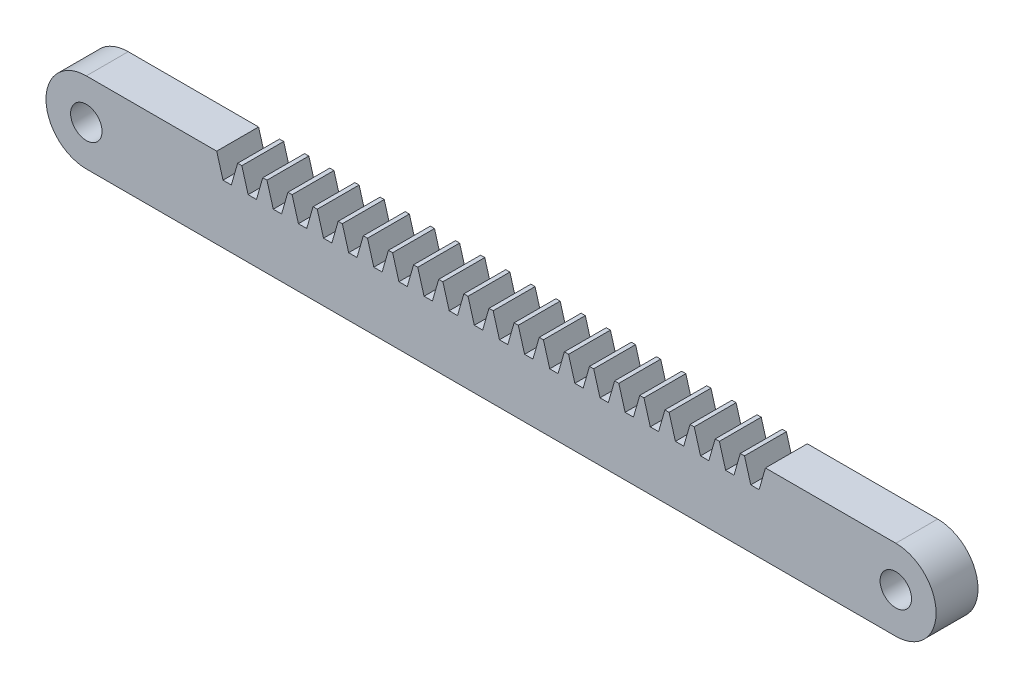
ISO-10303-21;
HEADER;
FILE_DESCRIPTION(('STEP AP214'),'2;1');
FILE_NAME('part.step','',(''),(''),'','','');
FILE_SCHEMA(('AUTOMOTIVE_DESIGN { 1 0 10303 214 1 1 1 1 }'));
ENDSEC;
DATA;
#1=APPLICATION_CONTEXT('core data for automotive mechanical design processes');
#2=APPLICATION_PROTOCOL_DEFINITION('international standard','automotive_design',2000,#1);
#3=PRODUCT_CONTEXT('',#1,'mechanical');
#4=PRODUCT('Part','Part','',(#3));
#5=PRODUCT_RELATED_PRODUCT_CATEGORY('part','',(#4));
#6=PRODUCT_DEFINITION_FORMATION('','',#4);
#7=PRODUCT_DEFINITION_CONTEXT('part definition',#1,'design');
#8=PRODUCT_DEFINITION('design','',#6,#7);
#9=PRODUCT_DEFINITION_SHAPE('','',#8);
#10=(LENGTH_UNIT() NAMED_UNIT(*) SI_UNIT(.MILLI.,.METRE.));
#11=(NAMED_UNIT(*) PLANE_ANGLE_UNIT() SI_UNIT($,.RADIAN.));
#12=(NAMED_UNIT(*) SI_UNIT($,.STERADIAN.) SOLID_ANGLE_UNIT());
#13=UNCERTAINTY_MEASURE_WITH_UNIT(LENGTH_MEASURE(1.E-05),#10,'distance_accuracy_value','');
#14=(GEOMETRIC_REPRESENTATION_CONTEXT(3) GLOBAL_UNCERTAINTY_ASSIGNED_CONTEXT((#13)) GLOBAL_UNIT_ASSIGNED_CONTEXT((#10,
#11,#12)) REPRESENTATION_CONTEXT('',''));
#15=CARTESIAN_POINT('',(0.,0.,0.));
#16=DIRECTION('',(0.,0.,1.));
#17=DIRECTION('',(1.,0.,0.));
#18=AXIS2_PLACEMENT_3D('',#15,#16,#17);
#19=CARTESIAN_POINT('',(-42.1179775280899,4.9,0.764044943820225));
#20=DIRECTION('',(0.,0.,-1.));
#21=DIRECTION('',(-1.,0.,0.));
#22=AXIS2_PLACEMENT_3D('',#19,#20,#21);
#23=PLANE('',#22);
#24=CARTESIAN_POINT('',(39.0320224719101,3.15,0.764044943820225));
#25=DIRECTION('',(0.,0.,-1.));
#26=DIRECTION('',(-1.,0.,0.));
#27=AXIS2_PLACEMENT_3D('',#24,#25,#26);
#28=CIRCLE('',#27,1.5);
#29=CARTESIAN_POINT('',(37.5320224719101,3.15,0.764044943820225));
#30=VERTEX_POINT('',#29);
#31=EDGE_CURVE('E679',#30,#30,#28,.F.);
#32=ORIENTED_EDGE('',*,*,#31,.F.);
#33=EDGE_LOOP('',(#32));
#34=FACE_BOUND('',#33,.T.);
#35=CARTESIAN_POINT('',(-38.2679775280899,3.15,0.764044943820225));
#36=DIRECTION('',(0.,0.,-1.));
#37=DIRECTION('',(-1.,0.,0.));
#38=AXIS2_PLACEMENT_3D('',#35,#36,#37);
#39=CIRCLE('',#38,1.5);
#40=CARTESIAN_POINT('',(-39.7679775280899,3.15,0.764044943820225));
#41=VERTEX_POINT('',#40);
#42=EDGE_CURVE('E682',#41,#41,#39,.T.);
#43=ORIENTED_EDGE('',*,*,#42,.T.);
#44=EDGE_LOOP('',(#43));
#45=FACE_BOUND('',#44,.T.);
#46=CARTESIAN_POINT('',(-38.2679775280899,3.15,0.764044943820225));
#47=DIRECTION('',(0.,0.,-1.));
#48=DIRECTION('',(-1.,0.,0.));
#49=AXIS2_PLACEMENT_3D('',#46,#47,#48);
#50=CIRCLE('',#49,3.85);
#51=CARTESIAN_POINT('',(-38.2679775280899,-0.7,0.764044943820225));
#52=VERTEX_POINT('',#51);
#53=CARTESIAN_POINT('',(-38.2679775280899,7.00000000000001,0.764044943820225));
#54=VERTEX_POINT('',#53);
#55=EDGE_CURVE('E102',#52,#54,#50,.T.);
#56=ORIENTED_EDGE('',*,*,#55,.F.);
#57=DIRECTION('',(1.,0.,0.));
#58=VECTOR('',#57,1.);
#59=CARTESIAN_POINT('',(0.,-0.7,0.764044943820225));
#60=LINE('',#59,#58);
#61=CARTESIAN_POINT('',(39.0320224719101,-0.7,0.764044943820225));
#62=VERTEX_POINT('',#61);
#63=EDGE_CURVE('E109',#52,#62,#60,.T.);
#64=ORIENTED_EDGE('',*,*,#63,.T.);
#65=CARTESIAN_POINT('',(39.0320224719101,3.15,0.764044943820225));
#66=DIRECTION('',(0.,0.,-1.));
#67=DIRECTION('',(-1.,0.,0.));
#68=AXIS2_PLACEMENT_3D('',#65,#66,#67);
#69=CIRCLE('',#68,3.85);
#70=CARTESIAN_POINT('',(39.0320224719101,7.00000000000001,0.764044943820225));
#71=VERTEX_POINT('',#70);
#72=EDGE_CURVE('E661',#62,#71,#69,.F.);
#73=ORIENTED_EDGE('',*,*,#72,.T.);
#74=DIRECTION('',(1.,0.,0.));
#75=VECTOR('',#74,1.);
#76=CARTESIAN_POINT('',(26.4,7.00000000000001,0.764044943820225));
#77=LINE('',#76,#75);
#78=CARTESIAN_POINT('',(26.5820224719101,7.00000000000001,0.764044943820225));
#79=VERTEX_POINT('',#78);
#80=EDGE_CURVE('E674',#79,#71,#77,.T.);
#81=ORIENTED_EDGE('',*,*,#80,.F.);
#82=DIRECTION('',(-0.275637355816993,-0.961261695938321,0.));
#83=VECTOR('',#82,1.);
#84=CARTESIAN_POINT('',(24.7134757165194,0.483603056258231,0.764044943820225));
#85=LINE('',#84,#83);
#86=CARTESIAN_POINT('',(25.9798571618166,4.9,0.764044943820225));
#87=VERTEX_POINT('',#86);
#88=EDGE_CURVE('E677',#79,#87,#85,.T.);
#89=ORIENTED_EDGE('',*,*,#88,.T.);
#90=DIRECTION('',(1.,0.,0.));
#91=VECTOR('',#90,1.);
#92=CARTESIAN_POINT('',(-42.1179775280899,4.9,0.764044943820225));
#93=LINE('',#92,#91);
#94=CARTESIAN_POINT('',(25.1841877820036,4.9,0.764044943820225));
#95=VERTEX_POINT('',#94);
#96=EDGE_CURVE('E1239',#95,#87,#93,.T.);
#97=ORIENTED_EDGE('',*,*,#96,.F.);
#98=DIRECTION('',(0.275637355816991,-0.961261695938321,0.));
#99=VECTOR('',#98,1.);
#100=CARTESIAN_POINT('',(26.392520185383,0.686044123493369,0.764044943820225));
#101=LINE('',#100,#99);
#102=CARTESIAN_POINT('',(24.5820224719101,7.00000000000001,0.764044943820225));
#103=VERTEX_POINT('',#102);
#104=EDGE_CURVE('E690',#103,#95,#101,.T.);
#105=ORIENTED_EDGE('',*,*,#104,.F.);
#106=DIRECTION('',(1.,0.,0.));
#107=VECTOR('',#106,1.);
#108=CARTESIAN_POINT('',(24.,7.00000000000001,0.764044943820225));
#109=LINE('',#108,#107);
#110=CARTESIAN_POINT('',(24.1820224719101,7.00000000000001,0.764044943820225));
#111=VERTEX_POINT('',#110);
#112=EDGE_CURVE('E707',#111,#103,#109,.T.);
#113=ORIENTED_EDGE('',*,*,#112,.F.);
#114=DIRECTION('',(-0.275637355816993,-0.961261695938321,0.));
#115=VECTOR('',#114,1.);
#116=CARTESIAN_POINT('',(22.3134757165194,0.483603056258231,0.764044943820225));
#117=LINE('',#116,#115);
#118=CARTESIAN_POINT('',(23.5798571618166,4.9,0.764044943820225));
#119=VERTEX_POINT('',#118);
#120=EDGE_CURVE('E710',#111,#119,#117,.T.);
#121=ORIENTED_EDGE('',*,*,#120,.T.);
#122=CARTESIAN_POINT('',(22.7841877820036,4.9,0.764044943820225));
#123=VERTEX_POINT('',#122);
#124=EDGE_CURVE('E1258',#123,#119,#93,.T.);
#125=ORIENTED_EDGE('',*,*,#124,.F.);
#126=DIRECTION('',(0.275637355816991,-0.961261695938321,0.));
#127=VECTOR('',#126,1.);
#128=CARTESIAN_POINT('',(23.992520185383,0.686044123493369,0.764044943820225));
#129=LINE('',#128,#127);
#130=CARTESIAN_POINT('',(22.1820224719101,7.00000000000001,0.764044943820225));
#131=VERTEX_POINT('',#130);
#132=EDGE_CURVE('E704',#131,#123,#129,.T.);
#133=ORIENTED_EDGE('',*,*,#132,.F.);
#134=DIRECTION('',(1.,0.,0.));
#135=VECTOR('',#134,1.);
#136=CARTESIAN_POINT('',(21.6,7.00000000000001,0.764044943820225));
#137=LINE('',#136,#135);
#138=CARTESIAN_POINT('',(21.7820224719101,7.00000000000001,0.764044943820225));
#139=VERTEX_POINT('',#138);
#140=EDGE_CURVE('E733',#139,#131,#137,.T.);
#141=ORIENTED_EDGE('',*,*,#140,.F.);
#142=DIRECTION('',(-0.275637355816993,-0.961261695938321,0.));
#143=VECTOR('',#142,1.);
#144=CARTESIAN_POINT('',(19.9134757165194,0.483603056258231,0.764044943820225));
#145=LINE('',#144,#143);
#146=CARTESIAN_POINT('',(21.1798571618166,4.9,0.764044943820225));
#147=VERTEX_POINT('',#146);
#148=EDGE_CURVE('E736',#139,#147,#145,.T.);
#149=ORIENTED_EDGE('',*,*,#148,.T.);
#150=CARTESIAN_POINT('',(20.3841877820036,4.9,0.764044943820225));
#151=VERTEX_POINT('',#150);
#152=EDGE_CURVE('E1263',#151,#147,#93,.T.);
#153=ORIENTED_EDGE('',*,*,#152,.F.);
#154=DIRECTION('',(0.275637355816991,-0.961261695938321,0.));
#155=VECTOR('',#154,1.);
#156=CARTESIAN_POINT('',(21.592520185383,0.686044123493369,0.764044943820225));
#157=LINE('',#156,#155);
#158=CARTESIAN_POINT('',(19.7820224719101,7.00000000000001,0.764044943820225));
#159=VERTEX_POINT('',#158);
#160=EDGE_CURVE('E730',#159,#151,#157,.T.);
#161=ORIENTED_EDGE('',*,*,#160,.F.);
#162=DIRECTION('',(1.,0.,0.));
#163=VECTOR('',#162,1.);
#164=CARTESIAN_POINT('',(19.2,7.00000000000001,0.764044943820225));
#165=LINE('',#164,#163);
#166=CARTESIAN_POINT('',(19.3820224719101,7.00000000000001,0.764044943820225));
#167=VERTEX_POINT('',#166);
#168=EDGE_CURVE('E759',#167,#159,#165,.T.);
#169=ORIENTED_EDGE('',*,*,#168,.F.);
#170=DIRECTION('',(-0.275637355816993,-0.961261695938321,0.));
#171=VECTOR('',#170,1.);
#172=CARTESIAN_POINT('',(17.5134757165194,0.483603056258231,0.764044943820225));
#173=LINE('',#172,#171);
#174=CARTESIAN_POINT('',(18.7798571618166,4.9,0.764044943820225));
#175=VERTEX_POINT('',#174);
#176=EDGE_CURVE('E762',#167,#175,#173,.T.);
#177=ORIENTED_EDGE('',*,*,#176,.T.);
#178=CARTESIAN_POINT('',(17.9841877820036,4.9,0.764044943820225));
#179=VERTEX_POINT('',#178);
#180=EDGE_CURVE('E2428',#179,#175,#93,.T.);
#181=ORIENTED_EDGE('',*,*,#180,.F.);
#182=DIRECTION('',(0.275637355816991,-0.961261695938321,0.));
#183=VECTOR('',#182,1.);
#184=CARTESIAN_POINT('',(19.192520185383,0.686044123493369,0.764044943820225));
#185=LINE('',#184,#183);
#186=CARTESIAN_POINT('',(17.3820224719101,7.00000000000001,0.764044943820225));
#187=VERTEX_POINT('',#186);
#188=EDGE_CURVE('E756',#187,#179,#185,.T.);
#189=ORIENTED_EDGE('',*,*,#188,.F.);
#190=DIRECTION('',(1.,0.,0.));
#191=VECTOR('',#190,1.);
#192=CARTESIAN_POINT('',(16.8,7.00000000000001,0.764044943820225));
#193=LINE('',#192,#191);
#194=CARTESIAN_POINT('',(16.9820224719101,7.00000000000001,0.764044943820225));
#195=VERTEX_POINT('',#194);
#196=EDGE_CURVE('E785',#195,#187,#193,.T.);
#197=ORIENTED_EDGE('',*,*,#196,.F.);
#198=DIRECTION('',(-0.275637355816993,-0.961261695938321,0.));
#199=VECTOR('',#198,1.);
#200=CARTESIAN_POINT('',(15.1134757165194,0.483603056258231,0.764044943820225));
#201=LINE('',#200,#199);
#202=CARTESIAN_POINT('',(16.3798571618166,4.9,0.764044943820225));
#203=VERTEX_POINT('',#202);
#204=EDGE_CURVE('E788',#195,#203,#201,.T.);
#205=ORIENTED_EDGE('',*,*,#204,.T.);
#206=CARTESIAN_POINT('',(15.5841877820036,4.9,0.764044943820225));
#207=VERTEX_POINT('',#206);
#208=EDGE_CURVE('E2429',#207,#203,#93,.T.);
#209=ORIENTED_EDGE('',*,*,#208,.F.);
#210=DIRECTION('',(0.275637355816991,-0.961261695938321,0.));
#211=VECTOR('',#210,1.);
#212=CARTESIAN_POINT('',(16.792520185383,0.686044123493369,0.764044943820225));
#213=LINE('',#212,#211);
#214=CARTESIAN_POINT('',(14.9820224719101,7.00000000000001,0.764044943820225));
#215=VERTEX_POINT('',#214);
#216=EDGE_CURVE('E782',#215,#207,#213,.T.);
#217=ORIENTED_EDGE('',*,*,#216,.F.);
#218=DIRECTION('',(1.,0.,0.));
#219=VECTOR('',#218,1.);
#220=CARTESIAN_POINT('',(14.4,7.00000000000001,0.764044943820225));
#221=LINE('',#220,#219);
#222=CARTESIAN_POINT('',(14.5820224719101,7.00000000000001,0.764044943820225));
#223=VERTEX_POINT('',#222);
#224=EDGE_CURVE('E811',#223,#215,#221,.T.);
#225=ORIENTED_EDGE('',*,*,#224,.F.);
#226=DIRECTION('',(-0.275637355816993,-0.961261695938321,0.));
#227=VECTOR('',#226,1.);
#228=CARTESIAN_POINT('',(12.7134757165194,0.483603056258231,0.764044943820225));
#229=LINE('',#228,#227);
#230=CARTESIAN_POINT('',(13.9798571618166,4.9,0.764044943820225));
#231=VERTEX_POINT('',#230);
#232=EDGE_CURVE('E814',#223,#231,#229,.T.);
#233=ORIENTED_EDGE('',*,*,#232,.T.);
#234=CARTESIAN_POINT('',(13.1841877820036,4.9,0.764044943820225));
#235=VERTEX_POINT('',#234);
#236=EDGE_CURVE('E2431',#235,#231,#93,.T.);
#237=ORIENTED_EDGE('',*,*,#236,.F.);
#238=DIRECTION('',(0.275637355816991,-0.961261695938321,0.));
#239=VECTOR('',#238,1.);
#240=CARTESIAN_POINT('',(14.392520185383,0.686044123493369,0.764044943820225));
#241=LINE('',#240,#239);
#242=CARTESIAN_POINT('',(12.5820224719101,7.00000000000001,0.764044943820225));
#243=VERTEX_POINT('',#242);
#244=EDGE_CURVE('E808',#243,#235,#241,.T.);
#245=ORIENTED_EDGE('',*,*,#244,.F.);
#246=DIRECTION('',(1.,0.,0.));
#247=VECTOR('',#246,1.);
#248=CARTESIAN_POINT('',(12.,7.00000000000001,0.764044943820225));
#249=LINE('',#248,#247);
#250=CARTESIAN_POINT('',(12.1820224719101,7.00000000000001,0.764044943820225));
#251=VERTEX_POINT('',#250);
#252=EDGE_CURVE('E837',#251,#243,#249,.T.);
#253=ORIENTED_EDGE('',*,*,#252,.F.);
#254=DIRECTION('',(-0.275637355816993,-0.961261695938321,0.));
#255=VECTOR('',#254,1.);
#256=CARTESIAN_POINT('',(10.3134757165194,0.483603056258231,0.764044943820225));
#257=LINE('',#256,#255);
#258=CARTESIAN_POINT('',(11.5798571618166,4.9,0.764044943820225));
#259=VERTEX_POINT('',#258);
#260=EDGE_CURVE('E840',#251,#259,#257,.T.);
#261=ORIENTED_EDGE('',*,*,#260,.T.);
#262=CARTESIAN_POINT('',(10.7841877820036,4.9,0.764044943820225));
#263=VERTEX_POINT('',#262);
#264=EDGE_CURVE('E2433',#263,#259,#93,.T.);
#265=ORIENTED_EDGE('',*,*,#264,.F.);
#266=DIRECTION('',(0.275637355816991,-0.961261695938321,0.));
#267=VECTOR('',#266,1.);
#268=CARTESIAN_POINT('',(11.992520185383,0.686044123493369,0.764044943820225));
#269=LINE('',#268,#267);
#270=CARTESIAN_POINT('',(10.1820224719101,7.00000000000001,0.764044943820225));
#271=VERTEX_POINT('',#270);
#272=EDGE_CURVE('E834',#271,#263,#269,.T.);
#273=ORIENTED_EDGE('',*,*,#272,.F.);
#274=DIRECTION('',(1.,0.,0.));
#275=VECTOR('',#274,1.);
#276=CARTESIAN_POINT('',(9.6,7.00000000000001,0.764044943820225));
#277=LINE('',#276,#275);
#278=CARTESIAN_POINT('',(9.7820224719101,7.00000000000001,0.764044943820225));
#279=VERTEX_POINT('',#278);
#280=EDGE_CURVE('E863',#279,#271,#277,.T.);
#281=ORIENTED_EDGE('',*,*,#280,.F.);
#282=DIRECTION('',(-0.275637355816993,-0.961261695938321,0.));
#283=VECTOR('',#282,1.);
#284=CARTESIAN_POINT('',(7.91347571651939,0.483603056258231,0.764044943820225));
#285=LINE('',#284,#283);
#286=CARTESIAN_POINT('',(9.17985716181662,4.9,0.764044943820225));
#287=VERTEX_POINT('',#286);
#288=EDGE_CURVE('E866',#279,#287,#285,.T.);
#289=ORIENTED_EDGE('',*,*,#288,.T.);
#290=CARTESIAN_POINT('',(8.38418778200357,4.9,0.764044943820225));
#291=VERTEX_POINT('',#290);
#292=EDGE_CURVE('E1275',#291,#287,#93,.T.);
#293=ORIENTED_EDGE('',*,*,#292,.F.);
#294=DIRECTION('',(0.275637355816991,-0.961261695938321,0.));
#295=VECTOR('',#294,1.);
#296=CARTESIAN_POINT('',(9.59252018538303,0.686044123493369,0.764044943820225));
#297=LINE('',#296,#295);
#298=CARTESIAN_POINT('',(7.7820224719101,7.00000000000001,0.764044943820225));
#299=VERTEX_POINT('',#298);
#300=EDGE_CURVE('E860',#299,#291,#297,.T.);
#301=ORIENTED_EDGE('',*,*,#300,.F.);
#302=DIRECTION('',(1.,0.,0.));
#303=VECTOR('',#302,1.);
#304=CARTESIAN_POINT('',(7.2,7.00000000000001,0.764044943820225));
#305=LINE('',#304,#303);
#306=CARTESIAN_POINT('',(7.3820224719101,7.00000000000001,0.764044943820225));
#307=VERTEX_POINT('',#306);
#308=EDGE_CURVE('E889',#307,#299,#305,.T.);
#309=ORIENTED_EDGE('',*,*,#308,.F.);
#310=DIRECTION('',(-0.275637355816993,-0.961261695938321,0.));
#311=VECTOR('',#310,1.);
#312=CARTESIAN_POINT('',(5.51347571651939,0.483603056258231,0.764044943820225));
#313=LINE('',#312,#311);
#314=CARTESIAN_POINT('',(6.77985716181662,4.9,0.764044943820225));
#315=VERTEX_POINT('',#314);
#316=EDGE_CURVE('E892',#307,#315,#313,.T.);
#317=ORIENTED_EDGE('',*,*,#316,.T.);
#318=CARTESIAN_POINT('',(5.98418778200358,4.9,0.764044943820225));
#319=VERTEX_POINT('',#318);
#320=EDGE_CURVE('E1270',#319,#315,#93,.T.);
#321=ORIENTED_EDGE('',*,*,#320,.F.);
#322=DIRECTION('',(0.275637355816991,-0.961261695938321,0.));
#323=VECTOR('',#322,1.);
#324=CARTESIAN_POINT('',(7.19252018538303,0.686044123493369,0.764044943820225));
#325=LINE('',#324,#323);
#326=CARTESIAN_POINT('',(5.3820224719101,7.00000000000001,0.764044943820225));
#327=VERTEX_POINT('',#326);
#328=EDGE_CURVE('E886',#327,#319,#325,.T.);
#329=ORIENTED_EDGE('',*,*,#328,.F.);
#330=DIRECTION('',(1.,0.,0.));
#331=VECTOR('',#330,1.);
#332=CARTESIAN_POINT('',(4.8,7.00000000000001,0.764044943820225));
#333=LINE('',#332,#331);
#334=CARTESIAN_POINT('',(4.9820224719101,7.00000000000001,0.764044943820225));
#335=VERTEX_POINT('',#334);
#336=EDGE_CURVE('E915',#335,#327,#333,.T.);
#337=ORIENTED_EDGE('',*,*,#336,.F.);
#338=DIRECTION('',(-0.275637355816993,-0.961261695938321,0.));
#339=VECTOR('',#338,1.);
#340=CARTESIAN_POINT('',(3.11347571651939,0.483603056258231,0.764044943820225));
#341=LINE('',#340,#339);
#342=CARTESIAN_POINT('',(4.37985716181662,4.9,0.764044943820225));
#343=VERTEX_POINT('',#342);
#344=EDGE_CURVE('E918',#335,#343,#341,.T.);
#345=ORIENTED_EDGE('',*,*,#344,.T.);
#346=CARTESIAN_POINT('',(3.58418778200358,4.9,0.764044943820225));
#347=VERTEX_POINT('',#346);
#348=EDGE_CURVE('E1265',#347,#343,#93,.T.);
#349=ORIENTED_EDGE('',*,*,#348,.F.);
#350=DIRECTION('',(0.275637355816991,-0.961261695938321,0.));
#351=VECTOR('',#350,1.);
#352=CARTESIAN_POINT('',(4.79252018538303,0.686044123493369,0.764044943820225));
#353=LINE('',#352,#351);
#354=CARTESIAN_POINT('',(2.9820224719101,7.00000000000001,0.764044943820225));
#355=VERTEX_POINT('',#354);
#356=EDGE_CURVE('E912',#355,#347,#353,.T.);
#357=ORIENTED_EDGE('',*,*,#356,.F.);
#358=DIRECTION('',(1.,0.,0.));
#359=VECTOR('',#358,1.);
#360=CARTESIAN_POINT('',(2.4,7.00000000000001,0.764044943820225));
#361=LINE('',#360,#359);
#362=CARTESIAN_POINT('',(2.5820224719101,7.00000000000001,0.764044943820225));
#363=VERTEX_POINT('',#362);
#364=EDGE_CURVE('E941',#363,#355,#361,.T.);
#365=ORIENTED_EDGE('',*,*,#364,.F.);
#366=DIRECTION('',(-0.275637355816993,-0.961261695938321,0.));
#367=VECTOR('',#366,1.);
#368=CARTESIAN_POINT('',(0.713475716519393,0.483603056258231,0.764044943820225));
#369=LINE('',#368,#367);
#370=CARTESIAN_POINT('',(1.97985716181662,4.9,0.764044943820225));
#371=VERTEX_POINT('',#370);
#372=EDGE_CURVE('E944',#363,#371,#369,.T.);
#373=ORIENTED_EDGE('',*,*,#372,.T.);
#374=CARTESIAN_POINT('',(1.18418778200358,4.9,0.764044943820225));
#375=VERTEX_POINT('',#374);
#376=EDGE_CURVE('E1259',#375,#371,#93,.T.);
#377=ORIENTED_EDGE('',*,*,#376,.F.);
#378=DIRECTION('',(0.275637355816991,-0.961261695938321,0.));
#379=VECTOR('',#378,1.);
#380=CARTESIAN_POINT('',(2.39252018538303,0.686044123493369,0.764044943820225));
#381=LINE('',#380,#379);
#382=CARTESIAN_POINT('',(0.582022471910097,7.00000000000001,0.764044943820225));
#383=VERTEX_POINT('',#382);
#384=EDGE_CURVE('E1213',#383,#375,#381,.T.);
#385=ORIENTED_EDGE('',*,*,#384,.F.);
#386=DIRECTION('',(1.,0.,0.));
#387=VECTOR('',#386,1.);
#388=CARTESIAN_POINT('',(0.,7.00000000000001,0.764044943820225));
#389=LINE('',#388,#387);
#390=CARTESIAN_POINT('',(0.182022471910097,7.00000000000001,0.764044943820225));
#391=VERTEX_POINT('',#390);
#392=EDGE_CURVE('E1241',#391,#383,#389,.T.);
#393=ORIENTED_EDGE('',*,*,#392,.F.);
#394=DIRECTION('',(-0.275637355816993,-0.961261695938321,0.));
#395=VECTOR('',#394,1.);
#396=CARTESIAN_POINT('',(-1.68652428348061,0.483603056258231,0.764044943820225));
#397=LINE('',#396,#395);
#398=CARTESIAN_POINT('',(-0.420142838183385,4.9,0.764044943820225));
#399=VERTEX_POINT('',#398);
#400=EDGE_CURVE('E1244',#391,#399,#397,.T.);
#401=ORIENTED_EDGE('',*,*,#400,.T.);
#402=CARTESIAN_POINT('',(-1.21581221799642,4.9,0.764044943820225));
#403=VERTEX_POINT('',#402);
#404=EDGE_CURVE('E1264',#403,#399,#93,.T.);
#405=ORIENTED_EDGE('',*,*,#404,.F.);
#406=DIRECTION('',(0.275637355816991,-0.961261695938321,0.));
#407=VECTOR('',#406,1.);
#408=CARTESIAN_POINT('',(-0.00747981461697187,0.686044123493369,0.764044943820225));
#409=LINE('',#408,#407);
#410=CARTESIAN_POINT('',(-1.8179775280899,7.00000000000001,0.764044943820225));
#411=VERTEX_POINT('',#410);
#412=EDGE_CURVE('E1187',#411,#403,#409,.T.);
#413=ORIENTED_EDGE('',*,*,#412,.F.);
#414=DIRECTION('',(1.,0.,0.));
#415=VECTOR('',#414,1.);
#416=CARTESIAN_POINT('',(-2.4,7.00000000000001,0.764044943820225));
#417=LINE('',#416,#415);
#418=CARTESIAN_POINT('',(-2.2179775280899,7.00000000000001,0.764044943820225));
#419=VERTEX_POINT('',#418);
#420=EDGE_CURVE('E1216',#419,#411,#417,.T.);
#421=ORIENTED_EDGE('',*,*,#420,.F.);
#422=DIRECTION('',(-0.275637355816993,-0.961261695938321,0.));
#423=VECTOR('',#422,1.);
#424=CARTESIAN_POINT('',(-4.08652428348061,0.483603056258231,0.764044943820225));
#425=LINE('',#424,#423);
#426=CARTESIAN_POINT('',(-2.82014283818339,4.9,0.764044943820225));
#427=VERTEX_POINT('',#426);
#428=EDGE_CURVE('E1219',#419,#427,#425,.T.);
#429=ORIENTED_EDGE('',*,*,#428,.T.);
#430=CARTESIAN_POINT('',(-3.61581221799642,4.9,0.764044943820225));
#431=VERTEX_POINT('',#430);
#432=EDGE_CURVE('E1269',#431,#427,#93,.T.);
#433=ORIENTED_EDGE('',*,*,#432,.F.);
#434=DIRECTION('',(0.275637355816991,-0.961261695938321,0.));
#435=VECTOR('',#434,1.);
#436=CARTESIAN_POINT('',(-2.40747981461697,0.686044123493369,0.764044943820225));
#437=LINE('',#436,#435);
#438=CARTESIAN_POINT('',(-4.2179775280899,7.00000000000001,0.764044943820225));
#439=VERTEX_POINT('',#438);
#440=EDGE_CURVE('E1161',#439,#431,#437,.T.);
#441=ORIENTED_EDGE('',*,*,#440,.F.);
#442=DIRECTION('',(1.,0.,0.));
#443=VECTOR('',#442,1.);
#444=CARTESIAN_POINT('',(-4.8,7.00000000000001,0.764044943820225));
#445=LINE('',#444,#443);
#446=CARTESIAN_POINT('',(-4.6179775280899,7.00000000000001,0.764044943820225));
#447=VERTEX_POINT('',#446);
#448=EDGE_CURVE('E1190',#447,#439,#445,.T.);
#449=ORIENTED_EDGE('',*,*,#448,.F.);
#450=DIRECTION('',(-0.275637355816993,-0.961261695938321,0.));
#451=VECTOR('',#450,1.);
#452=CARTESIAN_POINT('',(-6.48652428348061,0.483603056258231,0.764044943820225));
#453=LINE('',#452,#451);
#454=CARTESIAN_POINT('',(-5.22014283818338,4.9,0.764044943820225));
#455=VERTEX_POINT('',#454);
#456=EDGE_CURVE('E1193',#447,#455,#453,.T.);
#457=ORIENTED_EDGE('',*,*,#456,.T.);
#458=CARTESIAN_POINT('',(-6.01581221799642,4.9,0.764044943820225));
#459=VERTEX_POINT('',#458);
#460=EDGE_CURVE('E1307',#459,#455,#93,.T.);
#461=ORIENTED_EDGE('',*,*,#460,.F.);
#462=DIRECTION('',(0.275637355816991,-0.961261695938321,0.));
#463=VECTOR('',#462,1.);
#464=CARTESIAN_POINT('',(-4.80747981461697,0.686044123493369,0.764044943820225));
#465=LINE('',#464,#463);
#466=CARTESIAN_POINT('',(-6.6179775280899,7.00000000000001,0.764044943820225));
#467=VERTEX_POINT('',#466);
#468=EDGE_CURVE('E1135',#467,#459,#465,.T.);
#469=ORIENTED_EDGE('',*,*,#468,.F.);
#470=DIRECTION('',(1.,0.,0.));
#471=VECTOR('',#470,1.);
#472=CARTESIAN_POINT('',(-7.2,7.00000000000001,0.764044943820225));
#473=LINE('',#472,#471);
#474=CARTESIAN_POINT('',(-7.0179775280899,7.00000000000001,0.764044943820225));
#475=VERTEX_POINT('',#474);
#476=EDGE_CURVE('E1164',#475,#467,#473,.T.);
#477=ORIENTED_EDGE('',*,*,#476,.F.);
#478=DIRECTION('',(-0.275637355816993,-0.961261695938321,0.));
#479=VECTOR('',#478,1.);
#480=CARTESIAN_POINT('',(-8.88652428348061,0.483603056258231,0.764044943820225));
#481=LINE('',#480,#479);
#482=CARTESIAN_POINT('',(-7.62014283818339,4.9,0.764044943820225));
#483=VERTEX_POINT('',#482);
#484=EDGE_CURVE('E1167',#475,#483,#481,.T.);
#485=ORIENTED_EDGE('',*,*,#484,.T.);
#486=CARTESIAN_POINT('',(-8.41581221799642,4.9,0.764044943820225));
#487=VERTEX_POINT('',#486);
#488=EDGE_CURVE('E1303',#487,#483,#93,.T.);
#489=ORIENTED_EDGE('',*,*,#488,.F.);
#490=DIRECTION('',(0.275637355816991,-0.961261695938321,0.));
#491=VECTOR('',#490,1.);
#492=CARTESIAN_POINT('',(-7.20747981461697,0.686044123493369,0.764044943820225));
#493=LINE('',#492,#491);
#494=CARTESIAN_POINT('',(-9.0179775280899,7.00000000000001,0.764044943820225));
#495=VERTEX_POINT('',#494);
#496=EDGE_CURVE('E1109',#495,#487,#493,.T.);
#497=ORIENTED_EDGE('',*,*,#496,.F.);
#498=DIRECTION('',(1.,0.,0.));
#499=VECTOR('',#498,1.);
#500=CARTESIAN_POINT('',(-9.6,7.00000000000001,0.764044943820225));
#501=LINE('',#500,#499);
#502=CARTESIAN_POINT('',(-9.4179775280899,7.00000000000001,0.764044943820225));
#503=VERTEX_POINT('',#502);
#504=EDGE_CURVE('E1138',#503,#495,#501,.T.);
#505=ORIENTED_EDGE('',*,*,#504,.F.);
#506=DIRECTION('',(-0.275637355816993,-0.961261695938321,0.));
#507=VECTOR('',#506,1.);
#508=CARTESIAN_POINT('',(-11.2865242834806,0.483603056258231,0.764044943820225));
#509=LINE('',#508,#507);
#510=CARTESIAN_POINT('',(-10.0201428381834,4.9,0.764044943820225));
#511=VERTEX_POINT('',#510);
#512=EDGE_CURVE('E1141',#503,#511,#509,.T.);
#513=ORIENTED_EDGE('',*,*,#512,.T.);
#514=CARTESIAN_POINT('',(-10.8158122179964,4.9,0.764044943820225));
#515=VERTEX_POINT('',#514);
#516=EDGE_CURVE('E1299',#515,#511,#93,.T.);
#517=ORIENTED_EDGE('',*,*,#516,.F.);
#518=DIRECTION('',(0.275637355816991,-0.961261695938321,0.));
#519=VECTOR('',#518,1.);
#520=CARTESIAN_POINT('',(-9.60747981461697,0.686044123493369,0.764044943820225));
#521=LINE('',#520,#519);
#522=CARTESIAN_POINT('',(-11.4179775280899,7.00000000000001,0.764044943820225));
#523=VERTEX_POINT('',#522);
#524=EDGE_CURVE('E1083',#523,#515,#521,.T.);
#525=ORIENTED_EDGE('',*,*,#524,.F.);
#526=DIRECTION('',(1.,0.,0.));
#527=VECTOR('',#526,1.);
#528=CARTESIAN_POINT('',(-12.,7.00000000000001,0.764044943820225));
#529=LINE('',#528,#527);
#530=CARTESIAN_POINT('',(-11.8179775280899,7.00000000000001,0.764044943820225));
#531=VERTEX_POINT('',#530);
#532=EDGE_CURVE('E1112',#531,#523,#529,.T.);
#533=ORIENTED_EDGE('',*,*,#532,.F.);
#534=DIRECTION('',(-0.275637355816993,-0.961261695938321,0.));
#535=VECTOR('',#534,1.);
#536=CARTESIAN_POINT('',(-13.6865242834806,0.483603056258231,0.764044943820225));
#537=LINE('',#536,#535);
#538=CARTESIAN_POINT('',(-12.4201428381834,4.9,0.764044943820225));
#539=VERTEX_POINT('',#538);
#540=EDGE_CURVE('E1115',#531,#539,#537,.T.);
#541=ORIENTED_EDGE('',*,*,#540,.T.);
#542=CARTESIAN_POINT('',(-13.2158122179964,4.9,0.764044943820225));
#543=VERTEX_POINT('',#542);
#544=EDGE_CURVE('E1295',#543,#539,#93,.T.);
#545=ORIENTED_EDGE('',*,*,#544,.F.);
#546=DIRECTION('',(0.275637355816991,-0.961261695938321,0.));
#547=VECTOR('',#546,1.);
#548=CARTESIAN_POINT('',(-12.007479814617,0.686044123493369,0.764044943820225));
#549=LINE('',#548,#547);
#550=CARTESIAN_POINT('',(-13.8179775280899,7.00000000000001,0.764044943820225));
#551=VERTEX_POINT('',#550);
#552=EDGE_CURVE('E1057',#551,#543,#549,.T.);
#553=ORIENTED_EDGE('',*,*,#552,.F.);
#554=DIRECTION('',(1.,0.,0.));
#555=VECTOR('',#554,1.);
#556=CARTESIAN_POINT('',(-14.4,7.00000000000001,0.764044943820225));
#557=LINE('',#556,#555);
#558=CARTESIAN_POINT('',(-14.2179775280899,7.00000000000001,0.764044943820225));
#559=VERTEX_POINT('',#558);
#560=EDGE_CURVE('E1086',#559,#551,#557,.T.);
#561=ORIENTED_EDGE('',*,*,#560,.F.);
#562=DIRECTION('',(-0.275637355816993,-0.961261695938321,0.));
#563=VECTOR('',#562,1.);
#564=CARTESIAN_POINT('',(-16.0865242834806,0.483603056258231,0.764044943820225));
#565=LINE('',#564,#563);
#566=CARTESIAN_POINT('',(-14.8201428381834,4.9,0.764044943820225));
#567=VERTEX_POINT('',#566);
#568=EDGE_CURVE('E1089',#559,#567,#565,.T.);
#569=ORIENTED_EDGE('',*,*,#568,.T.);
#570=CARTESIAN_POINT('',(-15.6158122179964,4.9,0.764044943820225));
#571=VERTEX_POINT('',#570);
#572=EDGE_CURVE('E1291',#571,#567,#93,.T.);
#573=ORIENTED_EDGE('',*,*,#572,.F.);
#574=DIRECTION('',(0.275637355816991,-0.961261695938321,0.));
#575=VECTOR('',#574,1.);
#576=CARTESIAN_POINT('',(-14.407479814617,0.686044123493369,0.764044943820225));
#577=LINE('',#576,#575);
#578=CARTESIAN_POINT('',(-16.2179775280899,7.00000000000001,0.764044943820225));
#579=VERTEX_POINT('',#578);
#580=EDGE_CURVE('E1031',#579,#571,#577,.T.);
#581=ORIENTED_EDGE('',*,*,#580,.F.);
#582=DIRECTION('',(1.,0.,0.));
#583=VECTOR('',#582,1.);
#584=CARTESIAN_POINT('',(-16.8,7.00000000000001,0.764044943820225));
#585=LINE('',#584,#583);
#586=CARTESIAN_POINT('',(-16.6179775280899,7.00000000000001,0.764044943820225));
#587=VERTEX_POINT('',#586);
#588=EDGE_CURVE('E1060',#587,#579,#585,.T.);
#589=ORIENTED_EDGE('',*,*,#588,.F.);
#590=DIRECTION('',(-0.275637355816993,-0.961261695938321,0.));
#591=VECTOR('',#590,1.);
#592=CARTESIAN_POINT('',(-18.4865242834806,0.483603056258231,0.764044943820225));
#593=LINE('',#592,#591);
#594=CARTESIAN_POINT('',(-17.2201428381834,4.9,0.764044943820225));
#595=VERTEX_POINT('',#594);
#596=EDGE_CURVE('E1063',#587,#595,#593,.T.);
#597=ORIENTED_EDGE('',*,*,#596,.T.);
#598=CARTESIAN_POINT('',(-18.0158122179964,4.9,0.764044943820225));
#599=VERTEX_POINT('',#598);
#600=EDGE_CURVE('E1287',#599,#595,#93,.T.);
#601=ORIENTED_EDGE('',*,*,#600,.F.);
#602=DIRECTION('',(0.275637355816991,-0.961261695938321,0.));
#603=VECTOR('',#602,1.);
#604=CARTESIAN_POINT('',(-16.807479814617,0.686044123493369,0.764044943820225));
#605=LINE('',#604,#603);
#606=CARTESIAN_POINT('',(-18.6179775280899,7.00000000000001,0.764044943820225));
#607=VERTEX_POINT('',#606);
#608=EDGE_CURVE('E1005',#607,#599,#605,.T.);
#609=ORIENTED_EDGE('',*,*,#608,.F.);
#610=DIRECTION('',(1.,0.,0.));
#611=VECTOR('',#610,1.);
#612=CARTESIAN_POINT('',(-19.2,7.00000000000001,0.764044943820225));
#613=LINE('',#612,#611);
#614=CARTESIAN_POINT('',(-19.0179775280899,7.00000000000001,0.764044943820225));
#615=VERTEX_POINT('',#614);
#616=EDGE_CURVE('E1034',#615,#607,#613,.T.);
#617=ORIENTED_EDGE('',*,*,#616,.F.);
#618=DIRECTION('',(-0.275637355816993,-0.961261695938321,0.));
#619=VECTOR('',#618,1.);
#620=CARTESIAN_POINT('',(-20.8865242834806,0.483603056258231,0.764044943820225));
#621=LINE('',#620,#619);
#622=CARTESIAN_POINT('',(-19.6201428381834,4.9,0.764044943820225));
#623=VERTEX_POINT('',#622);
#624=EDGE_CURVE('E1037',#615,#623,#621,.T.);
#625=ORIENTED_EDGE('',*,*,#624,.T.);
#626=CARTESIAN_POINT('',(-20.4158122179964,4.9,0.764044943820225));
#627=VERTEX_POINT('',#626);
#628=EDGE_CURVE('E1283',#627,#623,#93,.T.);
#629=ORIENTED_EDGE('',*,*,#628,.F.);
#630=DIRECTION('',(0.275637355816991,-0.961261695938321,0.));
#631=VECTOR('',#630,1.);
#632=CARTESIAN_POINT('',(-19.207479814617,0.686044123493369,0.764044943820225));
#633=LINE('',#632,#631);
#634=CARTESIAN_POINT('',(-21.0179775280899,7.00000000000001,0.764044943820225));
#635=VERTEX_POINT('',#634);
#636=EDGE_CURVE('E979',#635,#627,#633,.T.);
#637=ORIENTED_EDGE('',*,*,#636,.F.);
#638=DIRECTION('',(1.,0.,0.));
#639=VECTOR('',#638,1.);
#640=CARTESIAN_POINT('',(-21.6,7.00000000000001,0.764044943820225));
#641=LINE('',#640,#639);
#642=CARTESIAN_POINT('',(-21.4179775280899,7.00000000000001,0.764044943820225));
#643=VERTEX_POINT('',#642);
#644=EDGE_CURVE('E1008',#643,#635,#641,.T.);
#645=ORIENTED_EDGE('',*,*,#644,.F.);
#646=DIRECTION('',(-0.275637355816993,-0.961261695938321,0.));
#647=VECTOR('',#646,1.);
#648=CARTESIAN_POINT('',(-23.2865242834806,0.483603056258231,0.764044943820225));
#649=LINE('',#648,#647);
#650=CARTESIAN_POINT('',(-22.0201428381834,4.9,0.764044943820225));
#651=VERTEX_POINT('',#650);
#652=EDGE_CURVE('E1011',#643,#651,#649,.T.);
#653=ORIENTED_EDGE('',*,*,#652,.T.);
#654=CARTESIAN_POINT('',(-22.8158122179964,4.9,0.764044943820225));
#655=VERTEX_POINT('',#654);
#656=EDGE_CURVE('E1277',#655,#651,#93,.T.);
#657=ORIENTED_EDGE('',*,*,#656,.F.);
#658=DIRECTION('',(0.275637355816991,-0.961261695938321,0.));
#659=VECTOR('',#658,1.);
#660=CARTESIAN_POINT('',(-21.607479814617,0.686044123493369,0.764044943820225));
#661=LINE('',#660,#659);
#662=CARTESIAN_POINT('',(-23.4179775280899,7.00000000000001,0.764044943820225));
#663=VERTEX_POINT('',#662);
#664=EDGE_CURVE('E960',#663,#655,#661,.T.);
#665=ORIENTED_EDGE('',*,*,#664,.F.);
#666=DIRECTION('',(1.,0.,0.));
#667=VECTOR('',#666,1.);
#668=CARTESIAN_POINT('',(-24.,7.00000000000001,0.764044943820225));
#669=LINE('',#668,#667);
#670=CARTESIAN_POINT('',(-23.8179775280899,7.00000000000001,0.764044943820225));
#671=VERTEX_POINT('',#670);
#672=EDGE_CURVE('E982',#671,#663,#669,.T.);
#673=ORIENTED_EDGE('',*,*,#672,.F.);
#674=DIRECTION('',(-0.275637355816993,-0.961261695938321,0.));
#675=VECTOR('',#674,1.);
#676=CARTESIAN_POINT('',(-25.6865242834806,0.483603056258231,0.764044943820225));
#677=LINE('',#676,#675);
#678=CARTESIAN_POINT('',(-24.4201428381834,4.9,0.764044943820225));
#679=VERTEX_POINT('',#678);
#680=EDGE_CURVE('E985',#671,#679,#677,.T.);
#681=ORIENTED_EDGE('',*,*,#680,.T.);
#682=CARTESIAN_POINT('',(-25.2158122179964,4.9,0.764044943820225));
#683=VERTEX_POINT('',#682);
#684=EDGE_CURVE('E1271',#683,#679,#93,.T.);
#685=ORIENTED_EDGE('',*,*,#684,.F.);
#686=DIRECTION('',(0.275637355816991,-0.961261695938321,0.));
#687=VECTOR('',#686,1.);
#688=CARTESIAN_POINT('',(-24.007479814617,0.686044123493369,0.764044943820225));
#689=LINE('',#688,#687);
#690=CARTESIAN_POINT('',(-25.8179775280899,7.00000000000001,0.764044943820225));
#691=VERTEX_POINT('',#690);
#692=EDGE_CURVE('E938',#691,#683,#689,.T.);
#693=ORIENTED_EDGE('',*,*,#692,.F.);
#694=DIRECTION('',(1.,0.,0.));
#695=VECTOR('',#694,1.);
#696=CARTESIAN_POINT('',(-26.4,7.00000000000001,0.764044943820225));
#697=LINE('',#696,#695);
#698=EDGE_CURVE('E964',#54,#691,#697,.T.);
#699=ORIENTED_EDGE('',*,*,#698,.F.);
#700=EDGE_LOOP('',(#56,#64,#73,#81,#89,#97,#105,#113,#121,#125,#133,#141,#149,#153,#161,#169,
#177,#181,#189,#197,#205,#209,#217,#225,#233,#237,#245,#253,#261,#265,#273,#281,#289,#293,#301,
#309,#317,#321,#329,#337,#345,#349,#357,#365,#373,#377,#385,#393,#401,#405,#413,#421,#429,#433,
#441,#449,#457,#461,#469,#477,#485,#489,#497,#505,#513,#517,#525,#533,#541,#545,#553,#561,#569,
#573,#581,#589,#597,#601,#609,#617,#625,#629,#637,#645,#653,#657,#665,#673,#681,#685,#693,#699));
#701=FACE_BOUND('',#700,.T.);
#702=ADVANCED_FACE('F87',(#34,#45,#701),#23,.F.);
#703=CARTESIAN_POINT('',(-42.1179775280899,4.9,-3.23595505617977));
#704=DIRECTION('',(0.,0.,1.));
#705=DIRECTION('',(1.,0.,0.));
#706=AXIS2_PLACEMENT_3D('',#703,#704,#705);
#707=PLANE('',#706);
#708=CARTESIAN_POINT('',(39.0320224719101,3.15,-3.23595505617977));
#709=DIRECTION('',(0.,0.,-1.));
#710=DIRECTION('',(-1.,0.,0.));
#711=AXIS2_PLACEMENT_3D('',#708,#709,#710);
#712=CIRCLE('',#711,1.5);
#713=CARTESIAN_POINT('',(37.5320224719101,3.15,-3.23595505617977));
#714=VERTEX_POINT('',#713);
#715=EDGE_CURVE('E1489',#714,#714,#712,.T.);
#716=ORIENTED_EDGE('',*,*,#715,.F.);
#717=EDGE_LOOP('',(#716));
#718=FACE_BOUND('',#717,.T.);
#719=CARTESIAN_POINT('',(-38.2679775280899,3.15,-3.23595505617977));
#720=DIRECTION('',(0.,0.,-1.));
#721=DIRECTION('',(-1.,0.,0.));
#722=AXIS2_PLACEMENT_3D('',#719,#720,#721);
#723=CIRCLE('',#722,1.5);
#724=CARTESIAN_POINT('',(-39.7679775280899,3.15,-3.23595505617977));
#725=VERTEX_POINT('',#724);
#726=EDGE_CURVE('E1490',#725,#725,#723,.F.);
#727=ORIENTED_EDGE('',*,*,#726,.T.);
#728=EDGE_LOOP('',(#727));
#729=FACE_BOUND('',#728,.T.);
#730=DIRECTION('',(-1.,0.,0.));
#731=VECTOR('',#730,1.);
#732=CARTESIAN_POINT('',(0.,-0.7,-3.23595505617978));
#733=LINE('',#732,#731);
#734=CARTESIAN_POINT('',(39.0320224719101,-0.7,-3.23595505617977));
#735=VERTEX_POINT('',#734);
#736=CARTESIAN_POINT('',(-38.2679775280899,-0.7,-3.23595505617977));
#737=VERTEX_POINT('',#736);
#738=EDGE_CURVE('E667',#735,#737,#733,.T.);
#739=ORIENTED_EDGE('',*,*,#738,.T.);
#740=CARTESIAN_POINT('',(-38.2679775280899,3.15,-3.23595505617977));
#741=DIRECTION('',(0.,0.,-1.));
#742=DIRECTION('',(-1.,0.,0.));
#743=AXIS2_PLACEMENT_3D('',#740,#741,#742);
#744=CIRCLE('',#743,3.85);
#745=CARTESIAN_POINT('',(-38.2679775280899,7.00000000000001,-3.23595505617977));
#746=VERTEX_POINT('',#745);
#747=EDGE_CURVE('E653',#746,#737,#744,.F.);
#748=ORIENTED_EDGE('',*,*,#747,.F.);
#749=DIRECTION('',(-1.,0.,0.));
#750=VECTOR('',#749,1.);
#751=CARTESIAN_POINT('',(-26.4,7.00000000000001,-3.23595505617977));
#752=LINE('',#751,#750);
#753=CARTESIAN_POINT('',(-25.8179775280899,7.00000000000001,-3.23595505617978));
#754=VERTEX_POINT('',#753);
#755=EDGE_CURVE('E958',#754,#746,#752,.T.);
#756=ORIENTED_EDGE('',*,*,#755,.F.);
#757=DIRECTION('',(-0.275637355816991,0.961261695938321,0.));
#758=VECTOR('',#757,1.);
#759=CARTESIAN_POINT('',(-24.007479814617,0.686044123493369,-3.23595505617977));
#760=LINE('',#759,#758);
#761=CARTESIAN_POINT('',(-25.2158122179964,4.9,-3.23595505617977));
#762=VERTEX_POINT('',#761);
#763=EDGE_CURVE('E961',#762,#754,#760,.T.);
#764=ORIENTED_EDGE('',*,*,#763,.F.);
#765=DIRECTION('',(-1.,0.,0.));
#766=VECTOR('',#765,1.);
#767=CARTESIAN_POINT('',(-42.1179775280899,4.9,-3.23595505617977));
#768=LINE('',#767,#766);
#769=CARTESIAN_POINT('',(-24.4201428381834,4.9,-3.23595505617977));
#770=VERTEX_POINT('',#769);
#771=EDGE_CURVE('E1276',#770,#762,#768,.T.);
#772=ORIENTED_EDGE('',*,*,#771,.F.);
#773=DIRECTION('',(0.275637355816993,0.961261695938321,0.));
#774=VECTOR('',#773,1.);
#775=CARTESIAN_POINT('',(-25.6865242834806,0.483603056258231,-3.23595505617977));
#776=LINE('',#775,#774);
#777=CARTESIAN_POINT('',(-23.8179775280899,7.00000000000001,-3.23595505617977));
#778=VERTEX_POINT('',#777);
#779=EDGE_CURVE('E976',#770,#778,#776,.T.);
#780=ORIENTED_EDGE('',*,*,#779,.T.);
#781=DIRECTION('',(-1.,0.,0.));
#782=VECTOR('',#781,1.);
#783=CARTESIAN_POINT('',(-24.,7.00000000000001,-3.23595505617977));
#784=LINE('',#783,#782);
#785=CARTESIAN_POINT('',(-23.4179775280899,7.00000000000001,-3.23595505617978));
#786=VERTEX_POINT('',#785);
#787=EDGE_CURVE('E973',#786,#778,#784,.T.);
#788=ORIENTED_EDGE('',*,*,#787,.F.);
#789=DIRECTION('',(-0.275637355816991,0.961261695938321,0.));
#790=VECTOR('',#789,1.);
#791=CARTESIAN_POINT('',(-21.607479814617,0.686044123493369,-3.23595505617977));
#792=LINE('',#791,#790);
#793=CARTESIAN_POINT('',(-22.8158122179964,4.9,-3.23595505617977));
#794=VERTEX_POINT('',#793);
#795=EDGE_CURVE('E977',#794,#786,#792,.T.);
#796=ORIENTED_EDGE('',*,*,#795,.F.);
#797=CARTESIAN_POINT('',(-22.0201428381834,4.9,-3.23595505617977));
#798=VERTEX_POINT('',#797);
#799=EDGE_CURVE('E1281',#798,#794,#768,.T.);
#800=ORIENTED_EDGE('',*,*,#799,.F.);
#801=DIRECTION('',(0.275637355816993,0.961261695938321,0.));
#802=VECTOR('',#801,1.);
#803=CARTESIAN_POINT('',(-23.2865242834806,0.483603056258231,-3.23595505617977));
#804=LINE('',#803,#802);
#805=CARTESIAN_POINT('',(-21.4179775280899,7.00000000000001,-3.23595505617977));
#806=VERTEX_POINT('',#805);
#807=EDGE_CURVE('E1002',#798,#806,#804,.T.);
#808=ORIENTED_EDGE('',*,*,#807,.T.);
#809=DIRECTION('',(-1.,0.,0.));
#810=VECTOR('',#809,1.);
#811=CARTESIAN_POINT('',(-21.6,7.00000000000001,-3.23595505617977));
#812=LINE('',#811,#810);
#813=CARTESIAN_POINT('',(-21.0179775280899,7.00000000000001,-3.23595505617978));
#814=VERTEX_POINT('',#813);
#815=EDGE_CURVE('E999',#814,#806,#812,.T.);
#816=ORIENTED_EDGE('',*,*,#815,.F.);
#817=DIRECTION('',(-0.275637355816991,0.961261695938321,0.));
#818=VECTOR('',#817,1.);
#819=CARTESIAN_POINT('',(-19.207479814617,0.686044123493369,-3.23595505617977));
#820=LINE('',#819,#818);
#821=CARTESIAN_POINT('',(-20.4158122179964,4.9,-3.23595505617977));
#822=VERTEX_POINT('',#821);
#823=EDGE_CURVE('E1003',#822,#814,#820,.T.);
#824=ORIENTED_EDGE('',*,*,#823,.F.);
#825=CARTESIAN_POINT('',(-19.6201428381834,4.9,-3.23595505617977));
#826=VERTEX_POINT('',#825);
#827=EDGE_CURVE('E1347',#826,#822,#768,.T.);
#828=ORIENTED_EDGE('',*,*,#827,.F.);
#829=DIRECTION('',(0.275637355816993,0.961261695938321,0.));
#830=VECTOR('',#829,1.);
#831=CARTESIAN_POINT('',(-20.8865242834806,0.483603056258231,-3.23595505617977));
#832=LINE('',#831,#830);
#833=CARTESIAN_POINT('',(-19.0179775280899,7.00000000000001,-3.23595505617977));
#834=VERTEX_POINT('',#833);
#835=EDGE_CURVE('E1028',#826,#834,#832,.T.);
#836=ORIENTED_EDGE('',*,*,#835,.T.);
#837=DIRECTION('',(-1.,0.,0.));
#838=VECTOR('',#837,1.);
#839=CARTESIAN_POINT('',(-19.2,7.00000000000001,-3.23595505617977));
#840=LINE('',#839,#838);
#841=CARTESIAN_POINT('',(-18.6179775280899,7.00000000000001,-3.23595505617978));
#842=VERTEX_POINT('',#841);
#843=EDGE_CURVE('E1025',#842,#834,#840,.T.);
#844=ORIENTED_EDGE('',*,*,#843,.F.);
#845=DIRECTION('',(-0.275637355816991,0.961261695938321,0.));
#846=VECTOR('',#845,1.);
#847=CARTESIAN_POINT('',(-16.807479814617,0.686044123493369,-3.23595505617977));
#848=LINE('',#847,#846);
#849=CARTESIAN_POINT('',(-18.0158122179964,4.9,-3.23595505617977));
#850=VERTEX_POINT('',#849);
#851=EDGE_CURVE('E1029',#850,#842,#848,.T.);
#852=ORIENTED_EDGE('',*,*,#851,.F.);
#853=CARTESIAN_POINT('',(-17.2201428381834,4.9,-3.23595505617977));
#854=VERTEX_POINT('',#853);
#855=EDGE_CURVE('E1345',#854,#850,#768,.T.);
#856=ORIENTED_EDGE('',*,*,#855,.F.);
#857=DIRECTION('',(0.275637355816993,0.961261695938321,0.));
#858=VECTOR('',#857,1.);
#859=CARTESIAN_POINT('',(-18.4865242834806,0.483603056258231,-3.23595505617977));
#860=LINE('',#859,#858);
#861=CARTESIAN_POINT('',(-16.6179775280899,7.00000000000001,-3.23595505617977));
#862=VERTEX_POINT('',#861);
#863=EDGE_CURVE('E1054',#854,#862,#860,.T.);
#864=ORIENTED_EDGE('',*,*,#863,.T.);
#865=DIRECTION('',(-1.,0.,0.));
#866=VECTOR('',#865,1.);
#867=CARTESIAN_POINT('',(-16.8,7.00000000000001,-3.23595505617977));
#868=LINE('',#867,#866);
#869=CARTESIAN_POINT('',(-16.2179775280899,7.00000000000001,-3.23595505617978));
#870=VERTEX_POINT('',#869);
#871=EDGE_CURVE('E1051',#870,#862,#868,.T.);
#872=ORIENTED_EDGE('',*,*,#871,.F.);
#873=DIRECTION('',(-0.275637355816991,0.961261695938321,0.));
#874=VECTOR('',#873,1.);
#875=CARTESIAN_POINT('',(-14.407479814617,0.686044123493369,-3.23595505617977));
#876=LINE('',#875,#874);
#877=CARTESIAN_POINT('',(-15.6158122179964,4.9,-3.23595505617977));
#878=VERTEX_POINT('',#877);
#879=EDGE_CURVE('E1055',#878,#870,#876,.T.);
#880=ORIENTED_EDGE('',*,*,#879,.F.);
#881=CARTESIAN_POINT('',(-14.8201428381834,4.9,-3.23595505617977));
#882=VERTEX_POINT('',#881);
#883=EDGE_CURVE('E1343',#882,#878,#768,.T.);
#884=ORIENTED_EDGE('',*,*,#883,.F.);
#885=DIRECTION('',(0.275637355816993,0.961261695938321,0.));
#886=VECTOR('',#885,1.);
#887=CARTESIAN_POINT('',(-16.0865242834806,0.483603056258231,-3.23595505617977));
#888=LINE('',#887,#886);
#889=CARTESIAN_POINT('',(-14.2179775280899,7.00000000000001,-3.23595505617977));
#890=VERTEX_POINT('',#889);
#891=EDGE_CURVE('E1080',#882,#890,#888,.T.);
#892=ORIENTED_EDGE('',*,*,#891,.T.);
#893=DIRECTION('',(-1.,0.,0.));
#894=VECTOR('',#893,1.);
#895=CARTESIAN_POINT('',(-14.4,7.00000000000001,-3.23595505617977));
#896=LINE('',#895,#894);
#897=CARTESIAN_POINT('',(-13.8179775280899,7.00000000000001,-3.23595505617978));
#898=VERTEX_POINT('',#897);
#899=EDGE_CURVE('E1077',#898,#890,#896,.T.);
#900=ORIENTED_EDGE('',*,*,#899,.F.);
#901=DIRECTION('',(-0.275637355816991,0.961261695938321,0.));
#902=VECTOR('',#901,1.);
#903=CARTESIAN_POINT('',(-12.007479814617,0.686044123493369,-3.23595505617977));
#904=LINE('',#903,#902);
#905=CARTESIAN_POINT('',(-13.2158122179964,4.9,-3.23595505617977));
#906=VERTEX_POINT('',#905);
#907=EDGE_CURVE('E1081',#906,#898,#904,.T.);
#908=ORIENTED_EDGE('',*,*,#907,.F.);
#909=CARTESIAN_POINT('',(-12.4201428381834,4.9,-3.23595505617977));
#910=VERTEX_POINT('',#909);
#911=EDGE_CURVE('E1341',#910,#906,#768,.T.);
#912=ORIENTED_EDGE('',*,*,#911,.F.);
#913=DIRECTION('',(0.275637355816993,0.961261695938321,0.));
#914=VECTOR('',#913,1.);
#915=CARTESIAN_POINT('',(-13.6865242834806,0.483603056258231,-3.23595505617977));
#916=LINE('',#915,#914);
#917=CARTESIAN_POINT('',(-11.8179775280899,7.00000000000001,-3.23595505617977));
#918=VERTEX_POINT('',#917);
#919=EDGE_CURVE('E1106',#910,#918,#916,.T.);
#920=ORIENTED_EDGE('',*,*,#919,.T.);
#921=DIRECTION('',(-1.,0.,0.));
#922=VECTOR('',#921,1.);
#923=CARTESIAN_POINT('',(-12.,7.00000000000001,-3.23595505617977));
#924=LINE('',#923,#922);
#925=CARTESIAN_POINT('',(-11.4179775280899,7.00000000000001,-3.23595505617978));
#926=VERTEX_POINT('',#925);
#927=EDGE_CURVE('E1103',#926,#918,#924,.T.);
#928=ORIENTED_EDGE('',*,*,#927,.F.);
#929=DIRECTION('',(-0.275637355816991,0.961261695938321,0.));
#930=VECTOR('',#929,1.);
#931=CARTESIAN_POINT('',(-9.60747981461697,0.686044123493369,-3.23595505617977));
#932=LINE('',#931,#930);
#933=CARTESIAN_POINT('',(-10.8158122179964,4.9,-3.23595505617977));
#934=VERTEX_POINT('',#933);
#935=EDGE_CURVE('E1107',#934,#926,#932,.T.);
#936=ORIENTED_EDGE('',*,*,#935,.F.);
#937=CARTESIAN_POINT('',(-10.0201428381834,4.9,-3.23595505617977));
#938=VERTEX_POINT('',#937);
#939=EDGE_CURVE('E1339',#938,#934,#768,.T.);
#940=ORIENTED_EDGE('',*,*,#939,.F.);
#941=DIRECTION('',(0.275637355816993,0.961261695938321,0.));
#942=VECTOR('',#941,1.);
#943=CARTESIAN_POINT('',(-11.2865242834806,0.483603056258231,-3.23595505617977));
#944=LINE('',#943,#942);
#945=CARTESIAN_POINT('',(-9.4179775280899,7.00000000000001,-3.23595505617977));
#946=VERTEX_POINT('',#945);
#947=EDGE_CURVE('E1132',#938,#946,#944,.T.);
#948=ORIENTED_EDGE('',*,*,#947,.T.);
#949=DIRECTION('',(-1.,0.,0.));
#950=VECTOR('',#949,1.);
#951=CARTESIAN_POINT('',(-9.6,7.00000000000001,-3.23595505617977));
#952=LINE('',#951,#950);
#953=CARTESIAN_POINT('',(-9.0179775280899,7.00000000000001,-3.23595505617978));
#954=VERTEX_POINT('',#953);
#955=EDGE_CURVE('E1129',#954,#946,#952,.T.);
#956=ORIENTED_EDGE('',*,*,#955,.F.);
#957=DIRECTION('',(-0.275637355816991,0.961261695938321,0.));
#958=VECTOR('',#957,1.);
#959=CARTESIAN_POINT('',(-7.20747981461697,0.686044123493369,-3.23595505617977));
#960=LINE('',#959,#958);
#961=CARTESIAN_POINT('',(-8.41581221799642,4.9,-3.23595505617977));
#962=VERTEX_POINT('',#961);
#963=EDGE_CURVE('E1133',#962,#954,#960,.T.);
#964=ORIENTED_EDGE('',*,*,#963,.F.);
#965=CARTESIAN_POINT('',(-7.62014283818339,4.9,-3.23595505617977));
#966=VERTEX_POINT('',#965);
#967=EDGE_CURVE('E1337',#966,#962,#768,.T.);
#968=ORIENTED_EDGE('',*,*,#967,.F.);
#969=DIRECTION('',(0.275637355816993,0.961261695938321,0.));
#970=VECTOR('',#969,1.);
#971=CARTESIAN_POINT('',(-8.88652428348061,0.483603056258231,-3.23595505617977));
#972=LINE('',#971,#970);
#973=CARTESIAN_POINT('',(-7.0179775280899,7.00000000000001,-3.23595505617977));
#974=VERTEX_POINT('',#973);
#975=EDGE_CURVE('E1158',#966,#974,#972,.T.);
#976=ORIENTED_EDGE('',*,*,#975,.T.);
#977=DIRECTION('',(-1.,0.,0.));
#978=VECTOR('',#977,1.);
#979=CARTESIAN_POINT('',(-7.2,7.00000000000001,-3.23595505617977));
#980=LINE('',#979,#978);
#981=CARTESIAN_POINT('',(-6.6179775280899,7.00000000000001,-3.23595505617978));
#982=VERTEX_POINT('',#981);
#983=EDGE_CURVE('E1155',#982,#974,#980,.T.);
#984=ORIENTED_EDGE('',*,*,#983,.F.);
#985=DIRECTION('',(-0.275637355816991,0.961261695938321,0.));
#986=VECTOR('',#985,1.);
#987=CARTESIAN_POINT('',(-4.80747981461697,0.686044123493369,-3.23595505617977));
#988=LINE('',#987,#986);
#989=CARTESIAN_POINT('',(-6.01581221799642,4.9,-3.23595505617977));
#990=VERTEX_POINT('',#989);
#991=EDGE_CURVE('E1159',#990,#982,#988,.T.);
#992=ORIENTED_EDGE('',*,*,#991,.F.);
#993=CARTESIAN_POINT('',(-5.22014283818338,4.9,-3.23595505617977));
#994=VERTEX_POINT('',#993);
#995=EDGE_CURVE('E1336',#994,#990,#768,.T.);
#996=ORIENTED_EDGE('',*,*,#995,.F.);
#997=DIRECTION('',(0.275637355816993,0.961261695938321,0.));
#998=VECTOR('',#997,1.);
#999=CARTESIAN_POINT('',(-6.48652428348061,0.483603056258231,-3.23595505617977));
#1000=LINE('',#999,#998);
#1001=CARTESIAN_POINT('',(-4.6179775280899,7.00000000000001,-3.23595505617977));
#1002=VERTEX_POINT('',#1001);
#1003=EDGE_CURVE('E1184',#994,#1002,#1000,.T.);
#1004=ORIENTED_EDGE('',*,*,#1003,.T.);
#1005=DIRECTION('',(-1.,0.,0.));
#1006=VECTOR('',#1005,1.);
#1007=CARTESIAN_POINT('',(-4.8,7.00000000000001,-3.23595505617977));
#1008=LINE('',#1007,#1006);
#1009=CARTESIAN_POINT('',(-4.2179775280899,7.00000000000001,-3.23595505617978));
#1010=VERTEX_POINT('',#1009);
#1011=EDGE_CURVE('E1181',#1010,#1002,#1008,.T.);
#1012=ORIENTED_EDGE('',*,*,#1011,.F.);
#1013=DIRECTION('',(-0.275637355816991,0.961261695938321,0.));
#1014=VECTOR('',#1013,1.);
#1015=CARTESIAN_POINT('',(-2.40747981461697,0.686044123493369,-3.23595505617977));
#1016=LINE('',#1015,#1014);
#1017=CARTESIAN_POINT('',(-3.61581221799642,4.9,-3.23595505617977));
#1018=VERTEX_POINT('',#1017);
#1019=EDGE_CURVE('E1185',#1018,#1010,#1016,.T.);
#1020=ORIENTED_EDGE('',*,*,#1019,.F.);
#1021=CARTESIAN_POINT('',(-2.82014283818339,4.9,-3.23595505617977));
#1022=VERTEX_POINT('',#1021);
#1023=EDGE_CURVE('E1335',#1022,#1018,#768,.T.);
#1024=ORIENTED_EDGE('',*,*,#1023,.F.);
#1025=DIRECTION('',(0.275637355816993,0.961261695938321,0.));
#1026=VECTOR('',#1025,1.);
#1027=CARTESIAN_POINT('',(-4.08652428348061,0.483603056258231,-3.23595505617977));
#1028=LINE('',#1027,#1026);
#1029=CARTESIAN_POINT('',(-2.2179775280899,7.00000000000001,-3.23595505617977));
#1030=VERTEX_POINT('',#1029);
#1031=EDGE_CURVE('E1210',#1022,#1030,#1028,.T.);
#1032=ORIENTED_EDGE('',*,*,#1031,.T.);
#1033=DIRECTION('',(-1.,0.,0.));
#1034=VECTOR('',#1033,1.);
#1035=CARTESIAN_POINT('',(-2.4,7.00000000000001,-3.23595505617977));
#1036=LINE('',#1035,#1034);
#1037=CARTESIAN_POINT('',(-1.8179775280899,7.00000000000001,-3.23595505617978));
#1038=VERTEX_POINT('',#1037);
#1039=EDGE_CURVE('E1207',#1038,#1030,#1036,.T.);
#1040=ORIENTED_EDGE('',*,*,#1039,.F.);
#1041=DIRECTION('',(-0.275637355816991,0.961261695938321,0.));
#1042=VECTOR('',#1041,1.);
#1043=CARTESIAN_POINT('',(-0.00747981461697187,0.686044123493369,-3.23595505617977));
#1044=LINE('',#1043,#1042);
#1045=CARTESIAN_POINT('',(-1.21581221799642,4.9,-3.23595505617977));
#1046=VERTEX_POINT('',#1045);
#1047=EDGE_CURVE('E1211',#1046,#1038,#1044,.T.);
#1048=ORIENTED_EDGE('',*,*,#1047,.F.);
#1049=CARTESIAN_POINT('',(-0.420142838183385,4.9,-3.23595505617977));
#1050=VERTEX_POINT('',#1049);
#1051=EDGE_CURVE('E95',#1050,#1046,#768,.T.);
#1052=ORIENTED_EDGE('',*,*,#1051,.F.);
#1053=DIRECTION('',(0.275637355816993,0.961261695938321,0.));
#1054=VECTOR('',#1053,1.);
#1055=CARTESIAN_POINT('',(-1.68652428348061,0.483603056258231,-3.23595505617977));
#1056=LINE('',#1055,#1054);
#1057=CARTESIAN_POINT('',(0.182022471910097,7.00000000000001,-3.23595505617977));
#1058=VERTEX_POINT('',#1057);
#1059=EDGE_CURVE('E1236',#1050,#1058,#1056,.T.);
#1060=ORIENTED_EDGE('',*,*,#1059,.T.);
#1061=DIRECTION('',(-1.,0.,0.));
#1062=VECTOR('',#1061,1.);
#1063=CARTESIAN_POINT('',(0.,7.00000000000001,-3.23595505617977));
#1064=LINE('',#1063,#1062);
#1065=CARTESIAN_POINT('',(0.582022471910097,7.00000000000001,-3.23595505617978));
#1066=VERTEX_POINT('',#1065);
#1067=EDGE_CURVE('E1233',#1066,#1058,#1064,.T.);
#1068=ORIENTED_EDGE('',*,*,#1067,.F.);
#1069=DIRECTION('',(-0.275637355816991,0.961261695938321,0.));
#1070=VECTOR('',#1069,1.);
#1071=CARTESIAN_POINT('',(2.39252018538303,0.686044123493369,-3.23595505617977));
#1072=LINE('',#1071,#1070);
#1073=CARTESIAN_POINT('',(1.18418778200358,4.9,-3.23595505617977));
#1074=VERTEX_POINT('',#1073);
#1075=EDGE_CURVE('E1237',#1074,#1066,#1072,.T.);
#1076=ORIENTED_EDGE('',*,*,#1075,.F.);
#1077=CARTESIAN_POINT('',(1.97985716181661,4.9,-3.23595505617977));
#1078=VERTEX_POINT('',#1077);
#1079=EDGE_CURVE('E1282',#1078,#1074,#768,.T.);
#1080=ORIENTED_EDGE('',*,*,#1079,.F.);
#1081=DIRECTION('',(0.275637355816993,0.961261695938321,0.));
#1082=VECTOR('',#1081,1.);
#1083=CARTESIAN_POINT('',(0.713475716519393,0.483603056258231,-3.23595505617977));
#1084=LINE('',#1083,#1082);
#1085=CARTESIAN_POINT('',(2.5820224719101,7.00000000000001,-3.23595505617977));
#1086=VERTEX_POINT('',#1085);
#1087=EDGE_CURVE('E935',#1078,#1086,#1084,.T.);
#1088=ORIENTED_EDGE('',*,*,#1087,.T.);
#1089=DIRECTION('',(-1.,0.,0.));
#1090=VECTOR('',#1089,1.);
#1091=CARTESIAN_POINT('',(2.4,7.00000000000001,-3.23595505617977));
#1092=LINE('',#1091,#1090);
#1093=CARTESIAN_POINT('',(2.9820224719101,7.00000000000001,-3.23595505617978));
#1094=VERTEX_POINT('',#1093);
#1095=EDGE_CURVE('E932',#1094,#1086,#1092,.T.);
#1096=ORIENTED_EDGE('',*,*,#1095,.F.);
#1097=DIRECTION('',(-0.275637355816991,0.961261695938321,0.));
#1098=VECTOR('',#1097,1.);
#1099=CARTESIAN_POINT('',(4.79252018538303,0.686044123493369,-3.23595505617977));
#1100=LINE('',#1099,#1098);
#1101=CARTESIAN_POINT('',(3.58418778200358,4.9,-3.23595505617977));
#1102=VERTEX_POINT('',#1101);
#1103=EDGE_CURVE('E936',#1102,#1094,#1100,.T.);
#1104=ORIENTED_EDGE('',*,*,#1103,.F.);
#1105=CARTESIAN_POINT('',(4.37985716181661,4.9,-3.23595505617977));
#1106=VERTEX_POINT('',#1105);
#1107=EDGE_CURVE('E2386',#1106,#1102,#768,.T.);
#1108=ORIENTED_EDGE('',*,*,#1107,.F.);
#1109=DIRECTION('',(0.275637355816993,0.961261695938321,0.));
#1110=VECTOR('',#1109,1.);
#1111=CARTESIAN_POINT('',(3.11347571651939,0.483603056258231,-3.23595505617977));
#1112=LINE('',#1111,#1110);
#1113=CARTESIAN_POINT('',(4.9820224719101,7.00000000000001,-3.23595505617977));
#1114=VERTEX_POINT('',#1113);
#1115=EDGE_CURVE('E909',#1106,#1114,#1112,.T.);
#1116=ORIENTED_EDGE('',*,*,#1115,.T.);
#1117=DIRECTION('',(-1.,0.,0.));
#1118=VECTOR('',#1117,1.);
#1119=CARTESIAN_POINT('',(4.8,7.00000000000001,-3.23595505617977));
#1120=LINE('',#1119,#1118);
#1121=CARTESIAN_POINT('',(5.3820224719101,7.00000000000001,-3.23595505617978));
#1122=VERTEX_POINT('',#1121);
#1123=EDGE_CURVE('E906',#1122,#1114,#1120,.T.);
#1124=ORIENTED_EDGE('',*,*,#1123,.F.);
#1125=DIRECTION('',(-0.275637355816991,0.961261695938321,0.));
#1126=VECTOR('',#1125,1.);
#1127=CARTESIAN_POINT('',(7.19252018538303,0.686044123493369,-3.23595505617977));
#1128=LINE('',#1127,#1126);
#1129=CARTESIAN_POINT('',(5.98418778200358,4.9,-3.23595505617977));
#1130=VERTEX_POINT('',#1129);
#1131=EDGE_CURVE('E910',#1130,#1122,#1128,.T.);
#1132=ORIENTED_EDGE('',*,*,#1131,.F.);
#1133=CARTESIAN_POINT('',(6.77985716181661,4.9,-3.23595505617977));
#1134=VERTEX_POINT('',#1133);
#1135=EDGE_CURVE('E2387',#1134,#1130,#768,.T.);
#1136=ORIENTED_EDGE('',*,*,#1135,.F.);
#1137=DIRECTION('',(0.275637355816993,0.961261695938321,0.));
#1138=VECTOR('',#1137,1.);
#1139=CARTESIAN_POINT('',(5.51347571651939,0.483603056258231,-3.23595505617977));
#1140=LINE('',#1139,#1138);
#1141=CARTESIAN_POINT('',(7.3820224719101,7.00000000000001,-3.23595505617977));
#1142=VERTEX_POINT('',#1141);
#1143=EDGE_CURVE('E883',#1134,#1142,#1140,.T.);
#1144=ORIENTED_EDGE('',*,*,#1143,.T.);
#1145=DIRECTION('',(-1.,0.,0.));
#1146=VECTOR('',#1145,1.);
#1147=CARTESIAN_POINT('',(7.2,7.00000000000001,-3.23595505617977));
#1148=LINE('',#1147,#1146);
#1149=CARTESIAN_POINT('',(7.7820224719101,7.00000000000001,-3.23595505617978));
#1150=VERTEX_POINT('',#1149);
#1151=EDGE_CURVE('E880',#1150,#1142,#1148,.T.);
#1152=ORIENTED_EDGE('',*,*,#1151,.F.);
#1153=DIRECTION('',(-0.275637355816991,0.961261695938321,0.));
#1154=VECTOR('',#1153,1.);
#1155=CARTESIAN_POINT('',(9.59252018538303,0.686044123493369,-3.23595505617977));
#1156=LINE('',#1155,#1154);
#1157=CARTESIAN_POINT('',(8.38418778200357,4.9,-3.23595505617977));
#1158=VERTEX_POINT('',#1157);
#1159=EDGE_CURVE('E884',#1158,#1150,#1156,.T.);
#1160=ORIENTED_EDGE('',*,*,#1159,.F.);
#1161=CARTESIAN_POINT('',(9.17985716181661,4.9,-3.23595505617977));
#1162=VERTEX_POINT('',#1161);
#1163=EDGE_CURVE('E2388',#1162,#1158,#768,.T.);
#1164=ORIENTED_EDGE('',*,*,#1163,.F.);
#1165=DIRECTION('',(0.275637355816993,0.961261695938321,0.));
#1166=VECTOR('',#1165,1.);
#1167=CARTESIAN_POINT('',(7.91347571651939,0.483603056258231,-3.23595505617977));
#1168=LINE('',#1167,#1166);
#1169=CARTESIAN_POINT('',(9.7820224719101,7.00000000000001,-3.23595505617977));
#1170=VERTEX_POINT('',#1169);
#1171=EDGE_CURVE('E857',#1162,#1170,#1168,.T.);
#1172=ORIENTED_EDGE('',*,*,#1171,.T.);
#1173=DIRECTION('',(-1.,0.,0.));
#1174=VECTOR('',#1173,1.);
#1175=CARTESIAN_POINT('',(9.6,7.00000000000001,-3.23595505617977));
#1176=LINE('',#1175,#1174);
#1177=CARTESIAN_POINT('',(10.1820224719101,7.00000000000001,-3.23595505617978));
#1178=VERTEX_POINT('',#1177);
#1179=EDGE_CURVE('E854',#1178,#1170,#1176,.T.);
#1180=ORIENTED_EDGE('',*,*,#1179,.F.);
#1181=DIRECTION('',(-0.275637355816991,0.961261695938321,0.));
#1182=VECTOR('',#1181,1.);
#1183=CARTESIAN_POINT('',(11.992520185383,0.686044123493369,-3.23595505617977));
#1184=LINE('',#1183,#1182);
#1185=CARTESIAN_POINT('',(10.7841877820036,4.9,-3.23595505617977));
#1186=VERTEX_POINT('',#1185);
#1187=EDGE_CURVE('E858',#1186,#1178,#1184,.T.);
#1188=ORIENTED_EDGE('',*,*,#1187,.F.);
#1189=CARTESIAN_POINT('',(11.5798571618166,4.9,-3.23595505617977));
#1190=VERTEX_POINT('',#1189);
#1191=EDGE_CURVE('E2391',#1190,#1186,#768,.T.);
#1192=ORIENTED_EDGE('',*,*,#1191,.F.);
#1193=DIRECTION('',(0.275637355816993,0.961261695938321,0.));
#1194=VECTOR('',#1193,1.);
#1195=CARTESIAN_POINT('',(10.3134757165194,0.483603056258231,-3.23595505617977));
#1196=LINE('',#1195,#1194);
#1197=CARTESIAN_POINT('',(12.1820224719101,7.00000000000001,-3.23595505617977));
#1198=VERTEX_POINT('',#1197);
#1199=EDGE_CURVE('E831',#1190,#1198,#1196,.T.);
#1200=ORIENTED_EDGE('',*,*,#1199,.T.);
#1201=DIRECTION('',(-1.,0.,0.));
#1202=VECTOR('',#1201,1.);
#1203=CARTESIAN_POINT('',(12.,7.00000000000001,-3.23595505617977));
#1204=LINE('',#1203,#1202);
#1205=CARTESIAN_POINT('',(12.5820224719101,7.00000000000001,-3.23595505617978));
#1206=VERTEX_POINT('',#1205);
#1207=EDGE_CURVE('E828',#1206,#1198,#1204,.T.);
#1208=ORIENTED_EDGE('',*,*,#1207,.F.);
#1209=DIRECTION('',(-0.275637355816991,0.961261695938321,0.));
#1210=VECTOR('',#1209,1.);
#1211=CARTESIAN_POINT('',(14.392520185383,0.686044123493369,-3.23595505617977));
#1212=LINE('',#1211,#1210);
#1213=CARTESIAN_POINT('',(13.1841877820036,4.9,-3.23595505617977));
#1214=VERTEX_POINT('',#1213);
#1215=EDGE_CURVE('E832',#1214,#1206,#1212,.T.);
#1216=ORIENTED_EDGE('',*,*,#1215,.F.);
#1217=CARTESIAN_POINT('',(13.9798571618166,4.9,-3.23595505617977));
#1218=VERTEX_POINT('',#1217);
#1219=EDGE_CURVE('E2394',#1218,#1214,#768,.T.);
#1220=ORIENTED_EDGE('',*,*,#1219,.F.);
#1221=DIRECTION('',(0.275637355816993,0.961261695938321,0.));
#1222=VECTOR('',#1221,1.);
#1223=CARTESIAN_POINT('',(12.7134757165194,0.483603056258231,-3.23595505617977));
#1224=LINE('',#1223,#1222);
#1225=CARTESIAN_POINT('',(14.5820224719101,7.00000000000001,-3.23595505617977));
#1226=VERTEX_POINT('',#1225);
#1227=EDGE_CURVE('E805',#1218,#1226,#1224,.T.);
#1228=ORIENTED_EDGE('',*,*,#1227,.T.);
#1229=DIRECTION('',(-1.,0.,0.));
#1230=VECTOR('',#1229,1.);
#1231=CARTESIAN_POINT('',(14.4,7.00000000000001,-3.23595505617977));
#1232=LINE('',#1231,#1230);
#1233=CARTESIAN_POINT('',(14.9820224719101,7.00000000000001,-3.23595505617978));
#1234=VERTEX_POINT('',#1233);
#1235=EDGE_CURVE('E802',#1234,#1226,#1232,.T.);
#1236=ORIENTED_EDGE('',*,*,#1235,.F.);
#1237=DIRECTION('',(-0.275637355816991,0.961261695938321,0.));
#1238=VECTOR('',#1237,1.);
#1239=CARTESIAN_POINT('',(16.792520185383,0.686044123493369,-3.23595505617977));
#1240=LINE('',#1239,#1238);
#1241=CARTESIAN_POINT('',(15.5841877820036,4.9,-3.23595505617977));
#1242=VERTEX_POINT('',#1241);
#1243=EDGE_CURVE('E806',#1242,#1234,#1240,.T.);
#1244=ORIENTED_EDGE('',*,*,#1243,.F.);
#1245=CARTESIAN_POINT('',(16.3798571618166,4.9,-3.23595505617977));
#1246=VERTEX_POINT('',#1245);
#1247=EDGE_CURVE('E2397',#1246,#1242,#768,.T.);
#1248=ORIENTED_EDGE('',*,*,#1247,.F.);
#1249=DIRECTION('',(0.275637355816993,0.961261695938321,0.));
#1250=VECTOR('',#1249,1.);
#1251=CARTESIAN_POINT('',(15.1134757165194,0.483603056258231,-3.23595505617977));
#1252=LINE('',#1251,#1250);
#1253=CARTESIAN_POINT('',(16.9820224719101,7.00000000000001,-3.23595505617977));
#1254=VERTEX_POINT('',#1253);
#1255=EDGE_CURVE('E779',#1246,#1254,#1252,.T.);
#1256=ORIENTED_EDGE('',*,*,#1255,.T.);
#1257=DIRECTION('',(-1.,0.,0.));
#1258=VECTOR('',#1257,1.);
#1259=CARTESIAN_POINT('',(16.8,7.00000000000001,-3.23595505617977));
#1260=LINE('',#1259,#1258);
#1261=CARTESIAN_POINT('',(17.3820224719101,7.00000000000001,-3.23595505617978));
#1262=VERTEX_POINT('',#1261);
#1263=EDGE_CURVE('E776',#1262,#1254,#1260,.T.);
#1264=ORIENTED_EDGE('',*,*,#1263,.F.);
#1265=DIRECTION('',(-0.275637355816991,0.961261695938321,0.));
#1266=VECTOR('',#1265,1.);
#1267=CARTESIAN_POINT('',(19.192520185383,0.686044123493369,-3.23595505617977));
#1268=LINE('',#1267,#1266);
#1269=CARTESIAN_POINT('',(17.9841877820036,4.9,-3.23595505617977));
#1270=VERTEX_POINT('',#1269);
#1271=EDGE_CURVE('E780',#1270,#1262,#1268,.T.);
#1272=ORIENTED_EDGE('',*,*,#1271,.F.);
#1273=CARTESIAN_POINT('',(18.7798571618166,4.9,-3.23595505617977));
#1274=VERTEX_POINT('',#1273);
#1275=EDGE_CURVE('E2400',#1274,#1270,#768,.T.);
#1276=ORIENTED_EDGE('',*,*,#1275,.F.);
#1277=DIRECTION('',(0.275637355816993,0.961261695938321,0.));
#1278=VECTOR('',#1277,1.);
#1279=CARTESIAN_POINT('',(17.5134757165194,0.483603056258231,-3.23595505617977));
#1280=LINE('',#1279,#1278);
#1281=CARTESIAN_POINT('',(19.3820224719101,7.00000000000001,-3.23595505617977));
#1282=VERTEX_POINT('',#1281);
#1283=EDGE_CURVE('E753',#1274,#1282,#1280,.T.);
#1284=ORIENTED_EDGE('',*,*,#1283,.T.);
#1285=DIRECTION('',(-1.,0.,0.));
#1286=VECTOR('',#1285,1.);
#1287=CARTESIAN_POINT('',(19.2,7.00000000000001,-3.23595505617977));
#1288=LINE('',#1287,#1286);
#1289=CARTESIAN_POINT('',(19.7820224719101,7.00000000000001,-3.23595505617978));
#1290=VERTEX_POINT('',#1289);
#1291=EDGE_CURVE('E750',#1290,#1282,#1288,.T.);
#1292=ORIENTED_EDGE('',*,*,#1291,.F.);
#1293=DIRECTION('',(-0.275637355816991,0.961261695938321,0.));
#1294=VECTOR('',#1293,1.);
#1295=CARTESIAN_POINT('',(21.592520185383,0.686044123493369,-3.23595505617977));
#1296=LINE('',#1295,#1294);
#1297=CARTESIAN_POINT('',(20.3841877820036,4.9,-3.23595505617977));
#1298=VERTEX_POINT('',#1297);
#1299=EDGE_CURVE('E754',#1298,#1290,#1296,.T.);
#1300=ORIENTED_EDGE('',*,*,#1299,.F.);
#1301=CARTESIAN_POINT('',(21.1798571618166,4.9,-3.23595505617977));
#1302=VERTEX_POINT('',#1301);
#1303=EDGE_CURVE('E2403',#1302,#1298,#768,.T.);
#1304=ORIENTED_EDGE('',*,*,#1303,.F.);
#1305=DIRECTION('',(0.275637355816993,0.961261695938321,0.));
#1306=VECTOR('',#1305,1.);
#1307=CARTESIAN_POINT('',(19.9134757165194,0.483603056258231,-3.23595505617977));
#1308=LINE('',#1307,#1306);
#1309=CARTESIAN_POINT('',(21.7820224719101,7.00000000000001,-3.23595505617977));
#1310=VERTEX_POINT('',#1309);
#1311=EDGE_CURVE('E727',#1302,#1310,#1308,.T.);
#1312=ORIENTED_EDGE('',*,*,#1311,.T.);
#1313=DIRECTION('',(-1.,0.,0.));
#1314=VECTOR('',#1313,1.);
#1315=CARTESIAN_POINT('',(21.6,7.00000000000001,-3.23595505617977));
#1316=LINE('',#1315,#1314);
#1317=CARTESIAN_POINT('',(22.1820224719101,7.00000000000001,-3.23595505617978));
#1318=VERTEX_POINT('',#1317);
#1319=EDGE_CURVE('E724',#1318,#1310,#1316,.T.);
#1320=ORIENTED_EDGE('',*,*,#1319,.F.);
#1321=DIRECTION('',(-0.275637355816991,0.961261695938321,0.));
#1322=VECTOR('',#1321,1.);
#1323=CARTESIAN_POINT('',(23.992520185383,0.686044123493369,-3.23595505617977));
#1324=LINE('',#1323,#1322);
#1325=CARTESIAN_POINT('',(22.7841877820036,4.9,-3.23595505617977));
#1326=VERTEX_POINT('',#1325);
#1327=EDGE_CURVE('E728',#1326,#1318,#1324,.T.);
#1328=ORIENTED_EDGE('',*,*,#1327,.F.);
#1329=CARTESIAN_POINT('',(23.5798571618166,4.9,-3.23595505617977));
#1330=VERTEX_POINT('',#1329);
#1331=EDGE_CURVE('E94',#1330,#1326,#768,.T.);
#1332=ORIENTED_EDGE('',*,*,#1331,.F.);
#1333=DIRECTION('',(0.275637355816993,0.961261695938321,0.));
#1334=VECTOR('',#1333,1.);
#1335=CARTESIAN_POINT('',(22.3134757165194,0.483603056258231,-3.23595505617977));
#1336=LINE('',#1335,#1334);
#1337=CARTESIAN_POINT('',(24.1820224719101,7.00000000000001,-3.23595505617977));
#1338=VERTEX_POINT('',#1337);
#1339=EDGE_CURVE('E701',#1330,#1338,#1336,.T.);
#1340=ORIENTED_EDGE('',*,*,#1339,.T.);
#1341=DIRECTION('',(-1.,0.,0.));
#1342=VECTOR('',#1341,1.);
#1343=CARTESIAN_POINT('',(24.,7.00000000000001,-3.23595505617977));
#1344=LINE('',#1343,#1342);
#1345=CARTESIAN_POINT('',(24.5820224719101,7.00000000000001,-3.23595505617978));
#1346=VERTEX_POINT('',#1345);
#1347=EDGE_CURVE('E698',#1346,#1338,#1344,.T.);
#1348=ORIENTED_EDGE('',*,*,#1347,.F.);
#1349=DIRECTION('',(-0.275637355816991,0.961261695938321,0.));
#1350=VECTOR('',#1349,1.);
#1351=CARTESIAN_POINT('',(26.392520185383,0.686044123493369,-3.23595505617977));
#1352=LINE('',#1351,#1350);
#1353=CARTESIAN_POINT('',(25.1841877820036,4.9,-3.23595505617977));
#1354=VERTEX_POINT('',#1353);
#1355=EDGE_CURVE('E702',#1354,#1346,#1352,.T.);
#1356=ORIENTED_EDGE('',*,*,#1355,.F.);
#1357=CARTESIAN_POINT('',(25.9798571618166,4.9,-3.23595505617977));
#1358=VERTEX_POINT('',#1357);
#1359=EDGE_CURVE('E12',#1358,#1354,#768,.T.);
#1360=ORIENTED_EDGE('',*,*,#1359,.F.);
#1361=DIRECTION('',(0.275637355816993,0.961261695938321,0.));
#1362=VECTOR('',#1361,1.);
#1363=CARTESIAN_POINT('',(24.7134757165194,0.483603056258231,-3.23595505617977));
#1364=LINE('',#1363,#1362);
#1365=CARTESIAN_POINT('',(26.5820224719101,7.00000000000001,-3.23595505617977));
#1366=VERTEX_POINT('',#1365);
#1367=EDGE_CURVE('E687',#1358,#1366,#1364,.T.);
#1368=ORIENTED_EDGE('',*,*,#1367,.T.);
#1369=DIRECTION('',(-1.,0.,0.));
#1370=VECTOR('',#1369,1.);
#1371=CARTESIAN_POINT('',(26.4,7.00000000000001,-3.23595505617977));
#1372=LINE('',#1371,#1370);
#1373=CARTESIAN_POINT('',(39.0320224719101,7.00000000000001,-3.23595505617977));
#1374=VERTEX_POINT('',#1373);
#1375=EDGE_CURVE('E685',#1374,#1366,#1372,.T.);
#1376=ORIENTED_EDGE('',*,*,#1375,.F.);
#1377=CARTESIAN_POINT('',(39.0320224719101,3.15,-3.23595505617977));
#1378=DIRECTION('',(0.,0.,-1.));
#1379=DIRECTION('',(-1.,0.,0.));
#1380=AXIS2_PLACEMENT_3D('',#1377,#1378,#1379);
#1381=CIRCLE('',#1380,3.85);
#1382=EDGE_CURVE('E668',#1374,#735,#1381,.T.);
#1383=ORIENTED_EDGE('',*,*,#1382,.T.);
#1384=EDGE_LOOP('',(#739,#748,#756,#764,#772,#780,#788,#796,#800,#808,#816,#824,#828,#836,#844,
#852,#856,#864,#872,#880,#884,#892,#900,#908,#912,#920,#928,#936,#940,#948,#956,#964,#968,#976,
#984,#992,#996,#1004,#1012,#1020,#1024,#1032,#1040,#1048,#1052,#1060,#1068,#1076,#1080,#1088,
#1096,#1104,#1108,#1116,#1124,#1132,#1136,#1144,#1152,#1160,#1164,#1172,#1180,#1188,#1192,#1200,
#1208,#1216,#1220,#1228,#1236,#1244,#1248,#1256,#1264,#1272,#1276,#1284,#1292,#1300,#1304,#1312,
#1320,#1328,#1332,#1340,#1348,#1356,#1360,#1368,#1376,#1383));
#1385=FACE_BOUND('',#1384,.T.);
#1386=ADVANCED_FACE('F672',(#718,#729,#1385),#707,.F.);
#1387=CARTESIAN_POINT('',(0.,4.9,0.));
#1388=DIRECTION('',(0.,1.,0.));
#1389=DIRECTION('',(0.,0.,1.));
#1390=AXIS2_PLACEMENT_3D('',#1387,#1388,#1389);
#1391=PLANE('',#1390);
#1392=DIRECTION('',(0.,0.,1.));
#1393=VECTOR('',#1392,1.);
#1394=CARTESIAN_POINT('',(25.9798571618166,4.9,-5.87865760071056));
#1395=LINE('',#1394,#1393);
#1396=EDGE_CURVE('E688',#1358,#87,#1395,.T.);
#1397=ORIENTED_EDGE('',*,*,#1396,.F.);
#1398=ORIENTED_EDGE('',*,*,#1359,.T.);
#1399=DIRECTION('',(0.,0.,1.));
#1400=VECTOR('',#1399,1.);
#1401=CARTESIAN_POINT('',(25.1841877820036,4.9,-5.87865760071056));
#1402=LINE('',#1401,#1400);
#1403=EDGE_CURVE('E713',#1354,#95,#1402,.T.);
#1404=ORIENTED_EDGE('',*,*,#1403,.T.);
#1405=ORIENTED_EDGE('',*,*,#96,.T.);
#1406=EDGE_LOOP('',(#1397,#1398,#1404,#1405));
#1407=FACE_BOUND('',#1406,.T.);
#1408=ADVANCED_FACE('F1481',(#1407),#1391,.T.);
#1409=DIRECTION('',(0.,0.,1.));
#1410=VECTOR('',#1409,1.);
#1411=CARTESIAN_POINT('',(23.5798571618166,4.9,-5.87865760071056));
#1412=LINE('',#1411,#1410);
#1413=EDGE_CURVE('E714',#1330,#119,#1412,.T.);
#1414=ORIENTED_EDGE('',*,*,#1413,.F.);
#1415=ORIENTED_EDGE('',*,*,#1331,.T.);
#1416=DIRECTION('',(0.,0.,1.));
#1417=VECTOR('',#1416,1.);
#1418=CARTESIAN_POINT('',(22.7841877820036,4.9,-5.87865760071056));
#1419=LINE('',#1418,#1417);
#1420=EDGE_CURVE('E739',#1326,#123,#1419,.T.);
#1421=ORIENTED_EDGE('',*,*,#1420,.T.);
#1422=ORIENTED_EDGE('',*,*,#124,.T.);
#1423=EDGE_LOOP('',(#1414,#1415,#1421,#1422));
#1424=FACE_BOUND('',#1423,.T.);
#1425=ADVANCED_FACE('F2014',(#1424),#1391,.T.);
#1426=DIRECTION('',(0.,0.,1.));
#1427=VECTOR('',#1426,1.);
#1428=CARTESIAN_POINT('',(21.1798571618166,4.9,-5.87865760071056));
#1429=LINE('',#1428,#1427);
#1430=EDGE_CURVE('E740',#1302,#147,#1429,.T.);
#1431=ORIENTED_EDGE('',*,*,#1430,.F.);
#1432=ORIENTED_EDGE('',*,*,#1303,.T.);
#1433=DIRECTION('',(0.,0.,1.));
#1434=VECTOR('',#1433,1.);
#1435=CARTESIAN_POINT('',(20.3841877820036,4.9,-5.87865760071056));
#1436=LINE('',#1435,#1434);
#1437=EDGE_CURVE('E765',#1298,#151,#1436,.T.);
#1438=ORIENTED_EDGE('',*,*,#1437,.T.);
#1439=ORIENTED_EDGE('',*,*,#152,.T.);
#1440=EDGE_LOOP('',(#1431,#1432,#1438,#1439));
#1441=FACE_BOUND('',#1440,.T.);
#1442=ADVANCED_FACE('F2022',(#1441),#1391,.T.);
#1443=DIRECTION('',(0.,0.,1.));
#1444=VECTOR('',#1443,1.);
#1445=CARTESIAN_POINT('',(18.7798571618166,4.9,-5.87865760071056));
#1446=LINE('',#1445,#1444);
#1447=EDGE_CURVE('E766',#1274,#175,#1446,.T.);
#1448=ORIENTED_EDGE('',*,*,#1447,.F.);
#1449=ORIENTED_EDGE('',*,*,#1275,.T.);
#1450=DIRECTION('',(0.,0.,1.));
#1451=VECTOR('',#1450,1.);
#1452=CARTESIAN_POINT('',(17.9841877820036,4.9,-5.87865760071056));
#1453=LINE('',#1452,#1451);
#1454=EDGE_CURVE('E791',#1270,#179,#1453,.T.);
#1455=ORIENTED_EDGE('',*,*,#1454,.T.);
#1456=ORIENTED_EDGE('',*,*,#180,.T.);
#1457=EDGE_LOOP('',(#1448,#1449,#1455,#1456));
#1458=FACE_BOUND('',#1457,.T.);
#1459=ADVANCED_FACE('F2029',(#1458),#1391,.T.);
#1460=DIRECTION('',(0.,0.,1.));
#1461=VECTOR('',#1460,1.);
#1462=CARTESIAN_POINT('',(16.3798571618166,4.9,-5.87865760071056));
#1463=LINE('',#1462,#1461);
#1464=EDGE_CURVE('E792',#1246,#203,#1463,.T.);
#1465=ORIENTED_EDGE('',*,*,#1464,.F.);
#1466=ORIENTED_EDGE('',*,*,#1247,.T.);
#1467=DIRECTION('',(0.,0.,1.));
#1468=VECTOR('',#1467,1.);
#1469=CARTESIAN_POINT('',(15.5841877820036,4.9,-5.87865760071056));
#1470=LINE('',#1469,#1468);
#1471=EDGE_CURVE('E817',#1242,#207,#1470,.T.);
#1472=ORIENTED_EDGE('',*,*,#1471,.T.);
#1473=ORIENTED_EDGE('',*,*,#208,.T.);
#1474=EDGE_LOOP('',(#1465,#1466,#1472,#1473));
#1475=FACE_BOUND('',#1474,.T.);
#1476=ADVANCED_FACE('F2036',(#1475),#1391,.T.);
#1477=DIRECTION('',(0.,0.,1.));
#1478=VECTOR('',#1477,1.);
#1479=CARTESIAN_POINT('',(13.9798571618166,4.9,-5.87865760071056));
#1480=LINE('',#1479,#1478);
#1481=EDGE_CURVE('E818',#1218,#231,#1480,.T.);
#1482=ORIENTED_EDGE('',*,*,#1481,.F.);
#1483=ORIENTED_EDGE('',*,*,#1219,.T.);
#1484=DIRECTION('',(0.,0.,1.));
#1485=VECTOR('',#1484,1.);
#1486=CARTESIAN_POINT('',(13.1841877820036,4.9,-5.87865760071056));
#1487=LINE('',#1486,#1485);
#1488=EDGE_CURVE('E843',#1214,#235,#1487,.T.);
#1489=ORIENTED_EDGE('',*,*,#1488,.T.);
#1490=ORIENTED_EDGE('',*,*,#236,.T.);
#1491=EDGE_LOOP('',(#1482,#1483,#1489,#1490));
#1492=FACE_BOUND('',#1491,.T.);
#1493=ADVANCED_FACE('F2043',(#1492),#1391,.T.);
#1494=DIRECTION('',(0.,0.,1.));
#1495=VECTOR('',#1494,1.);
#1496=CARTESIAN_POINT('',(11.5798571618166,4.9,-5.87865760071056));
#1497=LINE('',#1496,#1495);
#1498=EDGE_CURVE('E844',#1190,#259,#1497,.T.);
#1499=ORIENTED_EDGE('',*,*,#1498,.F.);
#1500=ORIENTED_EDGE('',*,*,#1191,.T.);
#1501=DIRECTION('',(0.,0.,1.));
#1502=VECTOR('',#1501,1.);
#1503=CARTESIAN_POINT('',(10.7841877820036,4.9,-5.87865760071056));
#1504=LINE('',#1503,#1502);
#1505=EDGE_CURVE('E869',#1186,#263,#1504,.T.);
#1506=ORIENTED_EDGE('',*,*,#1505,.T.);
#1507=ORIENTED_EDGE('',*,*,#264,.T.);
#1508=EDGE_LOOP('',(#1499,#1500,#1506,#1507));
#1509=FACE_BOUND('',#1508,.T.);
#1510=ADVANCED_FACE('F2050',(#1509),#1391,.T.);
#1511=DIRECTION('',(0.,0.,1.));
#1512=VECTOR('',#1511,1.);
#1513=CARTESIAN_POINT('',(9.17985716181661,4.9,-5.87865760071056));
#1514=LINE('',#1513,#1512);
#1515=EDGE_CURVE('E870',#1162,#287,#1514,.T.);
#1516=ORIENTED_EDGE('',*,*,#1515,.F.);
#1517=ORIENTED_EDGE('',*,*,#1163,.T.);
#1518=DIRECTION('',(0.,0.,1.));
#1519=VECTOR('',#1518,1.);
#1520=CARTESIAN_POINT('',(8.38418778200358,4.9,-5.87865760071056));
#1521=LINE('',#1520,#1519);
#1522=EDGE_CURVE('E895',#1158,#291,#1521,.T.);
#1523=ORIENTED_EDGE('',*,*,#1522,.T.);
#1524=ORIENTED_EDGE('',*,*,#292,.T.);
#1525=EDGE_LOOP('',(#1516,#1517,#1523,#1524));
#1526=FACE_BOUND('',#1525,.T.);
#1527=ADVANCED_FACE('F2057',(#1526),#1391,.T.);
#1528=DIRECTION('',(0.,0.,1.));
#1529=VECTOR('',#1528,1.);
#1530=CARTESIAN_POINT('',(6.77985716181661,4.9,-5.87865760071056));
#1531=LINE('',#1530,#1529);
#1532=EDGE_CURVE('E896',#1134,#315,#1531,.T.);
#1533=ORIENTED_EDGE('',*,*,#1532,.F.);
#1534=ORIENTED_EDGE('',*,*,#1135,.T.);
#1535=DIRECTION('',(0.,0.,1.));
#1536=VECTOR('',#1535,1.);
#1537=CARTESIAN_POINT('',(5.98418778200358,4.9,-5.87865760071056));
#1538=LINE('',#1537,#1536);
#1539=EDGE_CURVE('E921',#1130,#319,#1538,.T.);
#1540=ORIENTED_EDGE('',*,*,#1539,.T.);
#1541=ORIENTED_EDGE('',*,*,#320,.T.);
#1542=EDGE_LOOP('',(#1533,#1534,#1540,#1541));
#1543=FACE_BOUND('',#1542,.T.);
#1544=ADVANCED_FACE('F2064',(#1543),#1391,.T.);
#1545=DIRECTION('',(0.,0.,1.));
#1546=VECTOR('',#1545,1.);
#1547=CARTESIAN_POINT('',(4.37985716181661,4.9,-5.87865760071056));
#1548=LINE('',#1547,#1546);
#1549=EDGE_CURVE('E922',#1106,#343,#1548,.T.);
#1550=ORIENTED_EDGE('',*,*,#1549,.F.);
#1551=ORIENTED_EDGE('',*,*,#1107,.T.);
#1552=DIRECTION('',(0.,0.,1.));
#1553=VECTOR('',#1552,1.);
#1554=CARTESIAN_POINT('',(3.58418778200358,4.9,-5.87865760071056));
#1555=LINE('',#1554,#1553);
#1556=EDGE_CURVE('E947',#1102,#347,#1555,.T.);
#1557=ORIENTED_EDGE('',*,*,#1556,.T.);
#1558=ORIENTED_EDGE('',*,*,#348,.T.);
#1559=EDGE_LOOP('',(#1550,#1551,#1557,#1558));
#1560=FACE_BOUND('',#1559,.T.);
#1561=ADVANCED_FACE('F2071',(#1560),#1391,.T.);
#1562=ORIENTED_EDGE('',*,*,#771,.T.);
#1563=DIRECTION('',(0.,0.,1.));
#1564=VECTOR('',#1563,1.);
#1565=CARTESIAN_POINT('',(-25.2158122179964,4.9,-5.87865760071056));
#1566=LINE('',#1565,#1564);
#1567=EDGE_CURVE('E966',#762,#683,#1566,.T.);
#1568=ORIENTED_EDGE('',*,*,#1567,.T.);
#1569=ORIENTED_EDGE('',*,*,#684,.T.);
#1570=DIRECTION('',(0.,0.,1.));
#1571=VECTOR('',#1570,1.);
#1572=CARTESIAN_POINT('',(-24.4201428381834,4.9,-5.87865760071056));
#1573=LINE('',#1572,#1571);
#1574=EDGE_CURVE('E989',#770,#679,#1573,.T.);
#1575=ORIENTED_EDGE('',*,*,#1574,.F.);
#1576=EDGE_LOOP('',(#1562,#1568,#1569,#1575));
#1577=FACE_BOUND('',#1576,.T.);
#1578=ADVANCED_FACE('F2078',(#1577),#1391,.T.);
#1579=ORIENTED_EDGE('',*,*,#799,.T.);
#1580=DIRECTION('',(0.,0.,1.));
#1581=VECTOR('',#1580,1.);
#1582=CARTESIAN_POINT('',(-22.8158122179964,4.9,-5.87865760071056));
#1583=LINE('',#1582,#1581);
#1584=EDGE_CURVE('E988',#794,#655,#1583,.T.);
#1585=ORIENTED_EDGE('',*,*,#1584,.T.);
#1586=ORIENTED_EDGE('',*,*,#656,.T.);
#1587=DIRECTION('',(0.,0.,1.));
#1588=VECTOR('',#1587,1.);
#1589=CARTESIAN_POINT('',(-22.0201428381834,4.9,-5.87865760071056));
#1590=LINE('',#1589,#1588);
#1591=EDGE_CURVE('E1015',#798,#651,#1590,.T.);
#1592=ORIENTED_EDGE('',*,*,#1591,.F.);
#1593=EDGE_LOOP('',(#1579,#1585,#1586,#1592));
#1594=FACE_BOUND('',#1593,.T.);
#1595=ADVANCED_FACE('F1351',(#1594),#1391,.T.);
#1596=ORIENTED_EDGE('',*,*,#827,.T.);
#1597=DIRECTION('',(0.,0.,1.));
#1598=VECTOR('',#1597,1.);
#1599=CARTESIAN_POINT('',(-20.4158122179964,4.9,-5.87865760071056));
#1600=LINE('',#1599,#1598);
#1601=EDGE_CURVE('E1014',#822,#627,#1600,.T.);
#1602=ORIENTED_EDGE('',*,*,#1601,.T.);
#1603=ORIENTED_EDGE('',*,*,#628,.T.);
#1604=DIRECTION('',(0.,0.,1.));
#1605=VECTOR('',#1604,1.);
#1606=CARTESIAN_POINT('',(-19.6201428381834,4.9,-5.87865760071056));
#1607=LINE('',#1606,#1605);
#1608=EDGE_CURVE('E1041',#826,#623,#1607,.T.);
#1609=ORIENTED_EDGE('',*,*,#1608,.F.);
#1610=EDGE_LOOP('',(#1596,#1602,#1603,#1609));
#1611=FACE_BOUND('',#1610,.T.);
#1612=ADVANCED_FACE('F1372',(#1611),#1391,.T.);
#1613=ORIENTED_EDGE('',*,*,#855,.T.);
#1614=DIRECTION('',(0.,0.,1.));
#1615=VECTOR('',#1614,1.);
#1616=CARTESIAN_POINT('',(-18.0158122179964,4.9,-5.87865760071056));
#1617=LINE('',#1616,#1615);
#1618=EDGE_CURVE('E1040',#850,#599,#1617,.T.);
#1619=ORIENTED_EDGE('',*,*,#1618,.T.);
#1620=ORIENTED_EDGE('',*,*,#600,.T.);
#1621=DIRECTION('',(0.,0.,1.));
#1622=VECTOR('',#1621,1.);
#1623=CARTESIAN_POINT('',(-17.2201428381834,4.9,-5.87865760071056));
#1624=LINE('',#1623,#1622);
#1625=EDGE_CURVE('E1067',#854,#595,#1624,.T.);
#1626=ORIENTED_EDGE('',*,*,#1625,.F.);
#1627=EDGE_LOOP('',(#1613,#1619,#1620,#1626));
#1628=FACE_BOUND('',#1627,.T.);
#1629=ADVANCED_FACE('F1386',(#1628),#1391,.T.);
#1630=ORIENTED_EDGE('',*,*,#883,.T.);
#1631=DIRECTION('',(0.,0.,1.));
#1632=VECTOR('',#1631,1.);
#1633=CARTESIAN_POINT('',(-15.6158122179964,4.9,-5.87865760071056));
#1634=LINE('',#1633,#1632);
#1635=EDGE_CURVE('E1066',#878,#571,#1634,.T.);
#1636=ORIENTED_EDGE('',*,*,#1635,.T.);
#1637=ORIENTED_EDGE('',*,*,#572,.T.);
#1638=DIRECTION('',(0.,0.,1.));
#1639=VECTOR('',#1638,1.);
#1640=CARTESIAN_POINT('',(-14.8201428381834,4.9,-5.87865760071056));
#1641=LINE('',#1640,#1639);
#1642=EDGE_CURVE('E1093',#882,#567,#1641,.T.);
#1643=ORIENTED_EDGE('',*,*,#1642,.F.);
#1644=EDGE_LOOP('',(#1630,#1636,#1637,#1643));
#1645=FACE_BOUND('',#1644,.T.);
#1646=ADVANCED_FACE('F1400',(#1645),#1391,.T.);
#1647=ORIENTED_EDGE('',*,*,#911,.T.);
#1648=DIRECTION('',(0.,0.,1.));
#1649=VECTOR('',#1648,1.);
#1650=CARTESIAN_POINT('',(-13.2158122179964,4.9,-5.87865760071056));
#1651=LINE('',#1650,#1649);
#1652=EDGE_CURVE('E1092',#906,#543,#1651,.T.);
#1653=ORIENTED_EDGE('',*,*,#1652,.T.);
#1654=ORIENTED_EDGE('',*,*,#544,.T.);
#1655=DIRECTION('',(0.,0.,1.));
#1656=VECTOR('',#1655,1.);
#1657=CARTESIAN_POINT('',(-12.4201428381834,4.9,-5.87865760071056));
#1658=LINE('',#1657,#1656);
#1659=EDGE_CURVE('E1119',#910,#539,#1658,.T.);
#1660=ORIENTED_EDGE('',*,*,#1659,.F.);
#1661=EDGE_LOOP('',(#1647,#1653,#1654,#1660));
#1662=FACE_BOUND('',#1661,.T.);
#1663=ADVANCED_FACE('F1414',(#1662),#1391,.T.);
#1664=ORIENTED_EDGE('',*,*,#939,.T.);
#1665=DIRECTION('',(0.,0.,1.));
#1666=VECTOR('',#1665,1.);
#1667=CARTESIAN_POINT('',(-10.8158122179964,4.9,-5.87865760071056));
#1668=LINE('',#1667,#1666);
#1669=EDGE_CURVE('E1118',#934,#515,#1668,.T.);
#1670=ORIENTED_EDGE('',*,*,#1669,.T.);
#1671=ORIENTED_EDGE('',*,*,#516,.T.);
#1672=DIRECTION('',(0.,0.,1.));
#1673=VECTOR('',#1672,1.);
#1674=CARTESIAN_POINT('',(-10.0201428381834,4.9,-5.87865760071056));
#1675=LINE('',#1674,#1673);
#1676=EDGE_CURVE('E1145',#938,#511,#1675,.T.);
#1677=ORIENTED_EDGE('',*,*,#1676,.F.);
#1678=EDGE_LOOP('',(#1664,#1670,#1671,#1677));
#1679=FACE_BOUND('',#1678,.T.);
#1680=ADVANCED_FACE('F1428',(#1679),#1391,.T.);
#1681=ORIENTED_EDGE('',*,*,#967,.T.);
#1682=DIRECTION('',(0.,0.,1.));
#1683=VECTOR('',#1682,1.);
#1684=CARTESIAN_POINT('',(-8.41581221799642,4.9,-5.87865760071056));
#1685=LINE('',#1684,#1683);
#1686=EDGE_CURVE('E1144',#962,#487,#1685,.T.);
#1687=ORIENTED_EDGE('',*,*,#1686,.T.);
#1688=ORIENTED_EDGE('',*,*,#488,.T.);
#1689=DIRECTION('',(0.,0.,1.));
#1690=VECTOR('',#1689,1.);
#1691=CARTESIAN_POINT('',(-7.62014283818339,4.9,-5.87865760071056));
#1692=LINE('',#1691,#1690);
#1693=EDGE_CURVE('E1171',#966,#483,#1692,.T.);
#1694=ORIENTED_EDGE('',*,*,#1693,.F.);
#1695=EDGE_LOOP('',(#1681,#1687,#1688,#1694));
#1696=FACE_BOUND('',#1695,.T.);
#1697=ADVANCED_FACE('F1442',(#1696),#1391,.T.);
#1698=ORIENTED_EDGE('',*,*,#995,.T.);
#1699=DIRECTION('',(0.,0.,1.));
#1700=VECTOR('',#1699,1.);
#1701=CARTESIAN_POINT('',(-6.01581221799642,4.9,-5.87865760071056));
#1702=LINE('',#1701,#1700);
#1703=EDGE_CURVE('E1170',#990,#459,#1702,.T.);
#1704=ORIENTED_EDGE('',*,*,#1703,.T.);
#1705=ORIENTED_EDGE('',*,*,#460,.T.);
#1706=DIRECTION('',(0.,0.,1.));
#1707=VECTOR('',#1706,1.);
#1708=CARTESIAN_POINT('',(-5.22014283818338,4.9,-5.87865760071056));
#1709=LINE('',#1708,#1707);
#1710=EDGE_CURVE('E1197',#994,#455,#1709,.T.);
#1711=ORIENTED_EDGE('',*,*,#1710,.F.);
#1712=EDGE_LOOP('',(#1698,#1704,#1705,#1711));
#1713=FACE_BOUND('',#1712,.T.);
#1714=ADVANCED_FACE('F1456',(#1713),#1391,.T.);
#1715=ORIENTED_EDGE('',*,*,#1023,.T.);
#1716=DIRECTION('',(0.,0.,1.));
#1717=VECTOR('',#1716,1.);
#1718=CARTESIAN_POINT('',(-3.61581221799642,4.9,-5.87865760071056));
#1719=LINE('',#1718,#1717);
#1720=EDGE_CURVE('E1196',#1018,#431,#1719,.T.);
#1721=ORIENTED_EDGE('',*,*,#1720,.T.);
#1722=ORIENTED_EDGE('',*,*,#432,.T.);
#1723=DIRECTION('',(0.,0.,1.));
#1724=VECTOR('',#1723,1.);
#1725=CARTESIAN_POINT('',(-2.82014283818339,4.9,-5.87865760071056));
#1726=LINE('',#1725,#1724);
#1727=EDGE_CURVE('E1223',#1022,#427,#1726,.T.);
#1728=ORIENTED_EDGE('',*,*,#1727,.F.);
#1729=EDGE_LOOP('',(#1715,#1721,#1722,#1728));
#1730=FACE_BOUND('',#1729,.T.);
#1731=ADVANCED_FACE('F1317',(#1730),#1391,.T.);
#1732=ORIENTED_EDGE('',*,*,#1051,.T.);
#1733=DIRECTION('',(0.,0.,1.));
#1734=VECTOR('',#1733,1.);
#1735=CARTESIAN_POINT('',(-1.21581221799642,4.9,-5.87865760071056));
#1736=LINE('',#1735,#1734);
#1737=EDGE_CURVE('E1222',#1046,#403,#1736,.T.);
#1738=ORIENTED_EDGE('',*,*,#1737,.T.);
#1739=ORIENTED_EDGE('',*,*,#404,.T.);
#1740=DIRECTION('',(0.,0.,1.));
#1741=VECTOR('',#1740,1.);
#1742=CARTESIAN_POINT('',(-0.420142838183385,4.9,-5.87865760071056));
#1743=LINE('',#1742,#1741);
#1744=EDGE_CURVE('E1248',#1050,#399,#1743,.T.);
#1745=ORIENTED_EDGE('',*,*,#1744,.F.);
#1746=EDGE_LOOP('',(#1732,#1738,#1739,#1745));
#1747=FACE_BOUND('',#1746,.T.);
#1748=ADVANCED_FACE('F2130',(#1747),#1391,.T.);
#1749=DIRECTION('',(0.,0.,1.));
#1750=VECTOR('',#1749,1.);
#1751=CARTESIAN_POINT('',(1.97985716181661,4.9,-5.87865760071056));
#1752=LINE('',#1751,#1750);
#1753=EDGE_CURVE('E948',#1078,#371,#1752,.T.);
#1754=ORIENTED_EDGE('',*,*,#1753,.F.);
#1755=ORIENTED_EDGE('',*,*,#1079,.T.);
#1756=DIRECTION('',(0.,0.,1.));
#1757=VECTOR('',#1756,1.);
#1758=CARTESIAN_POINT('',(1.18418778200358,4.9,-5.87865760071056));
#1759=LINE('',#1758,#1757);
#1760=EDGE_CURVE('E1247',#1074,#375,#1759,.T.);
#1761=ORIENTED_EDGE('',*,*,#1760,.T.);
#1762=ORIENTED_EDGE('',*,*,#376,.T.);
#1763=EDGE_LOOP('',(#1754,#1755,#1761,#1762));
#1764=FACE_BOUND('',#1763,.T.);
#1765=ADVANCED_FACE('F2016',(#1764),#1391,.T.);
#1766=CARTESIAN_POINT('',(2.39252018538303,0.686044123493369,-5.87865760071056));
#1767=DIRECTION('',(-0.961261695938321,-0.275637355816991,0.));
#1768=DIRECTION('',(0.275637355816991,-0.961261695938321,0.));
#1769=AXIS2_PLACEMENT_3D('',#1766,#1767,#1768);
#1770=PLANE('',#1769);
#1771=ORIENTED_EDGE('',*,*,#1760,.F.);
#1772=ORIENTED_EDGE('',*,*,#1075,.T.);
#1773=DIRECTION('',(0.,0.,1.));
#1774=VECTOR('',#1773,1.);
#1775=CARTESIAN_POINT('',(0.582022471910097,7.00000000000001,-5.87865760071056));
#1776=LINE('',#1775,#1774);
#1777=EDGE_CURVE('E1253',#1066,#383,#1776,.T.);
#1778=ORIENTED_EDGE('',*,*,#1777,.T.);
#1779=ORIENTED_EDGE('',*,*,#384,.T.);
#1780=EDGE_LOOP('',(#1771,#1772,#1778,#1779));
#1781=FACE_BOUND('',#1780,.T.);
#1782=ADVANCED_FACE('F2142',(#1781),#1770,.F.);
#1783=CARTESIAN_POINT('',(0.,7.00000000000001,-5.87865760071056));
#1784=DIRECTION('',(0.,-1.,0.));
#1785=DIRECTION('',(0.,0.,-1.));
#1786=AXIS2_PLACEMENT_3D('',#1783,#1784,#1785);
#1787=PLANE('',#1786);
#1788=ORIENTED_EDGE('',*,*,#1777,.F.);
#1789=ORIENTED_EDGE('',*,*,#1067,.T.);
#1790=DIRECTION('',(0.,0.,1.));
#1791=VECTOR('',#1790,1.);
#1792=CARTESIAN_POINT('',(0.182022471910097,7.00000000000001,-5.87865760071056));
#1793=LINE('',#1792,#1791);
#1794=EDGE_CURVE('E1251',#1058,#391,#1793,.T.);
#1795=ORIENTED_EDGE('',*,*,#1794,.T.);
#1796=ORIENTED_EDGE('',*,*,#392,.T.);
#1797=EDGE_LOOP('',(#1788,#1789,#1795,#1796));
#1798=FACE_BOUND('',#1797,.T.);
#1799=ADVANCED_FACE('F2148',(#1798),#1787,.F.);
#1800=CARTESIAN_POINT('',(-1.68652428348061,0.483603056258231,-5.87865760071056));
#1801=DIRECTION('',(-0.961261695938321,0.275637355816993,0.));
#1802=DIRECTION('',(-0.275637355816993,-0.961261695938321,0.));
#1803=AXIS2_PLACEMENT_3D('',#1800,#1801,#1802);
#1804=PLANE('',#1803);
#1805=ORIENTED_EDGE('',*,*,#1059,.F.);
#1806=ORIENTED_EDGE('',*,*,#1744,.T.);
#1807=ORIENTED_EDGE('',*,*,#400,.F.);
#1808=ORIENTED_EDGE('',*,*,#1794,.F.);
#1809=EDGE_LOOP('',(#1805,#1806,#1807,#1808));
#1810=FACE_BOUND('',#1809,.T.);
#1811=ADVANCED_FACE('F2156',(#1810),#1804,.T.);
#1812=CARTESIAN_POINT('',(-0.00747981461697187,0.686044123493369,-5.87865760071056));
#1813=DIRECTION('',(-0.961261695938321,-0.275637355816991,0.));
#1814=DIRECTION('',(0.275637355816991,-0.961261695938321,0.));
#1815=AXIS2_PLACEMENT_3D('',#1812,#1813,#1814);
#1816=PLANE('',#1815);
#1817=ORIENTED_EDGE('',*,*,#1737,.F.);
#1818=ORIENTED_EDGE('',*,*,#1047,.T.);
#1819=DIRECTION('',(0.,0.,1.));
#1820=VECTOR('',#1819,1.);
#1821=CARTESIAN_POINT('',(-1.8179775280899,7.00000000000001,-5.87865760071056));
#1822=LINE('',#1821,#1820);
#1823=EDGE_CURVE('E1228',#1038,#411,#1822,.T.);
#1824=ORIENTED_EDGE('',*,*,#1823,.T.);
#1825=ORIENTED_EDGE('',*,*,#412,.T.);
#1826=EDGE_LOOP('',(#1817,#1818,#1824,#1825));
#1827=FACE_BOUND('',#1826,.T.);
#1828=ADVANCED_FACE('F2163',(#1827),#1816,.F.);
#1829=CARTESIAN_POINT('',(-2.4,7.00000000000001,-5.87865760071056));
#1830=DIRECTION('',(0.,-1.,0.));
#1831=DIRECTION('',(0.,0.,-1.));
#1832=AXIS2_PLACEMENT_3D('',#1829,#1830,#1831);
#1833=PLANE('',#1832);
#1834=ORIENTED_EDGE('',*,*,#1823,.F.);
#1835=ORIENTED_EDGE('',*,*,#1039,.T.);
#1836=DIRECTION('',(0.,0.,1.));
#1837=VECTOR('',#1836,1.);
#1838=CARTESIAN_POINT('',(-2.2179775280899,7.00000000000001,-5.87865760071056));
#1839=LINE('',#1838,#1837);
#1840=EDGE_CURVE('E1226',#1030,#419,#1839,.T.);
#1841=ORIENTED_EDGE('',*,*,#1840,.T.);
#1842=ORIENTED_EDGE('',*,*,#420,.T.);
#1843=EDGE_LOOP('',(#1834,#1835,#1841,#1842));
#1844=FACE_BOUND('',#1843,.T.);
#1845=ADVANCED_FACE('F1330',(#1844),#1833,.F.);
#1846=CARTESIAN_POINT('',(-4.08652428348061,0.483603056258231,-5.87865760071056));
#1847=DIRECTION('',(-0.961261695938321,0.275637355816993,0.));
#1848=DIRECTION('',(-0.275637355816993,-0.961261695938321,0.));
#1849=AXIS2_PLACEMENT_3D('',#1846,#1847,#1848);
#1850=PLANE('',#1849);
#1851=ORIENTED_EDGE('',*,*,#1031,.F.);
#1852=ORIENTED_EDGE('',*,*,#1727,.T.);
#1853=ORIENTED_EDGE('',*,*,#428,.F.);
#1854=ORIENTED_EDGE('',*,*,#1840,.F.);
#1855=EDGE_LOOP('',(#1851,#1852,#1853,#1854));
#1856=FACE_BOUND('',#1855,.T.);
#1857=ADVANCED_FACE('F1323',(#1856),#1850,.T.);
#1858=CARTESIAN_POINT('',(-2.40747981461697,0.686044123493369,-5.87865760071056));
#1859=DIRECTION('',(-0.961261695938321,-0.275637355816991,0.));
#1860=DIRECTION('',(0.275637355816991,-0.961261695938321,0.));
#1861=AXIS2_PLACEMENT_3D('',#1858,#1859,#1860);
#1862=PLANE('',#1861);
#1863=ORIENTED_EDGE('',*,*,#1720,.F.);
#1864=ORIENTED_EDGE('',*,*,#1019,.T.);
#1865=DIRECTION('',(0.,0.,1.));
#1866=VECTOR('',#1865,1.);
#1867=CARTESIAN_POINT('',(-4.2179775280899,7.00000000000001,-5.87865760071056));
#1868=LINE('',#1867,#1866);
#1869=EDGE_CURVE('E1202',#1010,#439,#1868,.T.);
#1870=ORIENTED_EDGE('',*,*,#1869,.T.);
#1871=ORIENTED_EDGE('',*,*,#440,.T.);
#1872=EDGE_LOOP('',(#1863,#1864,#1870,#1871));
#1873=FACE_BOUND('',#1872,.T.);
#1874=ADVANCED_FACE('F1467',(#1873),#1862,.F.);
#1875=CARTESIAN_POINT('',(-4.8,7.00000000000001,-5.87865760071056));
#1876=DIRECTION('',(0.,-1.,0.));
#1877=DIRECTION('',(0.,0.,-1.));
#1878=AXIS2_PLACEMENT_3D('',#1875,#1876,#1877);
#1879=PLANE('',#1878);
#1880=ORIENTED_EDGE('',*,*,#1869,.F.);
#1881=ORIENTED_EDGE('',*,*,#1011,.T.);
#1882=DIRECTION('',(0.,0.,1.));
#1883=VECTOR('',#1882,1.);
#1884=CARTESIAN_POINT('',(-4.6179775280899,7.00000000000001,-5.87865760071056));
#1885=LINE('',#1884,#1883);
#1886=EDGE_CURVE('E1200',#1002,#447,#1885,.T.);
#1887=ORIENTED_EDGE('',*,*,#1886,.T.);
#1888=ORIENTED_EDGE('',*,*,#448,.T.);
#1889=EDGE_LOOP('',(#1880,#1881,#1887,#1888));
#1890=FACE_BOUND('',#1889,.T.);
#1891=ADVANCED_FACE('F1465',(#1890),#1879,.F.);
#1892=CARTESIAN_POINT('',(-6.48652428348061,0.483603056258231,-5.87865760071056));
#1893=DIRECTION('',(-0.961261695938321,0.275637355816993,0.));
#1894=DIRECTION('',(-0.275637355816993,-0.961261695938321,0.));
#1895=AXIS2_PLACEMENT_3D('',#1892,#1893,#1894);
#1896=PLANE('',#1895);
#1897=ORIENTED_EDGE('',*,*,#1003,.F.);
#1898=ORIENTED_EDGE('',*,*,#1710,.T.);
#1899=ORIENTED_EDGE('',*,*,#456,.F.);
#1900=ORIENTED_EDGE('',*,*,#1886,.F.);
#1901=EDGE_LOOP('',(#1897,#1898,#1899,#1900));
#1902=FACE_BOUND('',#1901,.T.);
#1903=ADVANCED_FACE('F1462',(#1902),#1896,.T.);
#1904=CARTESIAN_POINT('',(-4.80747981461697,0.686044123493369,-5.87865760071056));
#1905=DIRECTION('',(-0.961261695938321,-0.275637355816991,0.));
#1906=DIRECTION('',(0.275637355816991,-0.961261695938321,0.));
#1907=AXIS2_PLACEMENT_3D('',#1904,#1905,#1906);
#1908=PLANE('',#1907);
#1909=ORIENTED_EDGE('',*,*,#1703,.F.);
#1910=ORIENTED_EDGE('',*,*,#991,.T.);
#1911=DIRECTION('',(0.,0.,1.));
#1912=VECTOR('',#1911,1.);
#1913=CARTESIAN_POINT('',(-6.6179775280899,7.00000000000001,-5.87865760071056));
#1914=LINE('',#1913,#1912);
#1915=EDGE_CURVE('E1176',#982,#467,#1914,.T.);
#1916=ORIENTED_EDGE('',*,*,#1915,.T.);
#1917=ORIENTED_EDGE('',*,*,#468,.T.);
#1918=EDGE_LOOP('',(#1909,#1910,#1916,#1917));
#1919=FACE_BOUND('',#1918,.T.);
#1920=ADVANCED_FACE('F1455',(#1919),#1908,.F.);
#1921=CARTESIAN_POINT('',(-7.2,7.00000000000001,-5.87865760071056));
#1922=DIRECTION('',(0.,-1.,0.));
#1923=DIRECTION('',(0.,0.,-1.));
#1924=AXIS2_PLACEMENT_3D('',#1921,#1922,#1923);
#1925=PLANE('',#1924);
#1926=ORIENTED_EDGE('',*,*,#1915,.F.);
#1927=ORIENTED_EDGE('',*,*,#983,.T.);
#1928=DIRECTION('',(0.,0.,1.));
#1929=VECTOR('',#1928,1.);
#1930=CARTESIAN_POINT('',(-7.0179775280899,7.00000000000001,-5.87865760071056));
#1931=LINE('',#1930,#1929);
#1932=EDGE_CURVE('E1174',#974,#475,#1931,.T.);
#1933=ORIENTED_EDGE('',*,*,#1932,.T.);
#1934=ORIENTED_EDGE('',*,*,#476,.T.);
#1935=EDGE_LOOP('',(#1926,#1927,#1933,#1934));
#1936=FACE_BOUND('',#1935,.T.);
#1937=ADVANCED_FACE('F1453',(#1936),#1925,.F.);
#1938=CARTESIAN_POINT('',(-8.88652428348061,0.483603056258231,-5.87865760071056));
#1939=DIRECTION('',(-0.961261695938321,0.275637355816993,0.));
#1940=DIRECTION('',(-0.275637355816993,-0.961261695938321,0.));
#1941=AXIS2_PLACEMENT_3D('',#1938,#1939,#1940);
#1942=PLANE('',#1941);
#1943=ORIENTED_EDGE('',*,*,#975,.F.);
#1944=ORIENTED_EDGE('',*,*,#1693,.T.);
#1945=ORIENTED_EDGE('',*,*,#484,.F.);
#1946=ORIENTED_EDGE('',*,*,#1932,.F.);
#1947=EDGE_LOOP('',(#1943,#1944,#1945,#1946));
#1948=FACE_BOUND('',#1947,.T.);
#1949=ADVANCED_FACE('F1449',(#1948),#1942,.T.);
#1950=CARTESIAN_POINT('',(-7.20747981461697,0.686044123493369,-5.87865760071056));
#1951=DIRECTION('',(-0.961261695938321,-0.275637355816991,0.));
#1952=DIRECTION('',(0.275637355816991,-0.961261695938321,0.));
#1953=AXIS2_PLACEMENT_3D('',#1950,#1951,#1952);
#1954=PLANE('',#1953);
#1955=ORIENTED_EDGE('',*,*,#1686,.F.);
#1956=ORIENTED_EDGE('',*,*,#963,.T.);
#1957=DIRECTION('',(0.,0.,1.));
#1958=VECTOR('',#1957,1.);
#1959=CARTESIAN_POINT('',(-9.0179775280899,7.00000000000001,-5.87865760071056));
#1960=LINE('',#1959,#1958);
#1961=EDGE_CURVE('E1150',#954,#495,#1960,.T.);
#1962=ORIENTED_EDGE('',*,*,#1961,.T.);
#1963=ORIENTED_EDGE('',*,*,#496,.T.);
#1964=EDGE_LOOP('',(#1955,#1956,#1962,#1963));
#1965=FACE_BOUND('',#1964,.T.);
#1966=ADVANCED_FACE('F1441',(#1965),#1954,.F.);
#1967=CARTESIAN_POINT('',(-9.6,7.00000000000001,-5.87865760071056));
#1968=DIRECTION('',(0.,-1.,0.));
#1969=DIRECTION('',(0.,0.,-1.));
#1970=AXIS2_PLACEMENT_3D('',#1967,#1968,#1969);
#1971=PLANE('',#1970);
#1972=ORIENTED_EDGE('',*,*,#1961,.F.);
#1973=ORIENTED_EDGE('',*,*,#955,.T.);
#1974=DIRECTION('',(0.,0.,1.));
#1975=VECTOR('',#1974,1.);
#1976=CARTESIAN_POINT('',(-9.4179775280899,7.00000000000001,-5.87865760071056));
#1977=LINE('',#1976,#1975);
#1978=EDGE_CURVE('E1148',#946,#503,#1977,.T.);
#1979=ORIENTED_EDGE('',*,*,#1978,.T.);
#1980=ORIENTED_EDGE('',*,*,#504,.T.);
#1981=EDGE_LOOP('',(#1972,#1973,#1979,#1980));
#1982=FACE_BOUND('',#1981,.T.);
#1983=ADVANCED_FACE('F1439',(#1982),#1971,.F.);
#1984=CARTESIAN_POINT('',(-11.2865242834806,0.483603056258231,-5.87865760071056));
#1985=DIRECTION('',(-0.961261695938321,0.275637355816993,0.));
#1986=DIRECTION('',(-0.275637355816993,-0.961261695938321,0.));
#1987=AXIS2_PLACEMENT_3D('',#1984,#1985,#1986);
#1988=PLANE('',#1987);
#1989=ORIENTED_EDGE('',*,*,#947,.F.);
#1990=ORIENTED_EDGE('',*,*,#1676,.T.);
#1991=ORIENTED_EDGE('',*,*,#512,.F.);
#1992=ORIENTED_EDGE('',*,*,#1978,.F.);
#1993=EDGE_LOOP('',(#1989,#1990,#1991,#1992));
#1994=FACE_BOUND('',#1993,.T.);
#1995=ADVANCED_FACE('F1435',(#1994),#1988,.T.);
#1996=CARTESIAN_POINT('',(-9.60747981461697,0.686044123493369,-5.87865760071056));
#1997=DIRECTION('',(-0.961261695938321,-0.275637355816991,0.));
#1998=DIRECTION('',(0.275637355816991,-0.961261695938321,0.));
#1999=AXIS2_PLACEMENT_3D('',#1996,#1997,#1998);
#2000=PLANE('',#1999);
#2001=ORIENTED_EDGE('',*,*,#1669,.F.);
#2002=ORIENTED_EDGE('',*,*,#935,.T.);
#2003=DIRECTION('',(0.,0.,1.));
#2004=VECTOR('',#2003,1.);
#2005=CARTESIAN_POINT('',(-11.4179775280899,7.00000000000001,-5.87865760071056));
#2006=LINE('',#2005,#2004);
#2007=EDGE_CURVE('E1124',#926,#523,#2006,.T.);
#2008=ORIENTED_EDGE('',*,*,#2007,.T.);
#2009=ORIENTED_EDGE('',*,*,#524,.T.);
#2010=EDGE_LOOP('',(#2001,#2002,#2008,#2009));
#2011=FACE_BOUND('',#2010,.T.);
#2012=ADVANCED_FACE('F1427',(#2011),#2000,.F.);
#2013=CARTESIAN_POINT('',(-12.,7.00000000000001,-5.87865760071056));
#2014=DIRECTION('',(0.,-1.,0.));
#2015=DIRECTION('',(0.,0.,-1.));
#2016=AXIS2_PLACEMENT_3D('',#2013,#2014,#2015);
#2017=PLANE('',#2016);
#2018=ORIENTED_EDGE('',*,*,#2007,.F.);
#2019=ORIENTED_EDGE('',*,*,#927,.T.);
#2020=DIRECTION('',(0.,0.,1.));
#2021=VECTOR('',#2020,1.);
#2022=CARTESIAN_POINT('',(-11.8179775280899,7.00000000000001,-5.87865760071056));
#2023=LINE('',#2022,#2021);
#2024=EDGE_CURVE('E1122',#918,#531,#2023,.T.);
#2025=ORIENTED_EDGE('',*,*,#2024,.T.);
#2026=ORIENTED_EDGE('',*,*,#532,.T.);
#2027=EDGE_LOOP('',(#2018,#2019,#2025,#2026));
#2028=FACE_BOUND('',#2027,.T.);
#2029=ADVANCED_FACE('F1425',(#2028),#2017,.F.);
#2030=CARTESIAN_POINT('',(-13.6865242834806,0.483603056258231,-5.87865760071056));
#2031=DIRECTION('',(-0.961261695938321,0.275637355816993,0.));
#2032=DIRECTION('',(-0.275637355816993,-0.961261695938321,0.));
#2033=AXIS2_PLACEMENT_3D('',#2030,#2031,#2032);
#2034=PLANE('',#2033);
#2035=ORIENTED_EDGE('',*,*,#919,.F.);
#2036=ORIENTED_EDGE('',*,*,#1659,.T.);
#2037=ORIENTED_EDGE('',*,*,#540,.F.);
#2038=ORIENTED_EDGE('',*,*,#2024,.F.);
#2039=EDGE_LOOP('',(#2035,#2036,#2037,#2038));
#2040=FACE_BOUND('',#2039,.T.);
#2041=ADVANCED_FACE('F1421',(#2040),#2034,.T.);
#2042=CARTESIAN_POINT('',(-12.007479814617,0.686044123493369,-5.87865760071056));
#2043=DIRECTION('',(-0.961261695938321,-0.275637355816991,0.));
#2044=DIRECTION('',(0.275637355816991,-0.961261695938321,0.));
#2045=AXIS2_PLACEMENT_3D('',#2042,#2043,#2044);
#2046=PLANE('',#2045);
#2047=ORIENTED_EDGE('',*,*,#1652,.F.);
#2048=ORIENTED_EDGE('',*,*,#907,.T.);
#2049=DIRECTION('',(0.,0.,1.));
#2050=VECTOR('',#2049,1.);
#2051=CARTESIAN_POINT('',(-13.8179775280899,7.00000000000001,-5.87865760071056));
#2052=LINE('',#2051,#2050);
#2053=EDGE_CURVE('E1098',#898,#551,#2052,.T.);
#2054=ORIENTED_EDGE('',*,*,#2053,.T.);
#2055=ORIENTED_EDGE('',*,*,#552,.T.);
#2056=EDGE_LOOP('',(#2047,#2048,#2054,#2055));
#2057=FACE_BOUND('',#2056,.T.);
#2058=ADVANCED_FACE('F1413',(#2057),#2046,.F.);
#2059=CARTESIAN_POINT('',(-14.4,7.00000000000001,-5.87865760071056));
#2060=DIRECTION('',(0.,-1.,0.));
#2061=DIRECTION('',(0.,0.,-1.));
#2062=AXIS2_PLACEMENT_3D('',#2059,#2060,#2061);
#2063=PLANE('',#2062);
#2064=ORIENTED_EDGE('',*,*,#2053,.F.);
#2065=ORIENTED_EDGE('',*,*,#899,.T.);
#2066=DIRECTION('',(0.,0.,1.));
#2067=VECTOR('',#2066,1.);
#2068=CARTESIAN_POINT('',(-14.2179775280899,7.00000000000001,-5.87865760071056));
#2069=LINE('',#2068,#2067);
#2070=EDGE_CURVE('E1096',#890,#559,#2069,.T.);
#2071=ORIENTED_EDGE('',*,*,#2070,.T.);
#2072=ORIENTED_EDGE('',*,*,#560,.T.);
#2073=EDGE_LOOP('',(#2064,#2065,#2071,#2072));
#2074=FACE_BOUND('',#2073,.T.);
#2075=ADVANCED_FACE('F1411',(#2074),#2063,.F.);
#2076=CARTESIAN_POINT('',(-16.0865242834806,0.483603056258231,-5.87865760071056));
#2077=DIRECTION('',(-0.961261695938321,0.275637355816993,0.));
#2078=DIRECTION('',(-0.275637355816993,-0.961261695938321,0.));
#2079=AXIS2_PLACEMENT_3D('',#2076,#2077,#2078);
#2080=PLANE('',#2079);
#2081=ORIENTED_EDGE('',*,*,#891,.F.);
#2082=ORIENTED_EDGE('',*,*,#1642,.T.);
#2083=ORIENTED_EDGE('',*,*,#568,.F.);
#2084=ORIENTED_EDGE('',*,*,#2070,.F.);
#2085=EDGE_LOOP('',(#2081,#2082,#2083,#2084));
#2086=FACE_BOUND('',#2085,.T.);
#2087=ADVANCED_FACE('F1407',(#2086),#2080,.T.);
#2088=CARTESIAN_POINT('',(-14.407479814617,0.686044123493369,-5.87865760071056));
#2089=DIRECTION('',(-0.961261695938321,-0.275637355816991,0.));
#2090=DIRECTION('',(0.275637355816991,-0.961261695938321,0.));
#2091=AXIS2_PLACEMENT_3D('',#2088,#2089,#2090);
#2092=PLANE('',#2091);
#2093=ORIENTED_EDGE('',*,*,#1635,.F.);
#2094=ORIENTED_EDGE('',*,*,#879,.T.);
#2095=DIRECTION('',(0.,0.,1.));
#2096=VECTOR('',#2095,1.);
#2097=CARTESIAN_POINT('',(-16.2179775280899,7.00000000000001,-5.87865760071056));
#2098=LINE('',#2097,#2096);
#2099=EDGE_CURVE('E1072',#870,#579,#2098,.T.);
#2100=ORIENTED_EDGE('',*,*,#2099,.T.);
#2101=ORIENTED_EDGE('',*,*,#580,.T.);
#2102=EDGE_LOOP('',(#2093,#2094,#2100,#2101));
#2103=FACE_BOUND('',#2102,.T.);
#2104=ADVANCED_FACE('F1399',(#2103),#2092,.F.);
#2105=CARTESIAN_POINT('',(-16.8,7.00000000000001,-5.87865760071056));
#2106=DIRECTION('',(0.,-1.,0.));
#2107=DIRECTION('',(0.,0.,-1.));
#2108=AXIS2_PLACEMENT_3D('',#2105,#2106,#2107);
#2109=PLANE('',#2108);
#2110=ORIENTED_EDGE('',*,*,#2099,.F.);
#2111=ORIENTED_EDGE('',*,*,#871,.T.);
#2112=DIRECTION('',(0.,0.,1.));
#2113=VECTOR('',#2112,1.);
#2114=CARTESIAN_POINT('',(-16.6179775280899,7.00000000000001,-5.87865760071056));
#2115=LINE('',#2114,#2113);
#2116=EDGE_CURVE('E1070',#862,#587,#2115,.T.);
#2117=ORIENTED_EDGE('',*,*,#2116,.T.);
#2118=ORIENTED_EDGE('',*,*,#588,.T.);
#2119=EDGE_LOOP('',(#2110,#2111,#2117,#2118));
#2120=FACE_BOUND('',#2119,.T.);
#2121=ADVANCED_FACE('F1397',(#2120),#2109,.F.);
#2122=CARTESIAN_POINT('',(-18.4865242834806,0.483603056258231,-5.87865760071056));
#2123=DIRECTION('',(-0.961261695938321,0.275637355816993,0.));
#2124=DIRECTION('',(-0.275637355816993,-0.961261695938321,0.));
#2125=AXIS2_PLACEMENT_3D('',#2122,#2123,#2124);
#2126=PLANE('',#2125);
#2127=ORIENTED_EDGE('',*,*,#863,.F.);
#2128=ORIENTED_EDGE('',*,*,#1625,.T.);
#2129=ORIENTED_EDGE('',*,*,#596,.F.);
#2130=ORIENTED_EDGE('',*,*,#2116,.F.);
#2131=EDGE_LOOP('',(#2127,#2128,#2129,#2130));
#2132=FACE_BOUND('',#2131,.T.);
#2133=ADVANCED_FACE('F1393',(#2132),#2126,.T.);
#2134=CARTESIAN_POINT('',(-16.807479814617,0.686044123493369,-5.87865760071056));
#2135=DIRECTION('',(-0.961261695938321,-0.275637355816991,0.));
#2136=DIRECTION('',(0.275637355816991,-0.961261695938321,0.));
#2137=AXIS2_PLACEMENT_3D('',#2134,#2135,#2136);
#2138=PLANE('',#2137);
#2139=ORIENTED_EDGE('',*,*,#1618,.F.);
#2140=ORIENTED_EDGE('',*,*,#851,.T.);
#2141=DIRECTION('',(0.,0.,1.));
#2142=VECTOR('',#2141,1.);
#2143=CARTESIAN_POINT('',(-18.6179775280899,7.00000000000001,-5.87865760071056));
#2144=LINE('',#2143,#2142);
#2145=EDGE_CURVE('E1046',#842,#607,#2144,.T.);
#2146=ORIENTED_EDGE('',*,*,#2145,.T.);
#2147=ORIENTED_EDGE('',*,*,#608,.T.);
#2148=EDGE_LOOP('',(#2139,#2140,#2146,#2147));
#2149=FACE_BOUND('',#2148,.T.);
#2150=ADVANCED_FACE('F1385',(#2149),#2138,.F.);
#2151=CARTESIAN_POINT('',(-19.2,7.00000000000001,-5.87865760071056));
#2152=DIRECTION('',(0.,-1.,0.));
#2153=DIRECTION('',(0.,0.,-1.));
#2154=AXIS2_PLACEMENT_3D('',#2151,#2152,#2153);
#2155=PLANE('',#2154);
#2156=ORIENTED_EDGE('',*,*,#2145,.F.);
#2157=ORIENTED_EDGE('',*,*,#843,.T.);
#2158=DIRECTION('',(0.,0.,1.));
#2159=VECTOR('',#2158,1.);
#2160=CARTESIAN_POINT('',(-19.0179775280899,7.00000000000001,-5.87865760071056));
#2161=LINE('',#2160,#2159);
#2162=EDGE_CURVE('E1044',#834,#615,#2161,.T.);
#2163=ORIENTED_EDGE('',*,*,#2162,.T.);
#2164=ORIENTED_EDGE('',*,*,#616,.T.);
#2165=EDGE_LOOP('',(#2156,#2157,#2163,#2164));
#2166=FACE_BOUND('',#2165,.T.);
#2167=ADVANCED_FACE('F1383',(#2166),#2155,.F.);
#2168=CARTESIAN_POINT('',(-20.8865242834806,0.483603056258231,-5.87865760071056));
#2169=DIRECTION('',(-0.961261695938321,0.275637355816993,0.));
#2170=DIRECTION('',(-0.275637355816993,-0.961261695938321,0.));
#2171=AXIS2_PLACEMENT_3D('',#2168,#2169,#2170);
#2172=PLANE('',#2171);
#2173=ORIENTED_EDGE('',*,*,#835,.F.);
#2174=ORIENTED_EDGE('',*,*,#1608,.T.);
#2175=ORIENTED_EDGE('',*,*,#624,.F.);
#2176=ORIENTED_EDGE('',*,*,#2162,.F.);
#2177=EDGE_LOOP('',(#2173,#2174,#2175,#2176));
#2178=FACE_BOUND('',#2177,.T.);
#2179=ADVANCED_FACE('F1379',(#2178),#2172,.T.);
#2180=CARTESIAN_POINT('',(-19.207479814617,0.686044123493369,-5.87865760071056));
#2181=DIRECTION('',(-0.961261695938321,-0.275637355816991,0.));
#2182=DIRECTION('',(0.275637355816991,-0.961261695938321,0.));
#2183=AXIS2_PLACEMENT_3D('',#2180,#2181,#2182);
#2184=PLANE('',#2183);
#2185=ORIENTED_EDGE('',*,*,#1601,.F.);
#2186=ORIENTED_EDGE('',*,*,#823,.T.);
#2187=DIRECTION('',(0.,0.,1.));
#2188=VECTOR('',#2187,1.);
#2189=CARTESIAN_POINT('',(-21.0179775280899,7.00000000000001,-5.87865760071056));
#2190=LINE('',#2189,#2188);
#2191=EDGE_CURVE('E1020',#814,#635,#2190,.T.);
#2192=ORIENTED_EDGE('',*,*,#2191,.T.);
#2193=ORIENTED_EDGE('',*,*,#636,.T.);
#2194=EDGE_LOOP('',(#2185,#2186,#2192,#2193));
#2195=FACE_BOUND('',#2194,.T.);
#2196=ADVANCED_FACE('F1371',(#2195),#2184,.F.);
#2197=CARTESIAN_POINT('',(-21.6,7.00000000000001,-5.87865760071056));
#2198=DIRECTION('',(0.,-1.,0.));
#2199=DIRECTION('',(0.,0.,-1.));
#2200=AXIS2_PLACEMENT_3D('',#2197,#2198,#2199);
#2201=PLANE('',#2200);
#2202=ORIENTED_EDGE('',*,*,#2191,.F.);
#2203=ORIENTED_EDGE('',*,*,#815,.T.);
#2204=DIRECTION('',(0.,0.,1.));
#2205=VECTOR('',#2204,1.);
#2206=CARTESIAN_POINT('',(-21.4179775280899,7.00000000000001,-5.87865760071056));
#2207=LINE('',#2206,#2205);
#2208=EDGE_CURVE('E1018',#806,#643,#2207,.T.);
#2209=ORIENTED_EDGE('',*,*,#2208,.T.);
#2210=ORIENTED_EDGE('',*,*,#644,.T.);
#2211=EDGE_LOOP('',(#2202,#2203,#2209,#2210));
#2212=FACE_BOUND('',#2211,.T.);
#2213=ADVANCED_FACE('F1369',(#2212),#2201,.F.);
#2214=CARTESIAN_POINT('',(-23.2865242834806,0.483603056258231,-5.87865760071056));
#2215=DIRECTION('',(-0.961261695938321,0.275637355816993,0.));
#2216=DIRECTION('',(-0.275637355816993,-0.961261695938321,0.));
#2217=AXIS2_PLACEMENT_3D('',#2214,#2215,#2216);
#2218=PLANE('',#2217);
#2219=ORIENTED_EDGE('',*,*,#807,.F.);
#2220=ORIENTED_EDGE('',*,*,#1591,.T.);
#2221=ORIENTED_EDGE('',*,*,#652,.F.);
#2222=ORIENTED_EDGE('',*,*,#2208,.F.);
#2223=EDGE_LOOP('',(#2219,#2220,#2221,#2222));
#2224=FACE_BOUND('',#2223,.T.);
#2225=ADVANCED_FACE('F1365',(#2224),#2218,.T.);
#2226=CARTESIAN_POINT('',(-21.607479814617,0.686044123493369,-5.87865760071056));
#2227=DIRECTION('',(-0.961261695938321,-0.275637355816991,0.));
#2228=DIRECTION('',(0.275637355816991,-0.961261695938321,0.));
#2229=AXIS2_PLACEMENT_3D('',#2226,#2227,#2228);
#2230=PLANE('',#2229);
#2231=ORIENTED_EDGE('',*,*,#1584,.F.);
#2232=ORIENTED_EDGE('',*,*,#795,.T.);
#2233=DIRECTION('',(0.,0.,1.));
#2234=VECTOR('',#2233,1.);
#2235=CARTESIAN_POINT('',(-23.4179775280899,7.00000000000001,-5.87865760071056));
#2236=LINE('',#2235,#2234);
#2237=EDGE_CURVE('E994',#786,#663,#2236,.T.);
#2238=ORIENTED_EDGE('',*,*,#2237,.T.);
#2239=ORIENTED_EDGE('',*,*,#664,.T.);
#2240=EDGE_LOOP('',(#2231,#2232,#2238,#2239));
#2241=FACE_BOUND('',#2240,.T.);
#2242=ADVANCED_FACE('F1356',(#2241),#2230,.F.);
#2243=CARTESIAN_POINT('',(-24.,7.00000000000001,-5.87865760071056));
#2244=DIRECTION('',(0.,-1.,0.));
#2245=DIRECTION('',(0.,0.,-1.));
#2246=AXIS2_PLACEMENT_3D('',#2243,#2244,#2245);
#2247=PLANE('',#2246);
#2248=ORIENTED_EDGE('',*,*,#2237,.F.);
#2249=ORIENTED_EDGE('',*,*,#787,.T.);
#2250=DIRECTION('',(0.,0.,1.));
#2251=VECTOR('',#2250,1.);
#2252=CARTESIAN_POINT('',(-23.8179775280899,7.00000000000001,-5.87865760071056));
#2253=LINE('',#2252,#2251);
#2254=EDGE_CURVE('E992',#778,#671,#2253,.T.);
#2255=ORIENTED_EDGE('',*,*,#2254,.T.);
#2256=ORIENTED_EDGE('',*,*,#672,.T.);
#2257=EDGE_LOOP('',(#2248,#2249,#2255,#2256));
#2258=FACE_BOUND('',#2257,.T.);
#2259=ADVANCED_FACE('F1668',(#2258),#2247,.F.);
#2260=CARTESIAN_POINT('',(-25.6865242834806,0.483603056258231,-5.87865760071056));
#2261=DIRECTION('',(-0.961261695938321,0.275637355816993,0.));
#2262=DIRECTION('',(-0.275637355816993,-0.961261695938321,0.));
#2263=AXIS2_PLACEMENT_3D('',#2260,#2261,#2262);
#2264=PLANE('',#2263);
#2265=ORIENTED_EDGE('',*,*,#779,.F.);
#2266=ORIENTED_EDGE('',*,*,#1574,.T.);
#2267=ORIENTED_EDGE('',*,*,#680,.F.);
#2268=ORIENTED_EDGE('',*,*,#2254,.F.);
#2269=EDGE_LOOP('',(#2265,#2266,#2267,#2268));
#2270=FACE_BOUND('',#2269,.T.);
#2271=ADVANCED_FACE('F1664',(#2270),#2264,.T.);
#2272=CARTESIAN_POINT('',(-24.007479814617,0.686044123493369,-5.87865760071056));
#2273=DIRECTION('',(-0.961261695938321,-0.275637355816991,0.));
#2274=DIRECTION('',(0.275637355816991,-0.961261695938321,0.));
#2275=AXIS2_PLACEMENT_3D('',#2272,#2273,#2274);
#2276=PLANE('',#2275);
#2277=ORIENTED_EDGE('',*,*,#1567,.F.);
#2278=ORIENTED_EDGE('',*,*,#763,.T.);
#2279=DIRECTION('',(0.,0.,1.));
#2280=VECTOR('',#2279,1.);
#2281=CARTESIAN_POINT('',(-25.8179775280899,7.00000000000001,-5.87865760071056));
#2282=LINE('',#2281,#2280);
#2283=EDGE_CURVE('E967',#754,#691,#2282,.T.);
#2284=ORIENTED_EDGE('',*,*,#2283,.T.);
#2285=ORIENTED_EDGE('',*,*,#692,.T.);
#2286=EDGE_LOOP('',(#2277,#2278,#2284,#2285));
#2287=FACE_BOUND('',#2286,.T.);
#2288=ADVANCED_FACE('F1660',(#2287),#2276,.F.);
#2289=CARTESIAN_POINT('',(-26.4,7.00000000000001,-5.87865760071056));
#2290=DIRECTION('',(0.,-1.,0.));
#2291=DIRECTION('',(0.,0.,-1.));
#2292=AXIS2_PLACEMENT_3D('',#2289,#2290,#2291);
#2293=PLANE('',#2292);
#2294=ORIENTED_EDGE('',*,*,#755,.T.);
#2295=DIRECTION('',(0.,0.,-1.));
#2296=VECTOR('',#2295,1.);
#2297=CARTESIAN_POINT('',(-38.2679775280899,7.00000000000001,6.20876715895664));
#2298=LINE('',#2297,#2296);
#2299=EDGE_CURVE('E657',#54,#746,#2298,.T.);
#2300=ORIENTED_EDGE('',*,*,#2299,.F.);
#2301=ORIENTED_EDGE('',*,*,#698,.T.);
#2302=ORIENTED_EDGE('',*,*,#2283,.F.);
#2303=EDGE_LOOP('',(#2294,#2300,#2301,#2302));
#2304=FACE_BOUND('',#2303,.T.);
#2305=ADVANCED_FACE('F1656',(#2304),#2293,.F.);
#2306=CARTESIAN_POINT('',(4.79252018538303,0.686044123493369,-5.87865760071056));
#2307=DIRECTION('',(-0.961261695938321,-0.275637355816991,0.));
#2308=DIRECTION('',(0.275637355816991,-0.961261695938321,0.));
#2309=AXIS2_PLACEMENT_3D('',#2306,#2307,#2308);
#2310=PLANE('',#2309);
#2311=ORIENTED_EDGE('',*,*,#1556,.F.);
#2312=ORIENTED_EDGE('',*,*,#1103,.T.);
#2313=DIRECTION('',(0.,0.,1.));
#2314=VECTOR('',#2313,1.);
#2315=CARTESIAN_POINT('',(2.9820224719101,7.00000000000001,-5.87865760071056));
#2316=LINE('',#2315,#2314);
#2317=EDGE_CURVE('E953',#1094,#355,#2316,.T.);
#2318=ORIENTED_EDGE('',*,*,#2317,.T.);
#2319=ORIENTED_EDGE('',*,*,#356,.T.);
#2320=EDGE_LOOP('',(#2311,#2312,#2318,#2319));
#2321=FACE_BOUND('',#2320,.T.);
#2322=ADVANCED_FACE('F1652',(#2321),#2310,.F.);
#2323=CARTESIAN_POINT('',(2.4,7.00000000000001,-5.87865760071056));
#2324=DIRECTION('',(0.,-1.,0.));
#2325=DIRECTION('',(0.,0.,-1.));
#2326=AXIS2_PLACEMENT_3D('',#2323,#2324,#2325);
#2327=PLANE('',#2326);
#2328=ORIENTED_EDGE('',*,*,#2317,.F.);
#2329=ORIENTED_EDGE('',*,*,#1095,.T.);
#2330=DIRECTION('',(0.,0.,1.));
#2331=VECTOR('',#2330,1.);
#2332=CARTESIAN_POINT('',(2.5820224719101,7.00000000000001,-5.87865760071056));
#2333=LINE('',#2332,#2331);
#2334=EDGE_CURVE('E951',#1086,#363,#2333,.T.);
#2335=ORIENTED_EDGE('',*,*,#2334,.T.);
#2336=ORIENTED_EDGE('',*,*,#364,.T.);
#2337=EDGE_LOOP('',(#2328,#2329,#2335,#2336));
#2338=FACE_BOUND('',#2337,.T.);
#2339=ADVANCED_FACE('F1648',(#2338),#2327,.F.);
#2340=CARTESIAN_POINT('',(0.713475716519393,0.483603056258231,-5.87865760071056));
#2341=DIRECTION('',(-0.961261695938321,0.275637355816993,0.));
#2342=DIRECTION('',(-0.275637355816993,-0.961261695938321,0.));
#2343=AXIS2_PLACEMENT_3D('',#2340,#2341,#2342);
#2344=PLANE('',#2343);
#2345=ORIENTED_EDGE('',*,*,#1087,.F.);
#2346=ORIENTED_EDGE('',*,*,#1753,.T.);
#2347=ORIENTED_EDGE('',*,*,#372,.F.);
#2348=ORIENTED_EDGE('',*,*,#2334,.F.);
#2349=EDGE_LOOP('',(#2345,#2346,#2347,#2348));
#2350=FACE_BOUND('',#2349,.T.);
#2351=ADVANCED_FACE('F1644',(#2350),#2344,.T.);
#2352=CARTESIAN_POINT('',(7.19252018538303,0.686044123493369,-5.87865760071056));
#2353=DIRECTION('',(-0.961261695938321,-0.275637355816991,0.));
#2354=DIRECTION('',(0.275637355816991,-0.961261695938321,0.));
#2355=AXIS2_PLACEMENT_3D('',#2352,#2353,#2354);
#2356=PLANE('',#2355);
#2357=ORIENTED_EDGE('',*,*,#1539,.F.);
#2358=ORIENTED_EDGE('',*,*,#1131,.T.);
#2359=DIRECTION('',(0.,0.,1.));
#2360=VECTOR('',#2359,1.);
#2361=CARTESIAN_POINT('',(5.3820224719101,7.00000000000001,-5.87865760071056));
#2362=LINE('',#2361,#2360);
#2363=EDGE_CURVE('E927',#1122,#327,#2362,.T.);
#2364=ORIENTED_EDGE('',*,*,#2363,.T.);
#2365=ORIENTED_EDGE('',*,*,#328,.T.);
#2366=EDGE_LOOP('',(#2357,#2358,#2364,#2365));
#2367=FACE_BOUND('',#2366,.T.);
#2368=ADVANCED_FACE('F1640',(#2367),#2356,.F.);
#2369=CARTESIAN_POINT('',(4.8,7.00000000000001,-5.87865760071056));
#2370=DIRECTION('',(0.,-1.,0.));
#2371=DIRECTION('',(0.,0.,-1.));
#2372=AXIS2_PLACEMENT_3D('',#2369,#2370,#2371);
#2373=PLANE('',#2372);
#2374=ORIENTED_EDGE('',*,*,#2363,.F.);
#2375=ORIENTED_EDGE('',*,*,#1123,.T.);
#2376=DIRECTION('',(0.,0.,1.));
#2377=VECTOR('',#2376,1.);
#2378=CARTESIAN_POINT('',(4.9820224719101,7.00000000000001,-5.87865760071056));
#2379=LINE('',#2378,#2377);
#2380=EDGE_CURVE('E925',#1114,#335,#2379,.T.);
#2381=ORIENTED_EDGE('',*,*,#2380,.T.);
#2382=ORIENTED_EDGE('',*,*,#336,.T.);
#2383=EDGE_LOOP('',(#2374,#2375,#2381,#2382));
#2384=FACE_BOUND('',#2383,.T.);
#2385=ADVANCED_FACE('F1636',(#2384),#2373,.F.);
#2386=CARTESIAN_POINT('',(3.11347571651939,0.483603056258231,-5.87865760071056));
#2387=DIRECTION('',(-0.961261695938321,0.275637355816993,0.));
#2388=DIRECTION('',(-0.275637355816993,-0.961261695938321,0.));
#2389=AXIS2_PLACEMENT_3D('',#2386,#2387,#2388);
#2390=PLANE('',#2389);
#2391=ORIENTED_EDGE('',*,*,#1115,.F.);
#2392=ORIENTED_EDGE('',*,*,#1549,.T.);
#2393=ORIENTED_EDGE('',*,*,#344,.F.);
#2394=ORIENTED_EDGE('',*,*,#2380,.F.);
#2395=EDGE_LOOP('',(#2391,#2392,#2393,#2394));
#2396=FACE_BOUND('',#2395,.T.);
#2397=ADVANCED_FACE('F1632',(#2396),#2390,.T.);
#2398=CARTESIAN_POINT('',(9.59252018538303,0.686044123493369,-5.87865760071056));
#2399=DIRECTION('',(-0.961261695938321,-0.275637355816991,0.));
#2400=DIRECTION('',(0.275637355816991,-0.961261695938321,0.));
#2401=AXIS2_PLACEMENT_3D('',#2398,#2399,#2400);
#2402=PLANE('',#2401);
#2403=ORIENTED_EDGE('',*,*,#1522,.F.);
#2404=ORIENTED_EDGE('',*,*,#1159,.T.);
#2405=DIRECTION('',(0.,0.,1.));
#2406=VECTOR('',#2405,1.);
#2407=CARTESIAN_POINT('',(7.7820224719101,7.00000000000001,-5.87865760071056));
#2408=LINE('',#2407,#2406);
#2409=EDGE_CURVE('E901',#1150,#299,#2408,.T.);
#2410=ORIENTED_EDGE('',*,*,#2409,.T.);
#2411=ORIENTED_EDGE('',*,*,#300,.T.);
#2412=EDGE_LOOP('',(#2403,#2404,#2410,#2411));
#2413=FACE_BOUND('',#2412,.T.);
#2414=ADVANCED_FACE('F1628',(#2413),#2402,.F.);
#2415=CARTESIAN_POINT('',(7.2,7.00000000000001,-5.87865760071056));
#2416=DIRECTION('',(0.,-1.,0.));
#2417=DIRECTION('',(0.,0.,-1.));
#2418=AXIS2_PLACEMENT_3D('',#2415,#2416,#2417);
#2419=PLANE('',#2418);
#2420=ORIENTED_EDGE('',*,*,#2409,.F.);
#2421=ORIENTED_EDGE('',*,*,#1151,.T.);
#2422=DIRECTION('',(0.,0.,1.));
#2423=VECTOR('',#2422,1.);
#2424=CARTESIAN_POINT('',(7.3820224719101,7.00000000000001,-5.87865760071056));
#2425=LINE('',#2424,#2423);
#2426=EDGE_CURVE('E899',#1142,#307,#2425,.T.);
#2427=ORIENTED_EDGE('',*,*,#2426,.T.);
#2428=ORIENTED_EDGE('',*,*,#308,.T.);
#2429=EDGE_LOOP('',(#2420,#2421,#2427,#2428));
#2430=FACE_BOUND('',#2429,.T.);
#2431=ADVANCED_FACE('F1624',(#2430),#2419,.F.);
#2432=CARTESIAN_POINT('',(5.51347571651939,0.483603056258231,-5.87865760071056));
#2433=DIRECTION('',(-0.961261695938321,0.275637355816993,0.));
#2434=DIRECTION('',(-0.275637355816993,-0.961261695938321,0.));
#2435=AXIS2_PLACEMENT_3D('',#2432,#2433,#2434);
#2436=PLANE('',#2435);
#2437=ORIENTED_EDGE('',*,*,#1143,.F.);
#2438=ORIENTED_EDGE('',*,*,#1532,.T.);
#2439=ORIENTED_EDGE('',*,*,#316,.F.);
#2440=ORIENTED_EDGE('',*,*,#2426,.F.);
#2441=EDGE_LOOP('',(#2437,#2438,#2439,#2440));
#2442=FACE_BOUND('',#2441,.T.);
#2443=ADVANCED_FACE('F1620',(#2442),#2436,.T.);
#2444=CARTESIAN_POINT('',(11.992520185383,0.686044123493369,-5.87865760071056));
#2445=DIRECTION('',(-0.961261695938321,-0.275637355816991,0.));
#2446=DIRECTION('',(0.275637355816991,-0.961261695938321,0.));
#2447=AXIS2_PLACEMENT_3D('',#2444,#2445,#2446);
#2448=PLANE('',#2447);
#2449=ORIENTED_EDGE('',*,*,#1505,.F.);
#2450=ORIENTED_EDGE('',*,*,#1187,.T.);
#2451=DIRECTION('',(0.,0.,1.));
#2452=VECTOR('',#2451,1.);
#2453=CARTESIAN_POINT('',(10.1820224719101,7.00000000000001,-5.87865760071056));
#2454=LINE('',#2453,#2452);
#2455=EDGE_CURVE('E875',#1178,#271,#2454,.T.);
#2456=ORIENTED_EDGE('',*,*,#2455,.T.);
#2457=ORIENTED_EDGE('',*,*,#272,.T.);
#2458=EDGE_LOOP('',(#2449,#2450,#2456,#2457));
#2459=FACE_BOUND('',#2458,.T.);
#2460=ADVANCED_FACE('F1616',(#2459),#2448,.F.);
#2461=CARTESIAN_POINT('',(9.6,7.00000000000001,-5.87865760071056));
#2462=DIRECTION('',(0.,-1.,0.));
#2463=DIRECTION('',(0.,0.,-1.));
#2464=AXIS2_PLACEMENT_3D('',#2461,#2462,#2463);
#2465=PLANE('',#2464);
#2466=ORIENTED_EDGE('',*,*,#2455,.F.);
#2467=ORIENTED_EDGE('',*,*,#1179,.T.);
#2468=DIRECTION('',(0.,0.,1.));
#2469=VECTOR('',#2468,1.);
#2470=CARTESIAN_POINT('',(9.7820224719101,7.00000000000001,-5.87865760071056));
#2471=LINE('',#2470,#2469);
#2472=EDGE_CURVE('E873',#1170,#279,#2471,.T.);
#2473=ORIENTED_EDGE('',*,*,#2472,.T.);
#2474=ORIENTED_EDGE('',*,*,#280,.T.);
#2475=EDGE_LOOP('',(#2466,#2467,#2473,#2474));
#2476=FACE_BOUND('',#2475,.T.);
#2477=ADVANCED_FACE('F1612',(#2476),#2465,.F.);
#2478=CARTESIAN_POINT('',(7.91347571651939,0.483603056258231,-5.87865760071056));
#2479=DIRECTION('',(-0.961261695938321,0.275637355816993,0.));
#2480=DIRECTION('',(-0.275637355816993,-0.961261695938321,0.));
#2481=AXIS2_PLACEMENT_3D('',#2478,#2479,#2480);
#2482=PLANE('',#2481);
#2483=ORIENTED_EDGE('',*,*,#1171,.F.);
#2484=ORIENTED_EDGE('',*,*,#1515,.T.);
#2485=ORIENTED_EDGE('',*,*,#288,.F.);
#2486=ORIENTED_EDGE('',*,*,#2472,.F.);
#2487=EDGE_LOOP('',(#2483,#2484,#2485,#2486));
#2488=FACE_BOUND('',#2487,.T.);
#2489=ADVANCED_FACE('F1608',(#2488),#2482,.T.);
#2490=CARTESIAN_POINT('',(14.392520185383,0.686044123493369,-5.87865760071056));
#2491=DIRECTION('',(-0.961261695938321,-0.275637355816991,0.));
#2492=DIRECTION('',(0.275637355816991,-0.961261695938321,0.));
#2493=AXIS2_PLACEMENT_3D('',#2490,#2491,#2492);
#2494=PLANE('',#2493);
#2495=ORIENTED_EDGE('',*,*,#1488,.F.);
#2496=ORIENTED_EDGE('',*,*,#1215,.T.);
#2497=DIRECTION('',(0.,0.,1.));
#2498=VECTOR('',#2497,1.);
#2499=CARTESIAN_POINT('',(12.5820224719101,7.00000000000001,-5.87865760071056));
#2500=LINE('',#2499,#2498);
#2501=EDGE_CURVE('E849',#1206,#243,#2500,.T.);
#2502=ORIENTED_EDGE('',*,*,#2501,.T.);
#2503=ORIENTED_EDGE('',*,*,#244,.T.);
#2504=EDGE_LOOP('',(#2495,#2496,#2502,#2503));
#2505=FACE_BOUND('',#2504,.T.);
#2506=ADVANCED_FACE('F1604',(#2505),#2494,.F.);
#2507=CARTESIAN_POINT('',(12.,7.00000000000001,-5.87865760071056));
#2508=DIRECTION('',(0.,-1.,0.));
#2509=DIRECTION('',(0.,0.,-1.));
#2510=AXIS2_PLACEMENT_3D('',#2507,#2508,#2509);
#2511=PLANE('',#2510);
#2512=ORIENTED_EDGE('',*,*,#2501,.F.);
#2513=ORIENTED_EDGE('',*,*,#1207,.T.);
#2514=DIRECTION('',(0.,0.,1.));
#2515=VECTOR('',#2514,1.);
#2516=CARTESIAN_POINT('',(12.1820224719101,7.00000000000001,-5.87865760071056));
#2517=LINE('',#2516,#2515);
#2518=EDGE_CURVE('E847',#1198,#251,#2517,.T.);
#2519=ORIENTED_EDGE('',*,*,#2518,.T.);
#2520=ORIENTED_EDGE('',*,*,#252,.T.);
#2521=EDGE_LOOP('',(#2512,#2513,#2519,#2520));
#2522=FACE_BOUND('',#2521,.T.);
#2523=ADVANCED_FACE('F1600',(#2522),#2511,.F.);
#2524=CARTESIAN_POINT('',(10.3134757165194,0.483603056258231,-5.87865760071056));
#2525=DIRECTION('',(-0.961261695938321,0.275637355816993,0.));
#2526=DIRECTION('',(-0.275637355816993,-0.961261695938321,0.));
#2527=AXIS2_PLACEMENT_3D('',#2524,#2525,#2526);
#2528=PLANE('',#2527);
#2529=ORIENTED_EDGE('',*,*,#1199,.F.);
#2530=ORIENTED_EDGE('',*,*,#1498,.T.);
#2531=ORIENTED_EDGE('',*,*,#260,.F.);
#2532=ORIENTED_EDGE('',*,*,#2518,.F.);
#2533=EDGE_LOOP('',(#2529,#2530,#2531,#2532));
#2534=FACE_BOUND('',#2533,.T.);
#2535=ADVANCED_FACE('F1596',(#2534),#2528,.T.);
#2536=CARTESIAN_POINT('',(16.792520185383,0.686044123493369,-5.87865760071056));
#2537=DIRECTION('',(-0.961261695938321,-0.275637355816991,0.));
#2538=DIRECTION('',(0.275637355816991,-0.961261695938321,0.));
#2539=AXIS2_PLACEMENT_3D('',#2536,#2537,#2538);
#2540=PLANE('',#2539);
#2541=ORIENTED_EDGE('',*,*,#1471,.F.);
#2542=ORIENTED_EDGE('',*,*,#1243,.T.);
#2543=DIRECTION('',(0.,0.,1.));
#2544=VECTOR('',#2543,1.);
#2545=CARTESIAN_POINT('',(14.9820224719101,7.00000000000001,-5.87865760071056));
#2546=LINE('',#2545,#2544);
#2547=EDGE_CURVE('E823',#1234,#215,#2546,.T.);
#2548=ORIENTED_EDGE('',*,*,#2547,.T.);
#2549=ORIENTED_EDGE('',*,*,#216,.T.);
#2550=EDGE_LOOP('',(#2541,#2542,#2548,#2549));
#2551=FACE_BOUND('',#2550,.T.);
#2552=ADVANCED_FACE('F1592',(#2551),#2540,.F.);
#2553=CARTESIAN_POINT('',(14.4,7.00000000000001,-5.87865760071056));
#2554=DIRECTION('',(0.,-1.,0.));
#2555=DIRECTION('',(0.,0.,-1.));
#2556=AXIS2_PLACEMENT_3D('',#2553,#2554,#2555);
#2557=PLANE('',#2556);
#2558=ORIENTED_EDGE('',*,*,#2547,.F.);
#2559=ORIENTED_EDGE('',*,*,#1235,.T.);
#2560=DIRECTION('',(0.,0.,1.));
#2561=VECTOR('',#2560,1.);
#2562=CARTESIAN_POINT('',(14.5820224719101,7.00000000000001,-5.87865760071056));
#2563=LINE('',#2562,#2561);
#2564=EDGE_CURVE('E821',#1226,#223,#2563,.T.);
#2565=ORIENTED_EDGE('',*,*,#2564,.T.);
#2566=ORIENTED_EDGE('',*,*,#224,.T.);
#2567=EDGE_LOOP('',(#2558,#2559,#2565,#2566));
#2568=FACE_BOUND('',#2567,.T.);
#2569=ADVANCED_FACE('F1588',(#2568),#2557,.F.);
#2570=CARTESIAN_POINT('',(12.7134757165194,0.483603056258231,-5.87865760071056));
#2571=DIRECTION('',(-0.961261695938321,0.275637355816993,0.));
#2572=DIRECTION('',(-0.275637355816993,-0.961261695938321,0.));
#2573=AXIS2_PLACEMENT_3D('',#2570,#2571,#2572);
#2574=PLANE('',#2573);
#2575=ORIENTED_EDGE('',*,*,#1227,.F.);
#2576=ORIENTED_EDGE('',*,*,#1481,.T.);
#2577=ORIENTED_EDGE('',*,*,#232,.F.);
#2578=ORIENTED_EDGE('',*,*,#2564,.F.);
#2579=EDGE_LOOP('',(#2575,#2576,#2577,#2578));
#2580=FACE_BOUND('',#2579,.T.);
#2581=ADVANCED_FACE('F1584',(#2580),#2574,.T.);
#2582=CARTESIAN_POINT('',(19.192520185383,0.686044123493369,-5.87865760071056));
#2583=DIRECTION('',(-0.961261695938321,-0.275637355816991,0.));
#2584=DIRECTION('',(0.275637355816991,-0.961261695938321,0.));
#2585=AXIS2_PLACEMENT_3D('',#2582,#2583,#2584);
#2586=PLANE('',#2585);
#2587=ORIENTED_EDGE('',*,*,#1454,.F.);
#2588=ORIENTED_EDGE('',*,*,#1271,.T.);
#2589=DIRECTION('',(0.,0.,1.));
#2590=VECTOR('',#2589,1.);
#2591=CARTESIAN_POINT('',(17.3820224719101,7.00000000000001,-5.87865760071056));
#2592=LINE('',#2591,#2590);
#2593=EDGE_CURVE('E797',#1262,#187,#2592,.T.);
#2594=ORIENTED_EDGE('',*,*,#2593,.T.);
#2595=ORIENTED_EDGE('',*,*,#188,.T.);
#2596=EDGE_LOOP('',(#2587,#2588,#2594,#2595));
#2597=FACE_BOUND('',#2596,.T.);
#2598=ADVANCED_FACE('F1580',(#2597),#2586,.F.);
#2599=CARTESIAN_POINT('',(16.8,7.00000000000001,-5.87865760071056));
#2600=DIRECTION('',(0.,-1.,0.));
#2601=DIRECTION('',(0.,0.,-1.));
#2602=AXIS2_PLACEMENT_3D('',#2599,#2600,#2601);
#2603=PLANE('',#2602);
#2604=ORIENTED_EDGE('',*,*,#2593,.F.);
#2605=ORIENTED_EDGE('',*,*,#1263,.T.);
#2606=DIRECTION('',(0.,0.,1.));
#2607=VECTOR('',#2606,1.);
#2608=CARTESIAN_POINT('',(16.9820224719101,7.00000000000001,-5.87865760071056));
#2609=LINE('',#2608,#2607);
#2610=EDGE_CURVE('E795',#1254,#195,#2609,.T.);
#2611=ORIENTED_EDGE('',*,*,#2610,.T.);
#2612=ORIENTED_EDGE('',*,*,#196,.T.);
#2613=EDGE_LOOP('',(#2604,#2605,#2611,#2612));
#2614=FACE_BOUND('',#2613,.T.);
#2615=ADVANCED_FACE('F1576',(#2614),#2603,.F.);
#2616=CARTESIAN_POINT('',(15.1134757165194,0.483603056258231,-5.87865760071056));
#2617=DIRECTION('',(-0.961261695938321,0.275637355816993,0.));
#2618=DIRECTION('',(-0.275637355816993,-0.961261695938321,0.));
#2619=AXIS2_PLACEMENT_3D('',#2616,#2617,#2618);
#2620=PLANE('',#2619);
#2621=ORIENTED_EDGE('',*,*,#1255,.F.);
#2622=ORIENTED_EDGE('',*,*,#1464,.T.);
#2623=ORIENTED_EDGE('',*,*,#204,.F.);
#2624=ORIENTED_EDGE('',*,*,#2610,.F.);
#2625=EDGE_LOOP('',(#2621,#2622,#2623,#2624));
#2626=FACE_BOUND('',#2625,.T.);
#2627=ADVANCED_FACE('F1572',(#2626),#2620,.T.);
#2628=CARTESIAN_POINT('',(21.592520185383,0.686044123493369,-5.87865760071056));
#2629=DIRECTION('',(-0.961261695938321,-0.275637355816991,0.));
#2630=DIRECTION('',(0.275637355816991,-0.961261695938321,0.));
#2631=AXIS2_PLACEMENT_3D('',#2628,#2629,#2630);
#2632=PLANE('',#2631);
#2633=ORIENTED_EDGE('',*,*,#1437,.F.);
#2634=ORIENTED_EDGE('',*,*,#1299,.T.);
#2635=DIRECTION('',(0.,0.,1.));
#2636=VECTOR('',#2635,1.);
#2637=CARTESIAN_POINT('',(19.7820224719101,7.00000000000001,-5.87865760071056));
#2638=LINE('',#2637,#2636);
#2639=EDGE_CURVE('E771',#1290,#159,#2638,.T.);
#2640=ORIENTED_EDGE('',*,*,#2639,.T.);
#2641=ORIENTED_EDGE('',*,*,#160,.T.);
#2642=EDGE_LOOP('',(#2633,#2634,#2640,#2641));
#2643=FACE_BOUND('',#2642,.T.);
#2644=ADVANCED_FACE('F1568',(#2643),#2632,.F.);
#2645=CARTESIAN_POINT('',(19.2,7.00000000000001,-5.87865760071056));
#2646=DIRECTION('',(0.,-1.,0.));
#2647=DIRECTION('',(0.,0.,-1.));
#2648=AXIS2_PLACEMENT_3D('',#2645,#2646,#2647);
#2649=PLANE('',#2648);
#2650=ORIENTED_EDGE('',*,*,#2639,.F.);
#2651=ORIENTED_EDGE('',*,*,#1291,.T.);
#2652=DIRECTION('',(0.,0.,1.));
#2653=VECTOR('',#2652,1.);
#2654=CARTESIAN_POINT('',(19.3820224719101,7.00000000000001,-5.87865760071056));
#2655=LINE('',#2654,#2653);
#2656=EDGE_CURVE('E769',#1282,#167,#2655,.T.);
#2657=ORIENTED_EDGE('',*,*,#2656,.T.);
#2658=ORIENTED_EDGE('',*,*,#168,.T.);
#2659=EDGE_LOOP('',(#2650,#2651,#2657,#2658));
#2660=FACE_BOUND('',#2659,.T.);
#2661=ADVANCED_FACE('F1564',(#2660),#2649,.F.);
#2662=CARTESIAN_POINT('',(17.5134757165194,0.483603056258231,-5.87865760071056));
#2663=DIRECTION('',(-0.961261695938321,0.275637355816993,0.));
#2664=DIRECTION('',(-0.275637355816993,-0.961261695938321,0.));
#2665=AXIS2_PLACEMENT_3D('',#2662,#2663,#2664);
#2666=PLANE('',#2665);
#2667=ORIENTED_EDGE('',*,*,#1283,.F.);
#2668=ORIENTED_EDGE('',*,*,#1447,.T.);
#2669=ORIENTED_EDGE('',*,*,#176,.F.);
#2670=ORIENTED_EDGE('',*,*,#2656,.F.);
#2671=EDGE_LOOP('',(#2667,#2668,#2669,#2670));
#2672=FACE_BOUND('',#2671,.T.);
#2673=ADVANCED_FACE('F1560',(#2672),#2666,.T.);
#2674=CARTESIAN_POINT('',(23.992520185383,0.686044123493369,-5.87865760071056));
#2675=DIRECTION('',(-0.961261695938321,-0.275637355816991,0.));
#2676=DIRECTION('',(0.275637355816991,-0.961261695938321,0.));
#2677=AXIS2_PLACEMENT_3D('',#2674,#2675,#2676);
#2678=PLANE('',#2677);
#2679=ORIENTED_EDGE('',*,*,#1420,.F.);
#2680=ORIENTED_EDGE('',*,*,#1327,.T.);
#2681=DIRECTION('',(0.,0.,1.));
#2682=VECTOR('',#2681,1.);
#2683=CARTESIAN_POINT('',(22.1820224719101,7.00000000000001,-5.87865760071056));
#2684=LINE('',#2683,#2682);
#2685=EDGE_CURVE('E745',#1318,#131,#2684,.T.);
#2686=ORIENTED_EDGE('',*,*,#2685,.T.);
#2687=ORIENTED_EDGE('',*,*,#132,.T.);
#2688=EDGE_LOOP('',(#2679,#2680,#2686,#2687));
#2689=FACE_BOUND('',#2688,.T.);
#2690=ADVANCED_FACE('F1556',(#2689),#2678,.F.);
#2691=CARTESIAN_POINT('',(21.6,7.00000000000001,-5.87865760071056));
#2692=DIRECTION('',(0.,-1.,0.));
#2693=DIRECTION('',(0.,0.,-1.));
#2694=AXIS2_PLACEMENT_3D('',#2691,#2692,#2693);
#2695=PLANE('',#2694);
#2696=ORIENTED_EDGE('',*,*,#2685,.F.);
#2697=ORIENTED_EDGE('',*,*,#1319,.T.);
#2698=DIRECTION('',(0.,0.,1.));
#2699=VECTOR('',#2698,1.);
#2700=CARTESIAN_POINT('',(21.7820224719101,7.00000000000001,-5.87865760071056));
#2701=LINE('',#2700,#2699);
#2702=EDGE_CURVE('E743',#1310,#139,#2701,.T.);
#2703=ORIENTED_EDGE('',*,*,#2702,.T.);
#2704=ORIENTED_EDGE('',*,*,#140,.T.);
#2705=EDGE_LOOP('',(#2696,#2697,#2703,#2704));
#2706=FACE_BOUND('',#2705,.T.);
#2707=ADVANCED_FACE('F1552',(#2706),#2695,.F.);
#2708=CARTESIAN_POINT('',(19.9134757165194,0.483603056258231,-5.87865760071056));
#2709=DIRECTION('',(-0.961261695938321,0.275637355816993,0.));
#2710=DIRECTION('',(-0.275637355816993,-0.961261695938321,0.));
#2711=AXIS2_PLACEMENT_3D('',#2708,#2709,#2710);
#2712=PLANE('',#2711);
#2713=ORIENTED_EDGE('',*,*,#1311,.F.);
#2714=ORIENTED_EDGE('',*,*,#1430,.T.);
#2715=ORIENTED_EDGE('',*,*,#148,.F.);
#2716=ORIENTED_EDGE('',*,*,#2702,.F.);
#2717=EDGE_LOOP('',(#2713,#2714,#2715,#2716));
#2718=FACE_BOUND('',#2717,.T.);
#2719=ADVANCED_FACE('F1548',(#2718),#2712,.T.);
#2720=CARTESIAN_POINT('',(26.392520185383,0.686044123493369,-5.87865760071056));
#2721=DIRECTION('',(-0.961261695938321,-0.275637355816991,0.));
#2722=DIRECTION('',(0.275637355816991,-0.961261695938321,0.));
#2723=AXIS2_PLACEMENT_3D('',#2720,#2721,#2722);
#2724=PLANE('',#2723);
#2725=ORIENTED_EDGE('',*,*,#1403,.F.);
#2726=ORIENTED_EDGE('',*,*,#1355,.T.);
#2727=DIRECTION('',(0.,0.,1.));
#2728=VECTOR('',#2727,1.);
#2729=CARTESIAN_POINT('',(24.5820224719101,7.00000000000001,-5.87865760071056));
#2730=LINE('',#2729,#2728);
#2731=EDGE_CURVE('E719',#1346,#103,#2730,.T.);
#2732=ORIENTED_EDGE('',*,*,#2731,.T.);
#2733=ORIENTED_EDGE('',*,*,#104,.T.);
#2734=EDGE_LOOP('',(#2725,#2726,#2732,#2733));
#2735=FACE_BOUND('',#2734,.T.);
#2736=ADVANCED_FACE('F1544',(#2735),#2724,.F.);
#2737=CARTESIAN_POINT('',(24.,7.00000000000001,-5.87865760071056));
#2738=DIRECTION('',(0.,-1.,0.));
#2739=DIRECTION('',(0.,0.,-1.));
#2740=AXIS2_PLACEMENT_3D('',#2737,#2738,#2739);
#2741=PLANE('',#2740);
#2742=ORIENTED_EDGE('',*,*,#2731,.F.);
#2743=ORIENTED_EDGE('',*,*,#1347,.T.);
#2744=DIRECTION('',(0.,0.,1.));
#2745=VECTOR('',#2744,1.);
#2746=CARTESIAN_POINT('',(24.1820224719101,7.00000000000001,-5.87865760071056));
#2747=LINE('',#2746,#2745);
#2748=EDGE_CURVE('E717',#1338,#111,#2747,.T.);
#2749=ORIENTED_EDGE('',*,*,#2748,.T.);
#2750=ORIENTED_EDGE('',*,*,#112,.T.);
#2751=EDGE_LOOP('',(#2742,#2743,#2749,#2750));
#2752=FACE_BOUND('',#2751,.T.);
#2753=ADVANCED_FACE('F1540',(#2752),#2741,.F.);
#2754=CARTESIAN_POINT('',(22.3134757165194,0.483603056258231,-5.87865760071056));
#2755=DIRECTION('',(-0.961261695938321,0.275637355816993,0.));
#2756=DIRECTION('',(-0.275637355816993,-0.961261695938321,0.));
#2757=AXIS2_PLACEMENT_3D('',#2754,#2755,#2756);
#2758=PLANE('',#2757);
#2759=ORIENTED_EDGE('',*,*,#1339,.F.);
#2760=ORIENTED_EDGE('',*,*,#1413,.T.);
#2761=ORIENTED_EDGE('',*,*,#120,.F.);
#2762=ORIENTED_EDGE('',*,*,#2748,.F.);
#2763=EDGE_LOOP('',(#2759,#2760,#2761,#2762));
#2764=FACE_BOUND('',#2763,.T.);
#2765=ADVANCED_FACE('F1537',(#2764),#2758,.T.);
#2766=CARTESIAN_POINT('',(26.4,7.00000000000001,-5.87865760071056));
#2767=DIRECTION('',(0.,-1.,0.));
#2768=DIRECTION('',(0.,0.,-1.));
#2769=AXIS2_PLACEMENT_3D('',#2766,#2767,#2768);
#2770=PLANE('',#2769);
#2771=ORIENTED_EDGE('',*,*,#80,.T.);
#2772=DIRECTION('',(0.,0.,-1.));
#2773=VECTOR('',#2772,1.);
#2774=CARTESIAN_POINT('',(39.0320224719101,7.00000000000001,6.20876715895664));
#2775=LINE('',#2774,#2773);
#2776=EDGE_CURVE('E669',#71,#1374,#2775,.T.);
#2777=ORIENTED_EDGE('',*,*,#2776,.T.);
#2778=ORIENTED_EDGE('',*,*,#1375,.T.);
#2779=DIRECTION('',(0.,0.,1.));
#2780=VECTOR('',#2779,1.);
#2781=CARTESIAN_POINT('',(26.5820224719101,7.00000000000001,-5.87865760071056));
#2782=LINE('',#2781,#2780);
#2783=EDGE_CURVE('E694',#1366,#79,#2782,.T.);
#2784=ORIENTED_EDGE('',*,*,#2783,.T.);
#2785=EDGE_LOOP('',(#2771,#2777,#2778,#2784));
#2786=FACE_BOUND('',#2785,.T.);
#2787=ADVANCED_FACE('F1507',(#2786),#2770,.F.);
#2788=CARTESIAN_POINT('',(24.7134757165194,0.483603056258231,-5.87865760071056));
#2789=DIRECTION('',(-0.961261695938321,0.275637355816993,0.));
#2790=DIRECTION('',(-0.275637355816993,-0.961261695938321,0.));
#2791=AXIS2_PLACEMENT_3D('',#2788,#2789,#2790);
#2792=PLANE('',#2791);
#2793=ORIENTED_EDGE('',*,*,#1367,.F.);
#2794=ORIENTED_EDGE('',*,*,#1396,.T.);
#2795=ORIENTED_EDGE('',*,*,#88,.F.);
#2796=ORIENTED_EDGE('',*,*,#2783,.F.);
#2797=EDGE_LOOP('',(#2793,#2794,#2795,#2796));
#2798=FACE_BOUND('',#2797,.T.);
#2799=ADVANCED_FACE('F1515',(#2798),#2792,.T.);
#2800=CARTESIAN_POINT('',(0.,-0.7,-88.2388373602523));
#2801=DIRECTION('',(0.,-1.,0.));
#2802=DIRECTION('',(0.,0.,-1.));
#2803=AXIS2_PLACEMENT_3D('',#2800,#2801,#2802);
#2804=PLANE('',#2803);
#2805=DIRECTION('',(0.,0.,-1.));
#2806=VECTOR('',#2805,1.);
#2807=CARTESIAN_POINT('',(-38.2679775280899,-0.7,6.20876715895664));
#2808=LINE('',#2807,#2806);
#2809=EDGE_CURVE('E656',#52,#737,#2808,.T.);
#2810=ORIENTED_EDGE('',*,*,#2809,.T.);
#2811=ORIENTED_EDGE('',*,*,#738,.F.);
#2812=DIRECTION('',(0.,0.,-1.));
#2813=VECTOR('',#2812,1.);
#2814=CARTESIAN_POINT('',(39.0320224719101,-0.7,6.20876715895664));
#2815=LINE('',#2814,#2813);
#2816=EDGE_CURVE('E1500',#62,#735,#2815,.T.);
#2817=ORIENTED_EDGE('',*,*,#2816,.F.);
#2818=ORIENTED_EDGE('',*,*,#63,.F.);
#2819=EDGE_LOOP('',(#2810,#2811,#2817,#2818));
#2820=FACE_BOUND('',#2819,.T.);
#2821=ADVANCED_FACE('F665',(#2820),#2804,.T.);
#2822=CARTESIAN_POINT('',(39.0320224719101,3.15,6.20876715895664));
#2823=DIRECTION('',(0.,0.,-1.));
#2824=DIRECTION('',(-1.,0.,0.));
#2825=AXIS2_PLACEMENT_3D('',#2822,#2823,#2824);
#2826=CYLINDRICAL_SURFACE('',#2825,3.85);
#2827=ORIENTED_EDGE('',*,*,#2816,.T.);
#2828=ORIENTED_EDGE('',*,*,#1382,.F.);
#2829=ORIENTED_EDGE('',*,*,#2776,.F.);
#2830=ORIENTED_EDGE('',*,*,#72,.F.);
#2831=EDGE_LOOP('',(#2827,#2828,#2829,#2830));
#2832=FACE_BOUND('',#2831,.T.);
#2833=ADVANCED_FACE('F1516',(#2832),#2826,.T.);
#2834=CARTESIAN_POINT('',(-38.2679775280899,3.15,6.20876715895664));
#2835=DIRECTION('',(0.,0.,-1.));
#2836=DIRECTION('',(-1.,0.,0.));
#2837=AXIS2_PLACEMENT_3D('',#2834,#2835,#2836);
#2838=CYLINDRICAL_SURFACE('',#2837,3.85);
#2839=ORIENTED_EDGE('',*,*,#55,.T.);
#2840=ORIENTED_EDGE('',*,*,#2299,.T.);
#2841=ORIENTED_EDGE('',*,*,#747,.T.);
#2842=ORIENTED_EDGE('',*,*,#2809,.F.);
#2843=EDGE_LOOP('',(#2839,#2840,#2841,#2842));
#2844=FACE_BOUND('',#2843,.T.);
#2845=ADVANCED_FACE('F655',(#2844),#2838,.T.);
#2846=CARTESIAN_POINT('',(39.0320224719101,3.15,6.20876715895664));
#2847=DIRECTION('',(0.,0.,-1.));
#2848=DIRECTION('',(-1.,0.,0.));
#2849=AXIS2_PLACEMENT_3D('',#2846,#2847,#2848);
#2850=CYLINDRICAL_SURFACE('',#2849,1.5);
#2851=ORIENTED_EDGE('',*,*,#31,.T.);
#2852=EDGE_LOOP('',(#2851));
#2853=FACE_BOUND('',#2852,.T.);
#2854=ORIENTED_EDGE('',*,*,#715,.T.);
#2855=EDGE_LOOP('',(#2854));
#2856=FACE_BOUND('',#2855,.T.);
#2857=ADVANCED_FACE('F1523',(#2853,#2856),#2850,.F.);
#2858=CARTESIAN_POINT('',(-38.2679775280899,3.15,6.20876715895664));
#2859=DIRECTION('',(0.,0.,-1.));
#2860=DIRECTION('',(-1.,0.,0.));
#2861=AXIS2_PLACEMENT_3D('',#2858,#2859,#2860);
#2862=CYLINDRICAL_SURFACE('',#2861,1.5);
#2863=ORIENTED_EDGE('',*,*,#42,.F.);
#2864=EDGE_LOOP('',(#2863));
#2865=FACE_BOUND('',#2864,.T.);
#2866=ORIENTED_EDGE('',*,*,#726,.F.);
#2867=EDGE_LOOP('',(#2866));
#2868=FACE_BOUND('',#2867,.T.);
#2869=ADVANCED_FACE('F1528',(#2865,#2868),#2862,.F.);
#2870=CLOSED_SHELL('',(#702,#1386,#1408,#1425,#1442,#1459,#1476,#1493,#1510,#1527,#1544,#1561,
#1578,#1595,#1612,#1629,#1646,#1663,#1680,#1697,#1714,#1731,#1748,#1765,#1782,#1799,#1811,#1828,
#1845,#1857,#1874,#1891,#1903,#1920,#1937,#1949,#1966,#1983,#1995,#2012,#2029,#2041,#2058,#2075,
#2087,#2104,#2121,#2133,#2150,#2167,#2179,#2196,#2213,#2225,#2242,#2259,#2271,#2288,#2305,#2322,
#2339,#2351,#2368,#2385,#2397,#2414,#2431,#2443,#2460,#2477,#2489,#2506,#2523,#2535,#2552,#2569,
#2581,#2598,#2615,#2627,#2644,#2661,#2673,#2690,#2707,#2719,#2736,#2753,#2765,#2787,#2799,#2821,
#2833,#2845,#2857,#2869));
#2871=MANIFOLD_SOLID_BREP('B2',#2870);
#2872=ADVANCED_BREP_SHAPE_REPRESENTATION('',(#18,#2871),#14);
#2873=SHAPE_DEFINITION_REPRESENTATION(#9,#2872);
ENDSEC;
END-ISO-10303-21;
